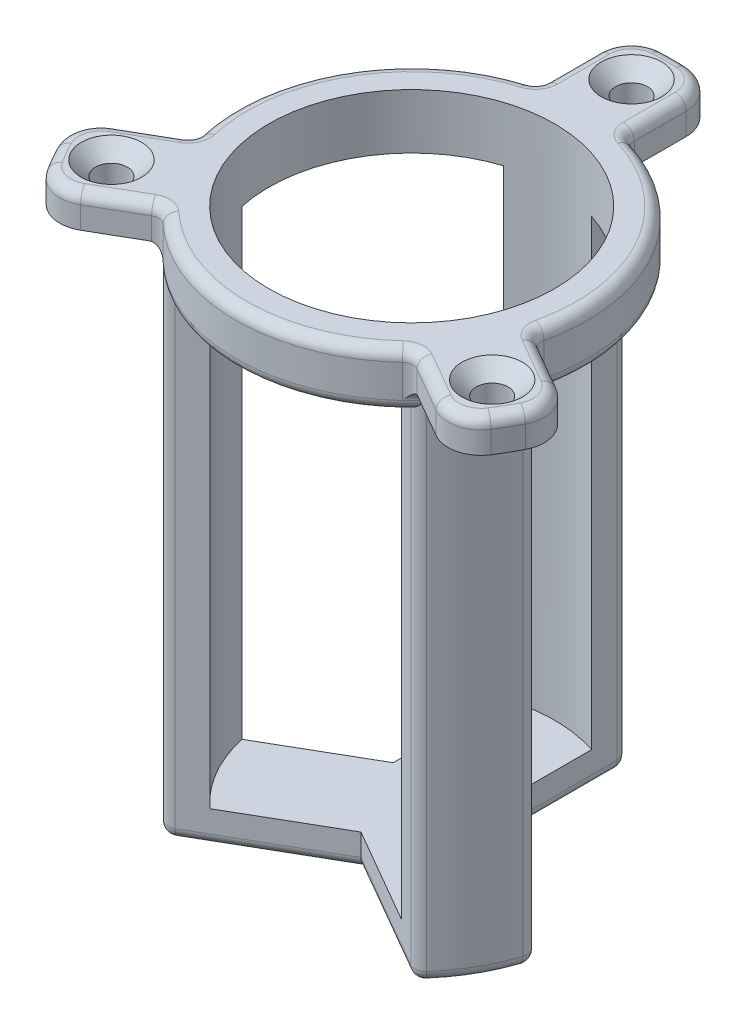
ISO-10303-21;
HEADER;
FILE_DESCRIPTION(('STEP AP214'),'2;1');
FILE_NAME('part.step','',(''),(''),'','','');
FILE_SCHEMA(('AUTOMOTIVE_DESIGN { 1 0 10303 214 1 1 1 1 }'));
ENDSEC;
DATA;
#1=APPLICATION_CONTEXT('core data for automotive mechanical design processes');
#2=APPLICATION_PROTOCOL_DEFINITION('international standard','automotive_design',2000,#1);
#3=PRODUCT_CONTEXT('',#1,'mechanical');
#4=PRODUCT('Part','Part','',(#3));
#5=PRODUCT_RELATED_PRODUCT_CATEGORY('part','',(#4));
#6=PRODUCT_DEFINITION_FORMATION('','',#4);
#7=PRODUCT_DEFINITION_CONTEXT('part definition',#1,'design');
#8=PRODUCT_DEFINITION('design','',#6,#7);
#9=PRODUCT_DEFINITION_SHAPE('','',#8);
#10=(LENGTH_UNIT() NAMED_UNIT(*) SI_UNIT(.MILLI.,.METRE.));
#11=(NAMED_UNIT(*) PLANE_ANGLE_UNIT() SI_UNIT($,.RADIAN.));
#12=(NAMED_UNIT(*) SI_UNIT($,.STERADIAN.) SOLID_ANGLE_UNIT());
#13=UNCERTAINTY_MEASURE_WITH_UNIT(LENGTH_MEASURE(1.E-05),#10,'distance_accuracy_value','');
#14=(GEOMETRIC_REPRESENTATION_CONTEXT(3) GLOBAL_UNCERTAINTY_ASSIGNED_CONTEXT((#13)) GLOBAL_UNIT_ASSIGNED_CONTEXT((#10,
#11,#12)) REPRESENTATION_CONTEXT('',''));
#15=CARTESIAN_POINT('',(0.,0.,0.));
#16=DIRECTION('',(0.,0.,1.));
#17=DIRECTION('',(1.,0.,0.));
#18=AXIS2_PLACEMENT_3D('',#15,#16,#17);
#19=CARTESIAN_POINT('',(0.,3.,0.));
#20=DIRECTION('',(0.,-1.,0.));
#21=DIRECTION('',(0.,0.,-1.));
#22=AXIS2_PLACEMENT_3D('',#19,#20,#21);
#23=CYLINDRICAL_SURFACE('',#22,16.);
#24=CARTESIAN_POINT('',(0.,1.,0.));
#25=DIRECTION('',(0.,-1.,0.));
#26=DIRECTION('',(0.,0.,-1.));
#27=AXIS2_PLACEMENT_3D('',#24,#25,#26);
#28=CIRCLE('',#27,16.);
#29=CARTESIAN_POINT('',(3.2,1.,-15.6767343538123));
#30=VERTEX_POINT('',#29);
#31=CARTESIAN_POINT('',(-3.2,1.,-15.6767343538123));
#32=VERTEX_POINT('',#31);
#33=EDGE_CURVE('E813',#30,#32,#28,.F.);
#34=ORIENTED_EDGE('',*,*,#33,.T.);
#35=DIRECTION('',(0.,-1.,0.));
#36=VECTOR('',#35,1.);
#37=CARTESIAN_POINT('',(-3.2,3.,-15.6767343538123));
#38=LINE('',#37,#36);
#39=CARTESIAN_POINT('',(-3.2,46.,-15.6767343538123));
#40=VERTEX_POINT('',#39);
#41=EDGE_CURVE('E815',#32,#40,#38,.F.);
#42=ORIENTED_EDGE('',*,*,#41,.T.);
#43=CARTESIAN_POINT('',(0.,46.,0.));
#44=DIRECTION('',(0.,-1.,0.));
#45=DIRECTION('',(0.,0.,-1.));
#46=AXIS2_PLACEMENT_3D('',#43,#44,#45);
#47=CIRCLE('',#46,16.);
#48=CARTESIAN_POINT('',(3.2,46.,-15.6767343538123));
#49=VERTEX_POINT('',#48);
#50=EDGE_CURVE('E809',#40,#49,#47,.T.);
#51=ORIENTED_EDGE('',*,*,#50,.T.);
#52=DIRECTION('',(0.,-1.,0.));
#53=VECTOR('',#52,1.);
#54=CARTESIAN_POINT('',(3.2,3.,-15.6767343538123));
#55=LINE('',#54,#53);
#56=EDGE_CURVE('E811',#49,#30,#55,.T.);
#57=ORIENTED_EDGE('',*,*,#56,.T.);
#58=EDGE_LOOP('',(#34,#42,#51,#57));
#59=FACE_BOUND('',#58,.T.);
#60=ADVANCED_FACE('F34',(#59),#23,.T.);
#61=DIRECTION('',(0.,-1.,0.));
#62=VECTOR('',#61,1.);
#63=CARTESIAN_POINT('',(-4.70588235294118,3.,-15.2923075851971));
#64=LINE('',#63,#62);
#65=CARTESIAN_POINT('',(-4.70588235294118,49.,-15.2923075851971));
#66=VERTEX_POINT('',#65);
#67=CARTESIAN_POINT('',(-4.70588235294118,46.,-15.2923075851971));
#68=VERTEX_POINT('',#67);
#69=EDGE_CURVE('E804',#66,#68,#64,.T.);
#70=ORIENTED_EDGE('',*,*,#69,.T.);
#71=CARTESIAN_POINT('',(0.,46.,0.));
#72=DIRECTION('',(0.,1.,0.));
#73=DIRECTION('',(0.,0.,1.));
#74=AXIS2_PLACEMENT_3D('',#71,#72,#73);
#75=CIRCLE('',#74,16.);
#76=CARTESIAN_POINT('',(-15.5964680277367,46.,3.57074012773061));
#77=VERTEX_POINT('',#76);
#78=EDGE_CURVE('E806',#68,#77,#75,.T.);
#79=ORIENTED_EDGE('',*,*,#78,.T.);
#80=DIRECTION('',(0.,-1.,0.));
#81=VECTOR('',#80,1.);
#82=CARTESIAN_POINT('',(-15.5964680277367,3.,3.57074012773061));
#83=LINE('',#82,#81);
#84=CARTESIAN_POINT('',(-15.5964680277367,49.,3.57074012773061));
#85=VERTEX_POINT('',#84);
#86=EDGE_CURVE('E800',#77,#85,#83,.F.);
#87=ORIENTED_EDGE('',*,*,#86,.T.);
#88=CARTESIAN_POINT('',(0.,49.,0.));
#89=DIRECTION('',(0.,1.,0.));
#90=DIRECTION('',(0.,0.,1.));
#91=AXIS2_PLACEMENT_3D('',#88,#89,#90);
#92=CIRCLE('',#91,16.);
#93=EDGE_CURVE('E802',#85,#66,#92,.F.);
#94=ORIENTED_EDGE('',*,*,#93,.T.);
#95=EDGE_LOOP('',(#70,#79,#87,#94));
#96=FACE_BOUND('',#95,.T.);
#97=ADVANCED_FACE('F981',(#96),#23,.T.);
#98=CARTESIAN_POINT('',(0.,1.,0.));
#99=DIRECTION('',(0.,-1.,0.));
#100=DIRECTION('',(0.,0.,-1.));
#101=AXIS2_PLACEMENT_3D('',#98,#99,#100);
#102=CIRCLE('',#101,16.);
#103=CARTESIAN_POINT('',(-15.1764501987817,1.,5.06708588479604));
#104=VERTEX_POINT('',#103);
#105=CARTESIAN_POINT('',(-11.9764501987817,1.,10.6096484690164));
#106=VERTEX_POINT('',#105);
#107=EDGE_CURVE('E795',#104,#106,#102,.F.);
#108=ORIENTED_EDGE('',*,*,#107,.T.);
#109=DIRECTION('',(0.,-1.,0.));
#110=VECTOR('',#109,1.);
#111=CARTESIAN_POINT('',(-11.9764501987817,3.,10.6096484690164));
#112=LINE('',#111,#110);
#113=CARTESIAN_POINT('',(-11.9764501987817,46.,10.6096484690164));
#114=VERTEX_POINT('',#113);
#115=EDGE_CURVE('E797',#106,#114,#112,.F.);
#116=ORIENTED_EDGE('',*,*,#115,.T.);
#117=CARTESIAN_POINT('',(0.,46.,0.));
#118=DIRECTION('',(0.,1.,0.));
#119=DIRECTION('',(0.,0.,1.));
#120=AXIS2_PLACEMENT_3D('',#117,#118,#119);
#121=CIRCLE('',#120,16.);
#122=CARTESIAN_POINT('',(-15.1764501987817,46.,5.06708588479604));
#123=VERTEX_POINT('',#122);
#124=EDGE_CURVE('E791',#114,#123,#121,.F.);
#125=ORIENTED_EDGE('',*,*,#124,.T.);
#126=DIRECTION('',(0.,-1.,0.));
#127=VECTOR('',#126,1.);
#128=CARTESIAN_POINT('',(-15.1764501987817,3.,5.06708588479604));
#129=LINE('',#128,#127);
#130=EDGE_CURVE('E793',#123,#104,#129,.T.);
#131=ORIENTED_EDGE('',*,*,#130,.T.);
#132=EDGE_LOOP('',(#108,#116,#125,#131));
#133=FACE_BOUND('',#132,.T.);
#134=ADVANCED_FACE('F987',(#133),#23,.T.);
#135=DIRECTION('',(0.,-1.,0.));
#136=VECTOR('',#135,1.);
#137=CARTESIAN_POINT('',(-10.8905856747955,3.,11.7215674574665));
#138=LINE('',#137,#136);
#139=CARTESIAN_POINT('',(-10.8905856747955,49.,11.7215674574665));
#140=VERTEX_POINT('',#139);
#141=CARTESIAN_POINT('',(-10.8905856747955,46.,11.7215674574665));
#142=VERTEX_POINT('',#141);
#143=EDGE_CURVE('E786',#140,#142,#138,.T.);
#144=ORIENTED_EDGE('',*,*,#143,.T.);
#145=CARTESIAN_POINT('',(0.,46.,0.));
#146=DIRECTION('',(0.,1.,0.));
#147=DIRECTION('',(0.,0.,1.));
#148=AXIS2_PLACEMENT_3D('',#145,#146,#147);
#149=CIRCLE('',#148,16.);
#150=CARTESIAN_POINT('',(10.8905856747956,46.,11.7215674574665));
#151=VERTEX_POINT('',#150);
#152=EDGE_CURVE('E788',#142,#151,#149,.T.);
#153=ORIENTED_EDGE('',*,*,#152,.T.);
#154=DIRECTION('',(0.,-1.,0.));
#155=VECTOR('',#154,1.);
#156=CARTESIAN_POINT('',(10.8905856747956,3.,11.7215674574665));
#157=LINE('',#156,#155);
#158=CARTESIAN_POINT('',(10.8905856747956,49.,11.7215674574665));
#159=VERTEX_POINT('',#158);
#160=EDGE_CURVE('E782',#151,#159,#157,.F.);
#161=ORIENTED_EDGE('',*,*,#160,.T.);
#162=CARTESIAN_POINT('',(0.,49.,0.));
#163=DIRECTION('',(0.,1.,0.));
#164=DIRECTION('',(0.,0.,1.));
#165=AXIS2_PLACEMENT_3D('',#162,#163,#164);
#166=CIRCLE('',#165,16.);
#167=EDGE_CURVE('E784',#159,#140,#166,.F.);
#168=ORIENTED_EDGE('',*,*,#167,.T.);
#169=EDGE_LOOP('',(#144,#153,#161,#168));
#170=FACE_BOUND('',#169,.T.);
#171=ADVANCED_FACE('F1004',(#170),#23,.T.);
#172=DIRECTION('',(0.,-1.,0.));
#173=VECTOR('',#172,1.);
#174=CARTESIAN_POINT('',(11.9764501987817,3.,10.6096484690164));
#175=LINE('',#174,#173);
#176=CARTESIAN_POINT('',(11.9764501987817,46.,10.6096484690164));
#177=VERTEX_POINT('',#176);
#178=CARTESIAN_POINT('',(11.9764501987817,1.,10.6096484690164));
#179=VERTEX_POINT('',#178);
#180=EDGE_CURVE('E777',#177,#179,#175,.T.);
#181=ORIENTED_EDGE('',*,*,#180,.T.);
#182=CARTESIAN_POINT('',(0.,1.,0.));
#183=DIRECTION('',(0.,-1.,0.));
#184=DIRECTION('',(0.,0.,-1.));
#185=AXIS2_PLACEMENT_3D('',#182,#183,#184);
#186=CIRCLE('',#185,16.);
#187=CARTESIAN_POINT('',(15.1764501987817,1.,5.06708588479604));
#188=VERTEX_POINT('',#187);
#189=EDGE_CURVE('E780',#179,#188,#186,.F.);
#190=ORIENTED_EDGE('',*,*,#189,.T.);
#191=DIRECTION('',(0.,-1.,0.));
#192=VECTOR('',#191,1.);
#193=CARTESIAN_POINT('',(15.1764501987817,3.,5.06708588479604));
#194=LINE('',#193,#192);
#195=CARTESIAN_POINT('',(15.1764501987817,46.,5.06708588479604));
#196=VERTEX_POINT('',#195);
#197=EDGE_CURVE('E775',#188,#196,#194,.F.);
#198=ORIENTED_EDGE('',*,*,#197,.T.);
#199=CARTESIAN_POINT('',(0.,46.,0.));
#200=DIRECTION('',(0.,1.,0.));
#201=DIRECTION('',(0.,0.,1.));
#202=AXIS2_PLACEMENT_3D('',#199,#200,#201);
#203=CIRCLE('',#202,16.);
#204=EDGE_CURVE('E773',#196,#177,#203,.F.);
#205=ORIENTED_EDGE('',*,*,#204,.T.);
#206=EDGE_LOOP('',(#181,#190,#198,#205));
#207=FACE_BOUND('',#206,.T.);
#208=ADVANCED_FACE('F993',(#207),#23,.T.);
#209=CARTESIAN_POINT('',(0.,3.,0.));
#210=DIRECTION('',(0.,-1.,0.));
#211=DIRECTION('',(0.,0.,-1.));
#212=AXIS2_PLACEMENT_3D('',#209,#210,#211);
#213=PLANE('',#212);
#214=CARTESIAN_POINT('',(0.,3.,0.));
#215=DIRECTION('',(0.,-1.,0.));
#216=DIRECTION('',(0.,0.,-1.));
#217=AXIS2_PLACEMENT_3D('',#214,#215,#216);
#218=CIRCLE('',#217,13.);
#219=CARTESIAN_POINT('',(-4.,3.,-12.369316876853));
#220=VERTEX_POINT('',#219);
#221=CARTESIAN_POINT('',(4.,3.,-12.369316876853));
#222=VERTEX_POINT('',#221);
#223=EDGE_CURVE('E554',#220,#222,#218,.T.);
#224=ORIENTED_EDGE('',*,*,#223,.F.);
#225=DIRECTION('',(0.,0.,1.));
#226=VECTOR('',#225,1.);
#227=CARTESIAN_POINT('',(-4.,3.,-2.30940107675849));
#228=LINE('',#227,#226);
#229=CARTESIAN_POINT('',(-4.,3.,-2.30940107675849));
#230=VERTEX_POINT('',#229);
#231=EDGE_CURVE('E600',#220,#230,#228,.T.);
#232=ORIENTED_EDGE('',*,*,#231,.T.);
#233=DIRECTION('',(-0.866025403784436,0.,0.500000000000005));
#234=VECTOR('',#233,1.);
#235=CARTESIAN_POINT('',(-15.4164078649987,3.,4.28186507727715));
#236=LINE('',#235,#234);
#237=CARTESIAN_POINT('',(-12.7121426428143,3.,2.72055682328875));
#238=VERTEX_POINT('',#237);
#239=EDGE_CURVE('E602',#230,#238,#236,.T.);
#240=ORIENTED_EDGE('',*,*,#239,.T.);
#241=CARTESIAN_POINT('',(0.,3.,0.));
#242=DIRECTION('',(0.,-1.,0.));
#243=DIRECTION('',(0.,0.,-1.));
#244=AXIS2_PLACEMENT_3D('',#241,#242,#243);
#245=CIRCLE('',#244,13.);
#246=CARTESIAN_POINT('',(-8.71214264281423,3.,9.64876005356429));
#247=VERTEX_POINT('',#246);
#248=EDGE_CURVE('E586',#247,#238,#245,.T.);
#249=ORIENTED_EDGE('',*,*,#248,.F.);
#250=DIRECTION('',(0.866025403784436,0.,-0.500000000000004));
#251=VECTOR('',#250,1.);
#252=CARTESIAN_POINT('',(-11.4164078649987,3.,11.2100683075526));
#253=LINE('',#252,#251);
#254=CARTESIAN_POINT('',(0.,3.,4.61880215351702));
#255=VERTEX_POINT('',#254);
#256=EDGE_CURVE('E604',#247,#255,#253,.T.);
#257=ORIENTED_EDGE('',*,*,#256,.T.);
#258=DIRECTION('',(0.866025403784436,0.,0.500000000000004));
#259=VECTOR('',#258,1.);
#260=CARTESIAN_POINT('',(0.,3.,4.61880215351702));
#261=LINE('',#260,#259);
#262=CARTESIAN_POINT('',(8.71214264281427,3.,9.64876005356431));
#263=VERTEX_POINT('',#262);
#264=EDGE_CURVE('E606',#255,#263,#261,.T.);
#265=ORIENTED_EDGE('',*,*,#264,.T.);
#266=CARTESIAN_POINT('',(0.,3.,0.));
#267=DIRECTION('',(0.,-1.,0.));
#268=DIRECTION('',(0.,0.,-1.));
#269=AXIS2_PLACEMENT_3D('',#266,#267,#268);
#270=CIRCLE('',#269,13.);
#271=CARTESIAN_POINT('',(12.7121426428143,3.,2.72055682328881));
#272=VERTEX_POINT('',#271);
#273=EDGE_CURVE('E572',#272,#263,#270,.T.);
#274=ORIENTED_EDGE('',*,*,#273,.F.);
#275=DIRECTION('',(-0.866025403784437,0.,-0.500000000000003));
#276=VECTOR('',#275,1.);
#277=CARTESIAN_POINT('',(4.,3.,-2.30940107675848));
#278=LINE('',#277,#276);
#279=CARTESIAN_POINT('',(4.,3.,-2.30940107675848));
#280=VERTEX_POINT('',#279);
#281=EDGE_CURVE('E608',#272,#280,#278,.T.);
#282=ORIENTED_EDGE('',*,*,#281,.T.);
#283=DIRECTION('',(0.,0.,-1.));
#284=VECTOR('',#283,1.);
#285=CARTESIAN_POINT('',(4.,3.,-15.4919333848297));
#286=LINE('',#285,#284);
#287=EDGE_CURVE('E610',#280,#222,#286,.T.);
#288=ORIENTED_EDGE('',*,*,#287,.T.);
#289=EDGE_LOOP('',(#224,#232,#240,#249,#257,#265,#274,#282,#288));
#290=FACE_BOUND('',#289,.T.);
#291=ADVANCED_FACE('F1003',(#290),#213,.F.);
#292=CARTESIAN_POINT('',(-4.,3.,-2.30940107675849));
#293=DIRECTION('',(1.,0.,0.));
#294=DIRECTION('',(0.,0.,-1.));
#295=AXIS2_PLACEMENT_3D('',#292,#293,#294);
#296=PLANE('',#295);
#297=DIRECTION('',(0.,-1.,0.));
#298=VECTOR('',#297,1.);
#299=CARTESIAN_POINT('',(-4.,3.,-14.6969384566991));
#300=LINE('',#299,#298);
#301=CARTESIAN_POINT('',(-4.,45.0271760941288,-14.6969384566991));
#302=VERTEX_POINT('',#301);
#303=CARTESIAN_POINT('',(-4.,1.,-14.6969384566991));
#304=VERTEX_POINT('',#303);
#305=EDGE_CURVE('E718',#302,#304,#300,.T.);
#306=ORIENTED_EDGE('',*,*,#305,.T.);
#307=DIRECTION('',(0.,0.,1.));
#308=VECTOR('',#307,1.);
#309=CARTESIAN_POINT('',(-4.,1.,-2.30940107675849));
#310=LINE('',#309,#308);
#311=CARTESIAN_POINT('',(-4.,1.,-2.30940107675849));
#312=VERTEX_POINT('',#311);
#313=EDGE_CURVE('E720',#304,#312,#310,.T.);
#314=ORIENTED_EDGE('',*,*,#313,.T.);
#315=DIRECTION('',(0.,-1.,0.));
#316=VECTOR('',#315,1.);
#317=CARTESIAN_POINT('',(-4.,3.,-2.30940107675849));
#318=LINE('',#317,#316);
#319=EDGE_CURVE('E618',#230,#312,#318,.T.);
#320=ORIENTED_EDGE('',*,*,#319,.F.);
#321=ORIENTED_EDGE('',*,*,#231,.F.);
#322=DIRECTION('',(0.,-1.,0.));
#323=VECTOR('',#322,1.);
#324=CARTESIAN_POINT('',(-4.,45.,-12.369316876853));
#325=LINE('',#324,#323);
#326=CARTESIAN_POINT('',(-4.,45.,-12.369316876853));
#327=VERTEX_POINT('',#326);
#328=EDGE_CURVE('E564',#327,#220,#325,.T.);
#329=ORIENTED_EDGE('',*,*,#328,.F.);
#330=DIRECTION('',(0.,0.,1.));
#331=VECTOR('',#330,1.);
#332=CARTESIAN_POINT('',(-4.,45.,-15.4919333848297));
#333=LINE('',#332,#331);
#334=CARTESIAN_POINT('',(-4.,45.,-14.456832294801));
#335=VERTEX_POINT('',#334);
#336=EDGE_CURVE('E562',#335,#327,#333,.T.);
#337=ORIENTED_EDGE('',*,*,#336,.F.);
#338=CARTESIAN_POINT('',(-4.,45.,-14.456832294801));
#339=CARTESIAN_POINT('',(-4.,45.0000086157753,-14.4973615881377));
#340=CARTESIAN_POINT('',(-4.,45.0022775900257,-14.5376350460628));
#341=CARTESIAN_POINT('',(-4.,45.0113362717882,-14.6176704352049));
#342=CARTESIAN_POINT('',(-4.,45.0181259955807,-14.6574323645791));
#343=CARTESIAN_POINT('',(-4.,45.0271760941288,-14.6969384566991));
#344=B_SPLINE_CURVE_WITH_KNOTS('',3,(#338,#339,#340,#341,#342,#343),.UNSPECIFIED.,.F.,.F.,(4,2,
4),(0.,0.121011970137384,0.242024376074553),.UNSPECIFIED.);
#345=EDGE_CURVE('E1178',#335,#302,#344,.T.);
#346=ORIENTED_EDGE('',*,*,#345,.T.);
#347=EDGE_LOOP('',(#306,#314,#320,#321,#329,#337,#346));
#348=FACE_BOUND('',#347,.T.);
#349=ADVANCED_FACE('F1010',(#348),#296,.F.);
#350=CARTESIAN_POINT('',(-15.4164078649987,3.,4.28186507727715));
#351=DIRECTION('',(0.500000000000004,0.,0.866025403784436));
#352=DIRECTION('',(0.866025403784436,0.,-0.500000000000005));
#353=AXIS2_PLACEMENT_3D('',#350,#351,#352);
#354=PLANE('',#353);
#355=ORIENTED_EDGE('',*,*,#319,.T.);
#356=DIRECTION('',(-0.866025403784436,0.,0.500000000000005));
#357=VECTOR('',#356,1.);
#358=CARTESIAN_POINT('',(-15.4164078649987,1.,4.28186507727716));
#359=LINE('',#358,#357);
#360=CARTESIAN_POINT('',(-14.7279220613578,1.,3.88436761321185));
#361=VERTEX_POINT('',#360);
#362=EDGE_CURVE('E744',#312,#361,#359,.T.);
#363=ORIENTED_EDGE('',*,*,#362,.T.);
#364=DIRECTION('',(0.,-1.,0.));
#365=VECTOR('',#364,1.);
#366=CARTESIAN_POINT('',(-14.7279220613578,3.,3.88436761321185));
#367=LINE('',#366,#365);
#368=CARTESIAN_POINT('',(-14.7279220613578,45.0271760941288,3.88436761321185));
#369=VERTEX_POINT('',#368);
#370=EDGE_CURVE('E742',#361,#369,#367,.F.);
#371=ORIENTED_EDGE('',*,*,#370,.T.);
#372=CARTESIAN_POINT('',(-14.7279220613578,45.0271760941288,3.88436761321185));
#373=CARTESIAN_POINT('',(-14.6937087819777,45.0181259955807,3.86461456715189));
#374=CARTESIAN_POINT('',(-14.6592739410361,45.0113362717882,3.84473360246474));
#375=CARTESIAN_POINT('',(-14.5899612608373,45.0022775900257,3.80471590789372));
#376=CARTESIAN_POINT('',(-14.555083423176,45.0000086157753,3.78457917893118));
#377=CARTESIAN_POINT('',(-14.5199840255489,45.,3.76431453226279));
#378=B_SPLINE_CURVE_WITH_KNOTS('',3,(#372,#373,#374,#375,#376,#377),.UNSPECIFIED.,.F.,.F.,(4,2,
4),(0.,0.121012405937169,0.242024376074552),.UNSPECIFIED.);
#379=CARTESIAN_POINT('',(-14.5199840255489,45.,3.76431453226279));
#380=VERTEX_POINT('',#379);
#381=EDGE_CURVE('E1242',#369,#380,#378,.T.);
#382=ORIENTED_EDGE('',*,*,#381,.T.);
#383=DIRECTION('',(-0.866025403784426,0.,0.500000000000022));
#384=VECTOR('',#383,1.);
#385=CARTESIAN_POINT('',(-15.4164078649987,45.,4.28186507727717));
#386=LINE('',#385,#384);
#387=CARTESIAN_POINT('',(-12.7121426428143,45.,2.72055682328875));
#388=VERTEX_POINT('',#387);
#389=EDGE_CURVE('E589',#388,#380,#386,.T.);
#390=ORIENTED_EDGE('',*,*,#389,.F.);
#391=DIRECTION('',(0.,-1.,0.));
#392=VECTOR('',#391,1.);
#393=CARTESIAN_POINT('',(-12.7121426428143,45.,2.72055682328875));
#394=LINE('',#393,#392);
#395=EDGE_CURVE('E592',#388,#238,#394,.T.);
#396=ORIENTED_EDGE('',*,*,#395,.T.);
#397=ORIENTED_EDGE('',*,*,#239,.F.);
#398=EDGE_LOOP('',(#355,#363,#371,#382,#390,#396,#397));
#399=FACE_BOUND('',#398,.T.);
#400=ADVANCED_FACE('F1248',(#399),#354,.F.);
#401=CARTESIAN_POINT('',(-11.4164078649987,3.,11.2100683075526));
#402=DIRECTION('',(-0.500000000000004,0.,-0.866025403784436));
#403=DIRECTION('',(-0.866025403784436,0.,0.500000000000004));
#404=AXIS2_PLACEMENT_3D('',#401,#402,#403);
#405=PLANE('',#404);
#406=DIRECTION('',(0.,-1.,0.));
#407=VECTOR('',#406,1.);
#408=CARTESIAN_POINT('',(-10.7279220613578,3.,10.8125708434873));
#409=LINE('',#408,#407);
#410=CARTESIAN_POINT('',(-10.7279220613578,45.0271760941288,10.8125708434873));
#411=VERTEX_POINT('',#410);
#412=CARTESIAN_POINT('',(-10.7279220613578,1.,10.8125708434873));
#413=VERTEX_POINT('',#412);
#414=EDGE_CURVE('E746',#411,#413,#409,.T.);
#415=ORIENTED_EDGE('',*,*,#414,.T.);
#416=DIRECTION('',(0.866025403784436,0.,-0.500000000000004));
#417=VECTOR('',#416,1.);
#418=CARTESIAN_POINT('',(0.,1.,4.61880215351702));
#419=LINE('',#418,#417);
#420=CARTESIAN_POINT('',(0.,1.,4.61880215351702));
#421=VERTEX_POINT('',#420);
#422=EDGE_CURVE('E748',#413,#421,#419,.T.);
#423=ORIENTED_EDGE('',*,*,#422,.T.);
#424=DIRECTION('',(0.,-1.,0.));
#425=VECTOR('',#424,1.);
#426=CARTESIAN_POINT('',(0.,3.,4.61880215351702));
#427=LINE('',#426,#425);
#428=EDGE_CURVE('E615',#255,#421,#427,.T.);
#429=ORIENTED_EDGE('',*,*,#428,.F.);
#430=ORIENTED_EDGE('',*,*,#256,.F.);
#431=DIRECTION('',(0.,-1.,0.));
#432=VECTOR('',#431,1.);
#433=CARTESIAN_POINT('',(-8.71214264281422,45.,9.6487600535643));
#434=LINE('',#433,#432);
#435=CARTESIAN_POINT('',(-8.71214264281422,45.,9.6487600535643));
#436=VERTEX_POINT('',#435);
#437=EDGE_CURVE('E597',#436,#247,#434,.T.);
#438=ORIENTED_EDGE('',*,*,#437,.F.);
#439=DIRECTION('',(0.866025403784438,0.,-0.5));
#440=VECTOR('',#439,1.);
#441=CARTESIAN_POINT('',(-8.71214264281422,45.,9.6487600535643));
#442=LINE('',#441,#440);
#443=CARTESIAN_POINT('',(-10.5199840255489,45.,10.6925177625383));
#444=VERTEX_POINT('',#443);
#445=EDGE_CURVE('E587',#444,#436,#442,.T.);
#446=ORIENTED_EDGE('',*,*,#445,.F.);
#447=CARTESIAN_POINT('',(-10.5199840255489,45.,10.6925177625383));
#448=CARTESIAN_POINT('',(-10.5550834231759,45.0000086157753,10.7127824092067));
#449=CARTESIAN_POINT('',(-10.5899612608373,45.0022775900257,10.7329191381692));
#450=CARTESIAN_POINT('',(-10.6592739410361,45.0113362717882,10.7729368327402));
#451=CARTESIAN_POINT('',(-10.6937087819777,45.0181259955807,10.7928177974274));
#452=CARTESIAN_POINT('',(-10.7279220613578,45.0271760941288,10.8125708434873));
#453=B_SPLINE_CURVE_WITH_KNOTS('',3,(#447,#448,#449,#450,#451,#452),.UNSPECIFIED.,.F.,.F.,(4,2,
4),(0.,0.121011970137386,0.242024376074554),.UNSPECIFIED.);
#454=EDGE_CURVE('E838',#444,#411,#453,.T.);
#455=ORIENTED_EDGE('',*,*,#454,.T.);
#456=EDGE_LOOP('',(#415,#423,#429,#430,#438,#446,#455));
#457=FACE_BOUND('',#456,.T.);
#458=ADVANCED_FACE('F1000',(#457),#405,.F.);
#459=CARTESIAN_POINT('',(0.,3.,4.61880215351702));
#460=DIRECTION('',(0.500000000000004,0.,-0.866025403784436));
#461=DIRECTION('',(-0.866025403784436,0.,-0.500000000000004));
#462=AXIS2_PLACEMENT_3D('',#459,#460,#461);
#463=PLANE('',#462);
#464=ORIENTED_EDGE('',*,*,#428,.T.);
#465=DIRECTION('',(0.866025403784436,0.,0.500000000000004));
#466=VECTOR('',#465,1.);
#467=CARTESIAN_POINT('',(11.4164078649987,1.,11.2100683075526));
#468=LINE('',#467,#466);
#469=CARTESIAN_POINT('',(10.7279220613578,1.,10.8125708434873));
#470=VERTEX_POINT('',#469);
#471=EDGE_CURVE('E753',#421,#470,#468,.T.);
#472=ORIENTED_EDGE('',*,*,#471,.T.);
#473=DIRECTION('',(0.,-1.,0.));
#474=VECTOR('',#473,1.);
#475=CARTESIAN_POINT('',(10.7279220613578,3.,10.8125708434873));
#476=LINE('',#475,#474);
#477=CARTESIAN_POINT('',(10.7279220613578,45.0271760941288,10.8125708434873));
#478=VERTEX_POINT('',#477);
#479=EDGE_CURVE('E751',#470,#478,#476,.F.);
#480=ORIENTED_EDGE('',*,*,#479,.T.);
#481=CARTESIAN_POINT('',(10.7279220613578,45.0271760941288,10.8125708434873));
#482=CARTESIAN_POINT('',(10.6937087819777,45.0181259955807,10.7928177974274));
#483=CARTESIAN_POINT('',(10.6592739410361,45.0113362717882,10.7729368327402));
#484=CARTESIAN_POINT('',(10.5899612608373,45.0022775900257,10.7329191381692));
#485=CARTESIAN_POINT('',(10.5550834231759,45.0000086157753,10.7127824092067));
#486=CARTESIAN_POINT('',(10.5199840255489,45.,10.6925177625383));
#487=B_SPLINE_CURVE_WITH_KNOTS('',3,(#481,#482,#483,#484,#485,#486),.UNSPECIFIED.,.F.,.F.,(4,2,
4),(0.,0.121012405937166,0.242024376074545),.UNSPECIFIED.);
#488=CARTESIAN_POINT('',(10.5199840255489,45.,10.6925177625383));
#489=VERTEX_POINT('',#488);
#490=EDGE_CURVE('E830',#478,#489,#487,.T.);
#491=ORIENTED_EDGE('',*,*,#490,.T.);
#492=DIRECTION('',(0.866025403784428,0.,0.500000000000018));
#493=VECTOR('',#492,1.);
#494=CARTESIAN_POINT('',(11.4164078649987,45.,11.2100683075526));
#495=LINE('',#494,#493);
#496=CARTESIAN_POINT('',(8.71214264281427,45.,9.64876005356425));
#497=VERTEX_POINT('',#496);
#498=EDGE_CURVE('E575',#497,#489,#495,.T.);
#499=ORIENTED_EDGE('',*,*,#498,.F.);
#500=DIRECTION('',(0.,-1.,0.));
#501=VECTOR('',#500,1.);
#502=CARTESIAN_POINT('',(8.71214264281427,45.,9.64876005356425));
#503=LINE('',#502,#501);
#504=EDGE_CURVE('E578',#497,#263,#503,.T.);
#505=ORIENTED_EDGE('',*,*,#504,.T.);
#506=ORIENTED_EDGE('',*,*,#264,.F.);
#507=EDGE_LOOP('',(#464,#472,#480,#491,#499,#505,#506));
#508=FACE_BOUND('',#507,.T.);
#509=ADVANCED_FACE('F845',(#508),#463,.F.);
#510=DIRECTION('',(0.,-1.,0.));
#511=VECTOR('',#510,1.);
#512=CARTESIAN_POINT('',(15.5964680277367,3.,3.57074012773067));
#513=LINE('',#512,#511);
#514=CARTESIAN_POINT('',(15.5964680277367,49.,3.57074012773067));
#515=VERTEX_POINT('',#514);
#516=CARTESIAN_POINT('',(15.5964680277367,46.,3.57074012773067));
#517=VERTEX_POINT('',#516);
#518=EDGE_CURVE('E766',#515,#517,#513,.T.);
#519=ORIENTED_EDGE('',*,*,#518,.T.);
#520=CARTESIAN_POINT('',(0.,46.,0.));
#521=DIRECTION('',(0.,1.,0.));
#522=DIRECTION('',(0.,0.,1.));
#523=AXIS2_PLACEMENT_3D('',#520,#521,#522);
#524=CIRCLE('',#523,16.);
#525=CARTESIAN_POINT('',(4.70588235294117,46.,-15.2923075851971));
#526=VERTEX_POINT('',#525);
#527=EDGE_CURVE('E770',#517,#526,#524,.T.);
#528=ORIENTED_EDGE('',*,*,#527,.T.);
#529=DIRECTION('',(0.,-1.,0.));
#530=VECTOR('',#529,1.);
#531=CARTESIAN_POINT('',(4.70588235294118,3.,-15.2923075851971));
#532=LINE('',#531,#530);
#533=CARTESIAN_POINT('',(4.70588235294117,49.,-15.2923075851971));
#534=VERTEX_POINT('',#533);
#535=EDGE_CURVE('E768',#526,#534,#532,.F.);
#536=ORIENTED_EDGE('',*,*,#535,.T.);
#537=CARTESIAN_POINT('',(0.,49.,0.));
#538=DIRECTION('',(0.,1.,0.));
#539=DIRECTION('',(0.,0.,1.));
#540=AXIS2_PLACEMENT_3D('',#537,#538,#539);
#541=CIRCLE('',#540,16.);
#542=EDGE_CURVE('E764',#534,#515,#541,.F.);
#543=ORIENTED_EDGE('',*,*,#542,.T.);
#544=EDGE_LOOP('',(#519,#528,#536,#543));
#545=FACE_BOUND('',#544,.T.);
#546=ADVANCED_FACE('F983',(#545),#23,.T.);
#547=CARTESIAN_POINT('',(4.,3.,-2.30940107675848));
#548=DIRECTION('',(-0.500000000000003,0.,0.866025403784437));
#549=DIRECTION('',(0.866025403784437,0.,0.500000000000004));
#550=AXIS2_PLACEMENT_3D('',#547,#548,#549);
#551=PLANE('',#550);
#552=DIRECTION('',(0.,-1.,0.));
#553=VECTOR('',#552,1.);
#554=CARTESIAN_POINT('',(14.7279220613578,3.,3.88436761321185));
#555=LINE('',#554,#553);
#556=CARTESIAN_POINT('',(14.7279220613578,45.0271760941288,3.88436761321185));
#557=VERTEX_POINT('',#556);
#558=CARTESIAN_POINT('',(14.7279220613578,1.,3.88436761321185));
#559=VERTEX_POINT('',#558);
#560=EDGE_CURVE('E755',#557,#559,#555,.T.);
#561=ORIENTED_EDGE('',*,*,#560,.T.);
#562=DIRECTION('',(-0.866025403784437,0.,-0.500000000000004));
#563=VECTOR('',#562,1.);
#564=CARTESIAN_POINT('',(4.,1.,-2.30940107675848));
#565=LINE('',#564,#563);
#566=CARTESIAN_POINT('',(4.,1.,-2.30940107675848));
#567=VERTEX_POINT('',#566);
#568=EDGE_CURVE('E757',#559,#567,#565,.T.);
#569=ORIENTED_EDGE('',*,*,#568,.T.);
#570=DIRECTION('',(0.,-1.,0.));
#571=VECTOR('',#570,1.);
#572=CARTESIAN_POINT('',(4.,3.,-2.30940107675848));
#573=LINE('',#572,#571);
#574=EDGE_CURVE('E612',#280,#567,#573,.T.);
#575=ORIENTED_EDGE('',*,*,#574,.F.);
#576=ORIENTED_EDGE('',*,*,#281,.F.);
#577=DIRECTION('',(0.,-1.,0.));
#578=VECTOR('',#577,1.);
#579=CARTESIAN_POINT('',(12.7121426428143,45.,2.72055682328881));
#580=LINE('',#579,#578);
#581=CARTESIAN_POINT('',(12.7121426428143,45.,2.72055682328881));
#582=VERTEX_POINT('',#581);
#583=EDGE_CURVE('E583',#582,#272,#580,.T.);
#584=ORIENTED_EDGE('',*,*,#583,.F.);
#585=DIRECTION('',(-0.866025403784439,0.,-0.5));
#586=VECTOR('',#585,1.);
#587=CARTESIAN_POINT('',(12.7121426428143,45.,2.72055682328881));
#588=LINE('',#587,#586);
#589=CARTESIAN_POINT('',(14.5199840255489,45.,3.7643145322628));
#590=VERTEX_POINT('',#589);
#591=EDGE_CURVE('E573',#590,#582,#588,.T.);
#592=ORIENTED_EDGE('',*,*,#591,.F.);
#593=CARTESIAN_POINT('',(14.5199840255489,45.,3.7643145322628));
#594=CARTESIAN_POINT('',(14.555083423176,45.0000086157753,3.78457917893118));
#595=CARTESIAN_POINT('',(14.5899612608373,45.0022775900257,3.80471590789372));
#596=CARTESIAN_POINT('',(14.6592739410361,45.0113362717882,3.84473360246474));
#597=CARTESIAN_POINT('',(14.6937087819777,45.0181259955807,3.86461456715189));
#598=CARTESIAN_POINT('',(14.7279220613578,45.0271760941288,3.88436761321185));
#599=B_SPLINE_CURVE_WITH_KNOTS('',3,(#593,#594,#595,#596,#597,#598),.UNSPECIFIED.,.F.,.F.,(4,2,
4),(0.,0.121011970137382,0.242024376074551),.UNSPECIFIED.);
#600=EDGE_CURVE('E1177',#590,#557,#599,.T.);
#601=ORIENTED_EDGE('',*,*,#600,.T.);
#602=EDGE_LOOP('',(#561,#569,#575,#576,#584,#592,#601));
#603=FACE_BOUND('',#602,.T.);
#604=ADVANCED_FACE('F991',(#603),#551,.F.);
#605=CARTESIAN_POINT('',(4.,3.,-15.4919333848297));
#606=DIRECTION('',(-1.,0.,0.));
#607=DIRECTION('',(0.,0.,1.));
#608=AXIS2_PLACEMENT_3D('',#605,#606,#607);
#609=PLANE('',#608);
#610=ORIENTED_EDGE('',*,*,#574,.T.);
#611=DIRECTION('',(0.,0.,-1.));
#612=VECTOR('',#611,1.);
#613=CARTESIAN_POINT('',(4.,1.,-15.4919333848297));
#614=LINE('',#613,#612);
#615=CARTESIAN_POINT('',(4.,1.,-14.6969384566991));
#616=VERTEX_POINT('',#615);
#617=EDGE_CURVE('E762',#567,#616,#614,.T.);
#618=ORIENTED_EDGE('',*,*,#617,.T.);
#619=DIRECTION('',(0.,-1.,0.));
#620=VECTOR('',#619,1.);
#621=CARTESIAN_POINT('',(4.,3.,-14.6969384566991));
#622=LINE('',#621,#620);
#623=CARTESIAN_POINT('',(4.,45.0271760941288,-14.6969384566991));
#624=VERTEX_POINT('',#623);
#625=EDGE_CURVE('E760',#616,#624,#622,.F.);
#626=ORIENTED_EDGE('',*,*,#625,.T.);
#627=CARTESIAN_POINT('',(4.,45.0271760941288,-14.6969384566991));
#628=CARTESIAN_POINT('',(4.,45.0181259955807,-14.6574323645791));
#629=CARTESIAN_POINT('',(4.,45.0113362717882,-14.6176704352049));
#630=CARTESIAN_POINT('',(4.,45.0022775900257,-14.5376350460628));
#631=CARTESIAN_POINT('',(4.,45.0000086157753,-14.4973615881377));
#632=CARTESIAN_POINT('',(4.,45.,-14.456832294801));
#633=B_SPLINE_CURVE_WITH_KNOTS('',3,(#627,#628,#629,#630,#631,#632),.UNSPECIFIED.,.F.,.F.,(4,2,
4),(0.,0.121012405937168,0.242024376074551),.UNSPECIFIED.);
#634=CARTESIAN_POINT('',(4.,45.,-14.456832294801));
#635=VERTEX_POINT('',#634);
#636=EDGE_CURVE('E1169',#624,#635,#633,.T.);
#637=ORIENTED_EDGE('',*,*,#636,.T.);
#638=DIRECTION('',(0.,0.,-1.));
#639=VECTOR('',#638,1.);
#640=CARTESIAN_POINT('',(4.,45.,-15.4919333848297));
#641=LINE('',#640,#639);
#642=CARTESIAN_POINT('',(4.,45.,-12.369316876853));
#643=VERTEX_POINT('',#642);
#644=EDGE_CURVE('E559',#643,#635,#641,.T.);
#645=ORIENTED_EDGE('',*,*,#644,.F.);
#646=DIRECTION('',(0.,-1.,0.));
#647=VECTOR('',#646,1.);
#648=CARTESIAN_POINT('',(4.,45.,-12.369316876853));
#649=LINE('',#648,#647);
#650=EDGE_CURVE('E569',#643,#222,#649,.T.);
#651=ORIENTED_EDGE('',*,*,#650,.T.);
#652=ORIENTED_EDGE('',*,*,#287,.F.);
#653=EDGE_LOOP('',(#610,#618,#626,#637,#645,#651,#652));
#654=FACE_BOUND('',#653,.T.);
#655=ADVANCED_FACE('F998',(#654),#609,.F.);
#656=CARTESIAN_POINT('',(0.,0.,0.));
#657=DIRECTION('',(0.,-1.,0.));
#658=DIRECTION('',(0.,0.,-1.));
#659=AXIS2_PLACEMENT_3D('',#656,#657,#658);
#660=PLANE('',#659);
#661=DIRECTION('',(0.,0.,1.));
#662=VECTOR('',#661,1.);
#663=CARTESIAN_POINT('',(-3.,0.,-15.4919333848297));
#664=LINE('',#663,#662);
#665=CARTESIAN_POINT('',(-3.,0.,-1.73205080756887));
#666=VERTEX_POINT('',#665);
#667=CARTESIAN_POINT('',(-3.,0.,-14.6969384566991));
#668=VERTEX_POINT('',#667);
#669=EDGE_CURVE('E737',#666,#668,#664,.F.);
#670=ORIENTED_EDGE('',*,*,#669,.T.);
#671=CARTESIAN_POINT('',(0.,0.,0.));
#672=DIRECTION('',(0.,-1.,0.));
#673=DIRECTION('',(0.,0.,-1.));
#674=AXIS2_PLACEMENT_3D('',#671,#672,#673);
#675=CIRCLE('',#674,15.);
#676=CARTESIAN_POINT('',(3.,0.,-14.6969384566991));
#677=VERTEX_POINT('',#676);
#678=EDGE_CURVE('E740',#668,#677,#675,.T.);
#679=ORIENTED_EDGE('',*,*,#678,.T.);
#680=DIRECTION('',(0.,0.,-1.));
#681=VECTOR('',#680,1.);
#682=CARTESIAN_POINT('',(3.,0.,-2.30940107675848));
#683=LINE('',#682,#681);
#684=CARTESIAN_POINT('',(3.,0.,-1.73205080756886));
#685=VERTEX_POINT('',#684);
#686=EDGE_CURVE('E733',#677,#685,#683,.F.);
#687=ORIENTED_EDGE('',*,*,#686,.T.);
#688=DIRECTION('',(-0.866025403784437,0.,-0.500000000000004));
#689=VECTOR('',#688,1.);
#690=CARTESIAN_POINT('',(14.9164078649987,0.,5.14789048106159));
#691=LINE('',#690,#689);
#692=CARTESIAN_POINT('',(14.2279220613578,0.,4.75039301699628));
#693=VERTEX_POINT('',#692);
#694=EDGE_CURVE('E725',#685,#693,#691,.F.);
#695=ORIENTED_EDGE('',*,*,#694,.T.);
#696=CARTESIAN_POINT('',(0.,0.,0.));
#697=DIRECTION('',(0.,-1.,0.));
#698=DIRECTION('',(0.,0.,-1.));
#699=AXIS2_PLACEMENT_3D('',#696,#697,#698);
#700=CIRCLE('',#699,15.);
#701=CARTESIAN_POINT('',(11.2279220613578,0.,9.94654543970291));
#702=VERTEX_POINT('',#701);
#703=EDGE_CURVE('E723',#693,#702,#700,.T.);
#704=ORIENTED_EDGE('',*,*,#703,.T.);
#705=DIRECTION('',(0.866025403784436,0.,0.500000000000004));
#706=VECTOR('',#705,1.);
#707=CARTESIAN_POINT('',(0.500000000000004,0.,3.75277674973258));
#708=LINE('',#707,#706);
#709=CARTESIAN_POINT('',(0.,0.,3.46410161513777));
#710=VERTEX_POINT('',#709);
#711=EDGE_CURVE('E727',#702,#710,#708,.F.);
#712=ORIENTED_EDGE('',*,*,#711,.T.);
#713=DIRECTION('',(0.866025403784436,0.,-0.500000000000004));
#714=VECTOR('',#713,1.);
#715=CARTESIAN_POINT('',(-11.9164078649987,0.,10.3440429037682));
#716=LINE('',#715,#714);
#717=CARTESIAN_POINT('',(-11.2279220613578,0.,9.94654543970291));
#718=VERTEX_POINT('',#717);
#719=EDGE_CURVE('E729',#710,#718,#716,.F.);
#720=ORIENTED_EDGE('',*,*,#719,.T.);
#721=CARTESIAN_POINT('',(0.,0.,0.));
#722=DIRECTION('',(0.,-1.,0.));
#723=DIRECTION('',(0.,0.,-1.));
#724=AXIS2_PLACEMENT_3D('',#721,#722,#723);
#725=CIRCLE('',#724,15.);
#726=CARTESIAN_POINT('',(-14.2279220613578,0.,4.75039301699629));
#727=VERTEX_POINT('',#726);
#728=EDGE_CURVE('E731',#718,#727,#725,.T.);
#729=ORIENTED_EDGE('',*,*,#728,.T.);
#730=DIRECTION('',(-0.866025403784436,0.,0.500000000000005));
#731=VECTOR('',#730,1.);
#732=CARTESIAN_POINT('',(-3.49999999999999,0.,-1.44337567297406));
#733=LINE('',#732,#731);
#734=EDGE_CURVE('E735',#727,#666,#733,.F.);
#735=ORIENTED_EDGE('',*,*,#734,.T.);
#736=EDGE_LOOP('',(#670,#679,#687,#695,#704,#712,#720,#729,#735));
#737=FACE_BOUND('',#736,.T.);
#738=ADVANCED_FACE('F1158',(#737),#660,.T.);
#739=CARTESIAN_POINT('',(0.,45.,0.));
#740=DIRECTION('',(0.,-1.,0.));
#741=DIRECTION('',(0.,0.,-1.));
#742=AXIS2_PLACEMENT_3D('',#739,#740,#741);
#743=CYLINDRICAL_SURFACE('',#742,13.);
#744=CARTESIAN_POINT('',(0.,50.,0.));
#745=DIRECTION('',(0.,1.,0.));
#746=DIRECTION('',(0.,0.,1.));
#747=AXIS2_PLACEMENT_3D('',#744,#745,#746);
#748=CIRCLE('',#747,13.);
#749=CARTESIAN_POINT('',(0.,50.,13.));
#750=VERTEX_POINT('',#749);
#751=EDGE_CURVE('E551',#750,#750,#748,.T.);
#752=ORIENTED_EDGE('',*,*,#751,.T.);
#753=EDGE_LOOP('',(#752));
#754=FACE_BOUND('',#753,.T.);
#755=ORIENTED_EDGE('',*,*,#248,.T.);
#756=ORIENTED_EDGE('',*,*,#395,.F.);
#757=CARTESIAN_POINT('',(0.,45.,0.));
#758=DIRECTION('',(0.,1.,0.));
#759=DIRECTION('',(0.,0.,1.));
#760=AXIS2_PLACEMENT_3D('',#757,#758,#759);
#761=CIRCLE('',#760,13.);
#762=EDGE_CURVE('E558',#327,#388,#761,.T.);
#763=ORIENTED_EDGE('',*,*,#762,.F.);
#764=ORIENTED_EDGE('',*,*,#328,.T.);
#765=ORIENTED_EDGE('',*,*,#223,.T.);
#766=ORIENTED_EDGE('',*,*,#650,.F.);
#767=EDGE_CURVE('E555',#582,#643,#761,.T.);
#768=ORIENTED_EDGE('',*,*,#767,.F.);
#769=ORIENTED_EDGE('',*,*,#583,.T.);
#770=ORIENTED_EDGE('',*,*,#273,.T.);
#771=ORIENTED_EDGE('',*,*,#504,.F.);
#772=EDGE_CURVE('E542',#436,#497,#761,.T.);
#773=ORIENTED_EDGE('',*,*,#772,.F.);
#774=ORIENTED_EDGE('',*,*,#437,.T.);
#775=EDGE_LOOP('',(#755,#756,#763,#764,#765,#766,#768,#769,#770,#771,#773,#774));
#776=FACE_BOUND('',#775,.T.);
#777=ADVANCED_FACE('F1155',(#754,#776),#743,.F.);
#778=CARTESIAN_POINT('',(0.,45.,0.));
#779=DIRECTION('',(0.,1.,0.));
#780=DIRECTION('',(0.,0.,1.));
#781=AXIS2_PLACEMENT_3D('',#778,#779,#780);
#782=PLANE('',#781);
#783=ORIENTED_EDGE('',*,*,#498,.T.);
#784=CARTESIAN_POINT('',(0.,45.,0.));
#785=DIRECTION('',(0.,1.,0.));
#786=DIRECTION('',(0.,0.,1.));
#787=AXIS2_PLACEMENT_3D('',#784,#785,#786);
#788=CIRCLE('',#787,15.);
#789=EDGE_CURVE('E818',#489,#444,#788,.F.);
#790=ORIENTED_EDGE('',*,*,#789,.T.);
#791=ORIENTED_EDGE('',*,*,#445,.T.);
#792=ORIENTED_EDGE('',*,*,#772,.T.);
#793=EDGE_LOOP('',(#783,#790,#791,#792));
#794=FACE_BOUND('',#793,.T.);
#795=ADVANCED_FACE('F1151',(#794),#782,.F.);
#796=ORIENTED_EDGE('',*,*,#389,.T.);
#797=CARTESIAN_POINT('',(0.,45.,0.));
#798=DIRECTION('',(0.,1.,0.));
#799=DIRECTION('',(0.,0.,1.));
#800=AXIS2_PLACEMENT_3D('',#797,#798,#799);
#801=CIRCLE('',#800,15.);
#802=EDGE_CURVE('E820',#380,#335,#801,.F.);
#803=ORIENTED_EDGE('',*,*,#802,.T.);
#804=ORIENTED_EDGE('',*,*,#336,.T.);
#805=ORIENTED_EDGE('',*,*,#762,.T.);
#806=EDGE_LOOP('',(#796,#803,#804,#805));
#807=FACE_BOUND('',#806,.T.);
#808=ADVANCED_FACE('F1154',(#807),#782,.F.);
#809=ORIENTED_EDGE('',*,*,#644,.T.);
#810=CARTESIAN_POINT('',(0.,45.,0.));
#811=DIRECTION('',(0.,1.,0.));
#812=DIRECTION('',(0.,0.,1.));
#813=AXIS2_PLACEMENT_3D('',#810,#811,#812);
#814=CIRCLE('',#813,15.);
#815=EDGE_CURVE('E822',#635,#590,#814,.F.);
#816=ORIENTED_EDGE('',*,*,#815,.T.);
#817=ORIENTED_EDGE('',*,*,#591,.T.);
#818=ORIENTED_EDGE('',*,*,#767,.T.);
#819=EDGE_LOOP('',(#809,#816,#817,#818));
#820=FACE_BOUND('',#819,.T.);
#821=ADVANCED_FACE('F1149',(#820),#782,.F.);
#822=CARTESIAN_POINT('',(0.,50.,0.));
#823=DIRECTION('',(0.,1.,0.));
#824=DIRECTION('',(0.,0.,1.));
#825=AXIS2_PLACEMENT_3D('',#822,#823,#824);
#826=PLANE('',#825);
#827=CARTESIAN_POINT('',(0.,50.,-20.));
#828=DIRECTION('',(0.,1.,0.));
#829=DIRECTION('',(0.,0.,1.));
#830=AXIS2_PLACEMENT_3D('',#827,#828,#829);
#831=CIRCLE('',#830,2.75);
#832=CARTESIAN_POINT('',(0.,50.,-17.25));
#833=VERTEX_POINT('',#832);
#834=EDGE_CURVE('E2295',#833,#833,#831,.T.);
#835=ORIENTED_EDGE('',*,*,#834,.F.);
#836=EDGE_LOOP('',(#835));
#837=FACE_BOUND('',#836,.T.);
#838=CARTESIAN_POINT('',(17.3205080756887,50.,10.0000000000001));
#839=DIRECTION('',(0.,1.,0.));
#840=DIRECTION('',(0.,0.,1.));
#841=AXIS2_PLACEMENT_3D('',#838,#839,#840);
#842=CIRCLE('',#841,2.75);
#843=CARTESIAN_POINT('',(17.3205080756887,50.,12.7500000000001));
#844=VERTEX_POINT('',#843);
#845=EDGE_CURVE('E2300',#844,#844,#842,.T.);
#846=ORIENTED_EDGE('',*,*,#845,.F.);
#847=EDGE_LOOP('',(#846));
#848=FACE_BOUND('',#847,.T.);
#849=CARTESIAN_POINT('',(-17.3205080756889,50.,9.99999999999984));
#850=DIRECTION('',(0.,1.,0.));
#851=DIRECTION('',(0.,0.,1.));
#852=AXIS2_PLACEMENT_3D('',#849,#850,#851);
#853=CIRCLE('',#852,2.75);
#854=CARTESIAN_POINT('',(-17.3205080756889,50.,12.7499999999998));
#855=VERTEX_POINT('',#854);
#856=EDGE_CURVE('E2309',#855,#855,#853,.T.);
#857=ORIENTED_EDGE('',*,*,#856,.F.);
#858=EDGE_LOOP('',(#857));
#859=FACE_BOUND('',#858,.T.);
#860=CARTESIAN_POINT('',(-16.5712472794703,50.,3.79391138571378));
#861=DIRECTION('',(0.,1.,0.));
#862=DIRECTION('',(0.,0.,1.));
#863=AXIS2_PLACEMENT_3D('',#860,#861,#862);
#864=CIRCLE('',#863,2.);
#865=CARTESIAN_POINT('',(-15.5712472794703,50.,5.52596219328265));
#866=VERTEX_POINT('',#865);
#867=CARTESIAN_POINT('',(-14.6216887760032,50.,3.34756886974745));
#868=VERTEX_POINT('',#867);
#869=EDGE_CURVE('E671',#866,#868,#864,.T.);
#870=ORIENTED_EDGE('',*,*,#869,.F.);
#871=DIRECTION('',(-0.866025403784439,0.,0.5));
#872=VECTOR('',#871,1.);
#873=CARTESIAN_POINT('',(-1.5,50.,-2.59807621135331));
#874=LINE('',#873,#872);
#875=CARTESIAN_POINT('',(-19.6659021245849,50.,7.89001227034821));
#876=VERTEX_POINT('',#875);
#877=EDGE_CURVE('E674',#866,#876,#874,.T.);
#878=ORIENTED_EDGE('',*,*,#877,.T.);
#879=CARTESIAN_POINT('',(-18.6659021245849,50.,9.62206307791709));
#880=DIRECTION('',(0.,1.,0.));
#881=DIRECTION('',(0.,0.,1.));
#882=AXIS2_PLACEMENT_3D('',#879,#880,#881);
#883=CIRCLE('',#882,2.);
#884=CARTESIAN_POINT('',(-20.4436070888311,50.,10.5384500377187));
#885=VERTEX_POINT('',#884);
#886=EDGE_CURVE('E669',#876,#885,#883,.T.);
#887=ORIENTED_EDGE('',*,*,#886,.T.);
#888=CARTESIAN_POINT('',(0.,50.,0.));
#889=DIRECTION('',(0.,1.,0.));
#890=DIRECTION('',(0.,0.,1.));
#891=AXIS2_PLACEMENT_3D('',#888,#889,#890);
#892=CIRCLE('',#891,23.);
#893=CARTESIAN_POINT('',(-19.348368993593,50.,12.4354580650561));
#894=VERTEX_POINT('',#893);
#895=EDGE_CURVE('E665',#885,#894,#892,.T.);
#896=ORIENTED_EDGE('',*,*,#895,.T.);
#897=CARTESIAN_POINT('',(-17.6659021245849,50.,11.354113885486));
#898=DIRECTION('',(0.,1.,0.));
#899=DIRECTION('',(0.,0.,1.));
#900=AXIS2_PLACEMENT_3D('',#897,#898,#899);
#901=CIRCLE('',#900,2.);
#902=CARTESIAN_POINT('',(-16.6659021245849,50.,13.0861646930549));
#903=VERTEX_POINT('',#902);
#904=EDGE_CURVE('E663',#894,#903,#901,.T.);
#905=ORIENTED_EDGE('',*,*,#904,.T.);
#906=DIRECTION('',(0.866025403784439,0.,-0.5));
#907=VECTOR('',#906,1.);
#908=CARTESIAN_POINT('',(1.50000000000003,50.,2.59807621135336));
#909=LINE('',#908,#907);
#910=CARTESIAN_POINT('',(-12.5712472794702,50.,10.7221146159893));
#911=VERTEX_POINT('',#910);
#912=EDGE_CURVE('E658',#903,#911,#909,.T.);
#913=ORIENTED_EDGE('',*,*,#912,.T.);
#914=CARTESIAN_POINT('',(-11.5712472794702,50.,12.4541654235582));
#915=DIRECTION('',(0.,1.,0.));
#916=DIRECTION('',(0.,0.,1.));
#917=AXIS2_PLACEMENT_3D('',#914,#915,#916);
#918=CIRCLE('',#917,2.);
#919=CARTESIAN_POINT('',(-10.2099240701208,50.,10.9889694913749));
#920=VERTEX_POINT('',#919);
#921=EDGE_CURVE('E655',#920,#911,#918,.T.);
#922=ORIENTED_EDGE('',*,*,#921,.F.);
#923=CARTESIAN_POINT('',(0.,50.,0.));
#924=DIRECTION('',(0.,1.,0.));
#925=DIRECTION('',(0.,0.,1.));
#926=AXIS2_PLACEMENT_3D('',#923,#924,#925);
#927=CIRCLE('',#926,15.);
#928=CARTESIAN_POINT('',(10.2099240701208,50.,10.9889694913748));
#929=VERTEX_POINT('',#928);
#930=EDGE_CURVE('E653',#920,#929,#927,.T.);
#931=ORIENTED_EDGE('',*,*,#930,.T.);
#932=CARTESIAN_POINT('',(11.5712472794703,50.,12.4541654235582));
#933=DIRECTION('',(0.,1.,0.));
#934=DIRECTION('',(0.,0.,1.));
#935=AXIS2_PLACEMENT_3D('',#932,#933,#934);
#936=CIRCLE('',#935,2.);
#937=CARTESIAN_POINT('',(12.5712472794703,50.,10.7221146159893));
#938=VERTEX_POINT('',#937);
#939=EDGE_CURVE('E650',#938,#929,#936,.T.);
#940=ORIENTED_EDGE('',*,*,#939,.F.);
#941=DIRECTION('',(0.866025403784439,0.,0.5));
#942=VECTOR('',#941,1.);
#943=CARTESIAN_POINT('',(-1.5,50.,2.59807621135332));
#944=LINE('',#943,#942);
#945=CARTESIAN_POINT('',(16.6659021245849,50.,13.0861646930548));
#946=VERTEX_POINT('',#945);
#947=EDGE_CURVE('E646',#938,#946,#944,.T.);
#948=ORIENTED_EDGE('',*,*,#947,.T.);
#949=CARTESIAN_POINT('',(17.6659021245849,50.,11.354113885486));
#950=DIRECTION('',(0.,1.,0.));
#951=DIRECTION('',(0.,0.,1.));
#952=AXIS2_PLACEMENT_3D('',#949,#950,#951);
#953=CIRCLE('',#952,2.);
#954=CARTESIAN_POINT('',(19.348368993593,50.,12.4354580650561));
#955=VERTEX_POINT('',#954);
#956=EDGE_CURVE('E642',#946,#955,#953,.T.);
#957=ORIENTED_EDGE('',*,*,#956,.T.);
#958=CARTESIAN_POINT('',(0.,50.,0.));
#959=DIRECTION('',(0.,1.,0.));
#960=DIRECTION('',(0.,0.,1.));
#961=AXIS2_PLACEMENT_3D('',#958,#959,#960);
#962=CIRCLE('',#961,23.);
#963=CARTESIAN_POINT('',(20.4436070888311,50.,10.5384500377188));
#964=VERTEX_POINT('',#963);
#965=EDGE_CURVE('E637',#955,#964,#962,.T.);
#966=ORIENTED_EDGE('',*,*,#965,.T.);
#967=CARTESIAN_POINT('',(18.6659021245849,50.,9.62206307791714));
#968=DIRECTION('',(0.,1.,0.));
#969=DIRECTION('',(0.,0.,1.));
#970=AXIS2_PLACEMENT_3D('',#967,#968,#969);
#971=CIRCLE('',#970,2.);
#972=CARTESIAN_POINT('',(19.6659021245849,50.,7.89001227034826));
#973=VERTEX_POINT('',#972);
#974=EDGE_CURVE('E633',#964,#973,#971,.T.);
#975=ORIENTED_EDGE('',*,*,#974,.T.);
#976=DIRECTION('',(-0.866025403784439,0.,-0.5));
#977=VECTOR('',#976,1.);
#978=CARTESIAN_POINT('',(1.49999999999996,50.,-2.59807621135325));
#979=LINE('',#978,#977);
#980=CARTESIAN_POINT('',(15.5712472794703,50.,5.52596219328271));
#981=VERTEX_POINT('',#980);
#982=EDGE_CURVE('E629',#973,#981,#979,.T.);
#983=ORIENTED_EDGE('',*,*,#982,.T.);
#984=CARTESIAN_POINT('',(16.5712472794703,50.,3.79391138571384));
#985=DIRECTION('',(0.,1.,0.));
#986=DIRECTION('',(0.,0.,1.));
#987=AXIS2_PLACEMENT_3D('',#984,#985,#986);
#988=CIRCLE('',#987,2.);
#989=CARTESIAN_POINT('',(14.6216887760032,50.,3.34756886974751));
#990=VERTEX_POINT('',#989);
#991=EDGE_CURVE('E626',#990,#981,#988,.T.);
#992=ORIENTED_EDGE('',*,*,#991,.F.);
#993=CARTESIAN_POINT('',(0.,50.,0.));
#994=DIRECTION('',(0.,1.,0.));
#995=DIRECTION('',(0.,0.,1.));
#996=AXIS2_PLACEMENT_3D('',#993,#994,#995);
#997=CIRCLE('',#996,15.);
#998=CARTESIAN_POINT('',(4.41176470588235,50.,-14.3365383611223));
#999=VERTEX_POINT('',#998);
#1000=EDGE_CURVE('E624',#990,#999,#997,.T.);
#1001=ORIENTED_EDGE('',*,*,#1000,.T.);
#1002=CARTESIAN_POINT('',(5.,50.,-16.2480768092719));
#1003=DIRECTION('',(0.,1.,0.));
#1004=DIRECTION('',(0.,0.,1.));
#1005=AXIS2_PLACEMENT_3D('',#1002,#1003,#1004);
#1006=CIRCLE('',#1005,2.);
#1007=CARTESIAN_POINT('',(3.,50.,-16.2480768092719));
#1008=VERTEX_POINT('',#1007);
#1009=EDGE_CURVE('E621',#1008,#999,#1006,.T.);
#1010=ORIENTED_EDGE('',*,*,#1009,.F.);
#1011=DIRECTION('',(0.,0.,-1.));
#1012=VECTOR('',#1011,1.);
#1013=CARTESIAN_POINT('',(3.,50.,0.));
#1014=LINE('',#1013,#1012);
#1015=CARTESIAN_POINT('',(3.,50.,-20.976176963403));
#1016=VERTEX_POINT('',#1015);
#1017=EDGE_CURVE('E631',#1008,#1016,#1014,.T.);
#1018=ORIENTED_EDGE('',*,*,#1017,.T.);
#1019=CARTESIAN_POINT('',(0.999999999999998,50.,-20.976176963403));
#1020=DIRECTION('',(0.,1.,0.));
#1021=DIRECTION('',(0.,0.,1.));
#1022=AXIS2_PLACEMENT_3D('',#1019,#1020,#1021);
#1023=CIRCLE('',#1022,2.);
#1024=CARTESIAN_POINT('',(1.09523809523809,50.,-22.9739081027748));
#1025=VERTEX_POINT('',#1024);
#1026=EDGE_CURVE('E635',#1016,#1025,#1023,.T.);
#1027=ORIENTED_EDGE('',*,*,#1026,.T.);
#1028=CARTESIAN_POINT('',(0.,50.,0.));
#1029=DIRECTION('',(0.,1.,0.));
#1030=DIRECTION('',(0.,0.,1.));
#1031=AXIS2_PLACEMENT_3D('',#1028,#1029,#1030);
#1032=CIRCLE('',#1031,23.);
#1033=CARTESIAN_POINT('',(-1.09523809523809,50.,-22.9739081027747));
#1034=VERTEX_POINT('',#1033);
#1035=EDGE_CURVE('E639',#1025,#1034,#1032,.T.);
#1036=ORIENTED_EDGE('',*,*,#1035,.T.);
#1037=CARTESIAN_POINT('',(-1.,50.,-20.976176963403));
#1038=DIRECTION('',(0.,1.,0.));
#1039=DIRECTION('',(0.,0.,1.));
#1040=AXIS2_PLACEMENT_3D('',#1037,#1038,#1039);
#1041=CIRCLE('',#1040,2.);
#1042=CARTESIAN_POINT('',(-3.,50.,-20.976176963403));
#1043=VERTEX_POINT('',#1042);
#1044=EDGE_CURVE('E644',#1034,#1043,#1041,.T.);
#1045=ORIENTED_EDGE('',*,*,#1044,.T.);
#1046=DIRECTION('',(0.,0.,1.));
#1047=VECTOR('',#1046,1.);
#1048=CARTESIAN_POINT('',(-3.,50.,0.));
#1049=LINE('',#1048,#1047);
#1050=CARTESIAN_POINT('',(-3.,50.,-16.2480768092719));
#1051=VERTEX_POINT('',#1050);
#1052=EDGE_CURVE('E648',#1043,#1051,#1049,.T.);
#1053=ORIENTED_EDGE('',*,*,#1052,.T.);
#1054=CARTESIAN_POINT('',(-5.,50.,-16.2480768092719));
#1055=DIRECTION('',(0.,1.,0.));
#1056=DIRECTION('',(0.,0.,1.));
#1057=AXIS2_PLACEMENT_3D('',#1054,#1055,#1056);
#1058=CIRCLE('',#1057,2.);
#1059=CARTESIAN_POINT('',(-4.41176470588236,50.,-14.3365383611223));
#1060=VERTEX_POINT('',#1059);
#1061=EDGE_CURVE('E660',#1060,#1051,#1058,.T.);
#1062=ORIENTED_EDGE('',*,*,#1061,.F.);
#1063=CARTESIAN_POINT('',(0.,50.,0.));
#1064=DIRECTION('',(0.,1.,0.));
#1065=DIRECTION('',(0.,0.,1.));
#1066=AXIS2_PLACEMENT_3D('',#1063,#1064,#1065);
#1067=CIRCLE('',#1066,15.);
#1068=EDGE_CURVE('E667',#1060,#868,#1067,.T.);
#1069=ORIENTED_EDGE('',*,*,#1068,.T.);
#1070=EDGE_LOOP('',(#870,#878,#887,#896,#905,#913,#922,#931,#940,#948,#957,#966,#975,#983,#992,
#1001,#1010,#1018,#1027,#1036,#1045,#1053,#1062,#1069));
#1071=FACE_BOUND('',#1070,.T.);
#1072=ORIENTED_EDGE('',*,*,#751,.F.);
#1073=EDGE_LOOP('',(#1072));
#1074=FACE_BOUND('',#1073,.T.);
#1075=ADVANCED_FACE('F1146',(#837,#848,#859,#1071,#1074),#826,.T.);
#1076=CARTESIAN_POINT('',(0.,47.,0.));
#1077=DIRECTION('',(0.,1.,0.));
#1078=DIRECTION('',(0.,0.,1.));
#1079=AXIS2_PLACEMENT_3D('',#1076,#1077,#1078);
#1080=PLANE('',#1079);
#1081=CARTESIAN_POINT('',(-17.3205080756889,47.,9.99999999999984));
#1082=DIRECTION('',(0.,1.,0.));
#1083=DIRECTION('',(0.,0.,1.));
#1084=AXIS2_PLACEMENT_3D('',#1081,#1082,#1083);
#1085=CIRCLE('',#1084,1.45);
#1086=CARTESIAN_POINT('',(-17.3205080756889,47.,11.4499999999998));
#1087=VERTEX_POINT('',#1086);
#1088=EDGE_CURVE('E1414',#1087,#1087,#1085,.T.);
#1089=ORIENTED_EDGE('',*,*,#1088,.T.);
#1090=EDGE_LOOP('',(#1089));
#1091=FACE_BOUND('',#1090,.T.);
#1092=DIRECTION('',(-0.866025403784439,0.,0.5));
#1093=VECTOR('',#1092,1.);
#1094=CARTESIAN_POINT('',(-12.7121426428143,47.,2.72055682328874));
#1095=LINE('',#1094,#1093);
#1096=CARTESIAN_POINT('',(-16.3090880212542,47.,4.79725420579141));
#1097=VERTEX_POINT('',#1096);
#1098=CARTESIAN_POINT('',(-20.1659021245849,47.,7.02398686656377));
#1099=VERTEX_POINT('',#1098);
#1100=EDGE_CURVE('E516',#1097,#1099,#1095,.T.);
#1101=ORIENTED_EDGE('',*,*,#1100,.F.);
#1102=CARTESIAN_POINT('',(0.,47.,0.));
#1103=DIRECTION('',(0.,1.,0.));
#1104=DIRECTION('',(0.,0.,1.));
#1105=AXIS2_PLACEMENT_3D('',#1102,#1103,#1104);
#1106=CIRCLE('',#1105,17.);
#1107=CARTESIAN_POINT('',(-12.3090880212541,47.,11.725457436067));
#1108=VERTEX_POINT('',#1107);
#1109=EDGE_CURVE('E826',#1097,#1108,#1106,.T.);
#1110=ORIENTED_EDGE('',*,*,#1109,.T.);
#1111=DIRECTION('',(0.866025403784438,0.,-0.5));
#1112=VECTOR('',#1111,1.);
#1113=CARTESIAN_POINT('',(-8.71214264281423,47.,9.64876005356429));
#1114=LINE('',#1113,#1112);
#1115=CARTESIAN_POINT('',(-16.1659021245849,47.,13.9521900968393));
#1116=VERTEX_POINT('',#1115);
#1117=EDGE_CURVE('E535',#1116,#1108,#1114,.T.);
#1118=ORIENTED_EDGE('',*,*,#1117,.F.);
#1119=CARTESIAN_POINT('',(-17.6659021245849,47.,11.354113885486));
#1120=DIRECTION('',(0.,1.,0.));
#1121=DIRECTION('',(0.,0.,-1.));
#1122=AXIS2_PLACEMENT_3D('',#1119,#1120,#1121);
#1123=CIRCLE('',#1122,3.);
#1124=CARTESIAN_POINT('',(-20.1896024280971,47.,12.9761301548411));
#1125=VERTEX_POINT('',#1124);
#1126=EDGE_CURVE('E532',#1125,#1116,#1123,.T.);
#1127=ORIENTED_EDGE('',*,*,#1126,.F.);
#1128=CARTESIAN_POINT('',(0.,47.,0.));
#1129=DIRECTION('',(0.,1.,0.));
#1130=DIRECTION('',(0.,0.,1.));
#1131=AXIS2_PLACEMENT_3D('',#1128,#1129,#1130);
#1132=CIRCLE('',#1131,24.);
#1133=CARTESIAN_POINT('',(-21.3324595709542,47.,10.9966435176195));
#1134=VERTEX_POINT('',#1133);
#1135=EDGE_CURVE('E529',#1134,#1125,#1132,.T.);
#1136=ORIENTED_EDGE('',*,*,#1135,.F.);
#1137=CARTESIAN_POINT('',(-18.6659021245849,47.,9.62206307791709));
#1138=DIRECTION('',(0.,1.,0.));
#1139=DIRECTION('',(0.,0.,1.));
#1140=AXIS2_PLACEMENT_3D('',#1137,#1138,#1139);
#1141=CIRCLE('',#1140,3.);
#1142=EDGE_CURVE('E526',#1099,#1134,#1141,.T.);
#1143=ORIENTED_EDGE('',*,*,#1142,.F.);
#1144=EDGE_LOOP('',(#1101,#1110,#1118,#1127,#1136,#1143));
#1145=FACE_BOUND('',#1144,.T.);
#1146=ADVANCED_FACE('F1127',(#1091,#1145),#1080,.F.);
#1147=CARTESIAN_POINT('',(-8.71214264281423,47.,9.64876005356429));
#1148=DIRECTION('',(0.5,0.,0.866025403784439));
#1149=DIRECTION('',(0.866025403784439,0.,-0.5));
#1150=AXIS2_PLACEMENT_3D('',#1147,#1148,#1149);
#1151=PLANE('',#1150);
#1152=DIRECTION('',(0.,-1.,0.));
#1153=VECTOR('',#1152,1.);
#1154=CARTESIAN_POINT('',(-12.0712472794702,47.,11.5881400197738));
#1155=LINE('',#1154,#1153);
#1156=CARTESIAN_POINT('',(-12.0712472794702,46.9637520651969,11.5881400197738));
#1157=VERTEX_POINT('',#1156);
#1158=CARTESIAN_POINT('',(-12.0712472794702,49.,11.5881400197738));
#1159=VERTEX_POINT('',#1158);
#1160=EDGE_CURVE('E708',#1157,#1159,#1155,.F.);
#1161=ORIENTED_EDGE('',*,*,#1160,.T.);
#1162=DIRECTION('',(0.866025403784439,0.,-0.5));
#1163=VECTOR('',#1162,1.);
#1164=CARTESIAN_POINT('',(-8.71214264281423,49.,9.64876005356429));
#1165=LINE('',#1164,#1163);
#1166=CARTESIAN_POINT('',(-16.1659021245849,49.,13.9521900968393));
#1167=VERTEX_POINT('',#1166);
#1168=EDGE_CURVE('E710',#1159,#1167,#1165,.F.);
#1169=ORIENTED_EDGE('',*,*,#1168,.T.);
#1170=DIRECTION('',(0.,1.,0.));
#1171=VECTOR('',#1170,1.);
#1172=CARTESIAN_POINT('',(-16.1659021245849,47.,13.9521900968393));
#1173=LINE('',#1172,#1171);
#1174=EDGE_CURVE('E539',#1116,#1167,#1173,.T.);
#1175=ORIENTED_EDGE('',*,*,#1174,.F.);
#1176=ORIENTED_EDGE('',*,*,#1117,.T.);
#1177=CARTESIAN_POINT('',(-12.3090880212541,47.,11.725457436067));
#1178=CARTESIAN_POINT('',(-12.2687600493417,46.9999757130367,11.7021740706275));
#1179=CARTESIAN_POINT('',(-12.2287759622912,46.996942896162,11.6790892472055));
#1180=CARTESIAN_POINT('',(-12.149495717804,46.9848602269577,11.6333167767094));
#1181=CARTESIAN_POINT('',(-12.1101995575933,46.975810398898,11.6106291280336));
#1182=CARTESIAN_POINT('',(-12.0712472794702,46.9637520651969,11.5881400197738));
#1183=B_SPLINE_CURVE_WITH_KNOTS('',3,(#1177,#1178,#1179,#1180,#1181,#1182),.UNSPECIFIED.,.F.,
.F.,(4,2,4),(0.,0.138807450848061,0.277614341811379),.UNSPECIFIED.);
#1184=EDGE_CURVE('E1098',#1108,#1157,#1183,.T.);
#1185=ORIENTED_EDGE('',*,*,#1184,.T.);
#1186=EDGE_LOOP('',(#1161,#1169,#1175,#1176,#1185));
#1187=FACE_BOUND('',#1186,.T.);
#1188=ADVANCED_FACE('F1121',(#1187),#1151,.T.);
#1189=CARTESIAN_POINT('',(-12.7121426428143,47.,2.72055682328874));
#1190=DIRECTION('',(-0.5,0.,-0.866025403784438));
#1191=DIRECTION('',(-0.866025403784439,0.,0.5));
#1192=AXIS2_PLACEMENT_3D('',#1189,#1190,#1191);
#1193=PLANE('',#1192);
#1194=DIRECTION('',(0.,1.,0.));
#1195=VECTOR('',#1194,1.);
#1196=CARTESIAN_POINT('',(-20.1659021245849,47.,7.02398686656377));
#1197=LINE('',#1196,#1195);
#1198=CARTESIAN_POINT('',(-20.1659021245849,49.,7.02398686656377));
#1199=VERTEX_POINT('',#1198);
#1200=EDGE_CURVE('E538',#1099,#1199,#1197,.T.);
#1201=ORIENTED_EDGE('',*,*,#1200,.T.);
#1202=DIRECTION('',(-0.866025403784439,0.,0.5));
#1203=VECTOR('',#1202,1.);
#1204=CARTESIAN_POINT('',(-12.7121426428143,49.,2.72055682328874));
#1205=LINE('',#1204,#1203);
#1206=CARTESIAN_POINT('',(-16.0712472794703,49.,4.65993678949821));
#1207=VERTEX_POINT('',#1206);
#1208=EDGE_CURVE('E706',#1199,#1207,#1205,.F.);
#1209=ORIENTED_EDGE('',*,*,#1208,.T.);
#1210=DIRECTION('',(0.,-1.,0.));
#1211=VECTOR('',#1210,1.);
#1212=CARTESIAN_POINT('',(-16.0712472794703,47.,4.65993678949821));
#1213=LINE('',#1212,#1211);
#1214=CARTESIAN_POINT('',(-16.0712472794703,46.9637520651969,4.65993678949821));
#1215=VERTEX_POINT('',#1214);
#1216=EDGE_CURVE('E704',#1207,#1215,#1213,.T.);
#1217=ORIENTED_EDGE('',*,*,#1216,.T.);
#1218=CARTESIAN_POINT('',(-16.0712472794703,46.9637520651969,4.65993678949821));
#1219=CARTESIAN_POINT('',(-16.1101995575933,46.975810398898,4.68242589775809));
#1220=CARTESIAN_POINT('',(-16.1494957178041,46.9848602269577,4.7051135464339));
#1221=CARTESIAN_POINT('',(-16.2287759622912,46.996942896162,4.75088601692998));
#1222=CARTESIAN_POINT('',(-16.2687600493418,46.9999757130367,4.7739708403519));
#1223=CARTESIAN_POINT('',(-16.3090880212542,47.,4.79725420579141));
#1224=B_SPLINE_CURVE_WITH_KNOTS('',3,(#1218,#1219,#1220,#1221,#1222,#1223),.UNSPECIFIED.,.F.,
.F.,(4,2,4),(0.,0.138806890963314,0.277614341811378),.UNSPECIFIED.);
#1225=EDGE_CURVE('E1106',#1215,#1097,#1224,.T.);
#1226=ORIENTED_EDGE('',*,*,#1225,.T.);
#1227=ORIENTED_EDGE('',*,*,#1100,.T.);
#1228=EDGE_LOOP('',(#1201,#1209,#1217,#1226,#1227));
#1229=FACE_BOUND('',#1228,.T.);
#1230=ADVANCED_FACE('F1126',(#1229),#1193,.T.);
#1231=CARTESIAN_POINT('',(-17.6659021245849,47.,11.354113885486));
#1232=DIRECTION('',(0.,1.,0.));
#1233=DIRECTION('',(0.,0.,1.));
#1234=AXIS2_PLACEMENT_3D('',#1231,#1232,#1233);
#1235=CYLINDRICAL_SURFACE('',#1234,3.);
#1236=ORIENTED_EDGE('',*,*,#1174,.T.);
#1237=CARTESIAN_POINT('',(-17.6659021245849,49.,11.354113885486));
#1238=DIRECTION('',(0.,1.,0.));
#1239=DIRECTION('',(0.,0.,1.));
#1240=AXIS2_PLACEMENT_3D('',#1237,#1238,#1239);
#1241=CIRCLE('',#1240,3.);
#1242=CARTESIAN_POINT('',(-20.1896024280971,49.,12.9761301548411));
#1243=VERTEX_POINT('',#1242);
#1244=EDGE_CURVE('E691',#1167,#1243,#1241,.F.);
#1245=ORIENTED_EDGE('',*,*,#1244,.T.);
#1246=DIRECTION('',(0.,1.,0.));
#1247=VECTOR('',#1246,1.);
#1248=CARTESIAN_POINT('',(-20.1896024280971,47.,12.9761301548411));
#1249=LINE('',#1248,#1247);
#1250=EDGE_CURVE('E543',#1125,#1243,#1249,.T.);
#1251=ORIENTED_EDGE('',*,*,#1250,.F.);
#1252=ORIENTED_EDGE('',*,*,#1126,.T.);
#1253=EDGE_LOOP('',(#1236,#1245,#1251,#1252));
#1254=FACE_BOUND('',#1253,.T.);
#1255=ADVANCED_FACE('F1130',(#1254),#1235,.T.);
#1256=CARTESIAN_POINT('',(0.,47.,0.));
#1257=DIRECTION('',(0.,1.,0.));
#1258=DIRECTION('',(0.,0.,1.));
#1259=AXIS2_PLACEMENT_3D('',#1256,#1257,#1258);
#1260=CYLINDRICAL_SURFACE('',#1259,24.);
#1261=ORIENTED_EDGE('',*,*,#1250,.T.);
#1262=CARTESIAN_POINT('',(0.,49.,0.));
#1263=DIRECTION('',(0.,1.,0.));
#1264=DIRECTION('',(0.,0.,1.));
#1265=AXIS2_PLACEMENT_3D('',#1262,#1263,#1264);
#1266=CIRCLE('',#1265,24.);
#1267=CARTESIAN_POINT('',(-21.3324595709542,49.,10.9966435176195));
#1268=VERTEX_POINT('',#1267);
#1269=EDGE_CURVE('E679',#1243,#1268,#1266,.F.);
#1270=ORIENTED_EDGE('',*,*,#1269,.T.);
#1271=DIRECTION('',(0.,1.,0.));
#1272=VECTOR('',#1271,1.);
#1273=CARTESIAN_POINT('',(-21.3324595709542,47.,10.9966435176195));
#1274=LINE('',#1273,#1272);
#1275=EDGE_CURVE('E546',#1134,#1268,#1274,.T.);
#1276=ORIENTED_EDGE('',*,*,#1275,.F.);
#1277=ORIENTED_EDGE('',*,*,#1135,.T.);
#1278=EDGE_LOOP('',(#1261,#1270,#1276,#1277));
#1279=FACE_BOUND('',#1278,.T.);
#1280=ADVANCED_FACE('F1133',(#1279),#1260,.T.);
#1281=CARTESIAN_POINT('',(-18.6659021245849,47.,9.62206307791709));
#1282=DIRECTION('',(0.,1.,0.));
#1283=DIRECTION('',(0.,0.,1.));
#1284=AXIS2_PLACEMENT_3D('',#1281,#1282,#1283);
#1285=CYLINDRICAL_SURFACE('',#1284,3.);
#1286=ORIENTED_EDGE('',*,*,#1275,.T.);
#1287=CARTESIAN_POINT('',(-18.6659021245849,49.,9.62206307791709));
#1288=DIRECTION('',(0.,1.,0.));
#1289=DIRECTION('',(0.,0.,1.));
#1290=AXIS2_PLACEMENT_3D('',#1287,#1288,#1289);
#1291=CIRCLE('',#1290,3.);
#1292=EDGE_CURVE('E689',#1268,#1199,#1291,.F.);
#1293=ORIENTED_EDGE('',*,*,#1292,.T.);
#1294=ORIENTED_EDGE('',*,*,#1200,.F.);
#1295=ORIENTED_EDGE('',*,*,#1142,.T.);
#1296=EDGE_LOOP('',(#1286,#1293,#1294,#1295));
#1297=FACE_BOUND('',#1296,.T.);
#1298=ADVANCED_FACE('F1137',(#1297),#1285,.T.);
#1299=CARTESIAN_POINT('',(-1.,47.,-20.976176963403));
#1300=DIRECTION('',(0.,-1.,0.));
#1301=DIRECTION('',(0.,0.,-1.));
#1302=AXIS2_PLACEMENT_3D('',#1299,#1300,#1301);
#1303=PLANE('',#1302);
#1304=CARTESIAN_POINT('',(0.,47.,-20.));
#1305=DIRECTION('',(0.,-1.,0.));
#1306=DIRECTION('',(0.,0.,-1.));
#1307=AXIS2_PLACEMENT_3D('',#1304,#1305,#1306);
#1308=CIRCLE('',#1307,1.45);
#1309=CARTESIAN_POINT('',(0.,47.,-21.45));
#1310=VERTEX_POINT('',#1309);
#1311=EDGE_CURVE('E1690',#1310,#1310,#1308,.T.);
#1312=ORIENTED_EDGE('',*,*,#1311,.F.);
#1313=EDGE_LOOP('',(#1312));
#1314=FACE_BOUND('',#1313,.T.);
#1315=DIRECTION('',(0.,0.,-1.));
#1316=VECTOR('',#1315,1.);
#1317=CARTESIAN_POINT('',(4.,47.,-12.369316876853));
#1318=LINE('',#1317,#1316);
#1319=CARTESIAN_POINT('',(4.,47.,-16.5227116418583));
#1320=VERTEX_POINT('',#1319);
#1321=CARTESIAN_POINT('',(4.,47.,-20.976176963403));
#1322=VERTEX_POINT('',#1321);
#1323=EDGE_CURVE('E504',#1320,#1322,#1318,.T.);
#1324=ORIENTED_EDGE('',*,*,#1323,.F.);
#1325=CARTESIAN_POINT('',(0.,47.,0.));
#1326=DIRECTION('',(0.,-1.,0.));
#1327=DIRECTION('',(0.,0.,-1.));
#1328=AXIS2_PLACEMENT_3D('',#1325,#1326,#1327);
#1329=CIRCLE('',#1328,17.);
#1330=CARTESIAN_POINT('',(-4.,47.,-16.5227116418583));
#1331=VERTEX_POINT('',#1330);
#1332=EDGE_CURVE('E824',#1320,#1331,#1329,.F.);
#1333=ORIENTED_EDGE('',*,*,#1332,.T.);
#1334=DIRECTION('',(0.,0.,1.));
#1335=VECTOR('',#1334,1.);
#1336=CARTESIAN_POINT('',(-4.,47.,-12.369316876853));
#1337=LINE('',#1336,#1335);
#1338=CARTESIAN_POINT('',(-4.,47.,-20.976176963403));
#1339=VERTEX_POINT('',#1338);
#1340=EDGE_CURVE('E501',#1339,#1331,#1337,.T.);
#1341=ORIENTED_EDGE('',*,*,#1340,.F.);
#1342=CARTESIAN_POINT('',(-1.,47.,-20.976176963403));
#1343=DIRECTION('',(0.,1.,0.));
#1344=DIRECTION('',(0.,0.,-1.));
#1345=AXIS2_PLACEMENT_3D('',#1342,#1343,#1344);
#1346=CIRCLE('',#1345,3.);
#1347=CARTESIAN_POINT('',(-1.14285714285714,47.,-23.9727736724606));
#1348=VERTEX_POINT('',#1347);
#1349=EDGE_CURVE('E494',#1348,#1339,#1346,.T.);
#1350=ORIENTED_EDGE('',*,*,#1349,.F.);
#1351=CARTESIAN_POINT('',(0.,47.,0.));
#1352=DIRECTION('',(0.,1.,0.));
#1353=DIRECTION('',(0.,0.,1.));
#1354=AXIS2_PLACEMENT_3D('',#1351,#1352,#1353);
#1355=CIRCLE('',#1354,24.);
#1356=CARTESIAN_POINT('',(1.14285714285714,47.,-23.9727736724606));
#1357=VERTEX_POINT('',#1356);
#1358=EDGE_CURVE('E509',#1357,#1348,#1355,.T.);
#1359=ORIENTED_EDGE('',*,*,#1358,.F.);
#1360=CARTESIAN_POINT('',(0.999999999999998,47.,-20.976176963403));
#1361=DIRECTION('',(0.,1.,0.));
#1362=DIRECTION('',(0.,0.,1.));
#1363=AXIS2_PLACEMENT_3D('',#1360,#1361,#1362);
#1364=CIRCLE('',#1363,3.);
#1365=EDGE_CURVE('E506',#1322,#1357,#1364,.T.);
#1366=ORIENTED_EDGE('',*,*,#1365,.F.);
#1367=EDGE_LOOP('',(#1324,#1333,#1341,#1350,#1359,#1366));
#1368=FACE_BOUND('',#1367,.T.);
#1369=ADVANCED_FACE('F1140',(#1314,#1368),#1303,.T.);
#1370=CARTESIAN_POINT('',(4.,47.,-12.369316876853));
#1371=DIRECTION('',(1.,0.,0.));
#1372=DIRECTION('',(0.,0.,-1.));
#1373=AXIS2_PLACEMENT_3D('',#1370,#1371,#1372);
#1374=PLANE('',#1373);
#1375=DIRECTION('',(0.,1.,0.));
#1376=VECTOR('',#1375,1.);
#1377=CARTESIAN_POINT('',(4.,47.,-20.976176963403));
#1378=LINE('',#1377,#1376);
#1379=CARTESIAN_POINT('',(4.,49.,-20.976176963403));
#1380=VERTEX_POINT('',#1379);
#1381=EDGE_CURVE('E520',#1322,#1380,#1378,.T.);
#1382=ORIENTED_EDGE('',*,*,#1381,.T.);
#1383=DIRECTION('',(0.,0.,-1.));
#1384=VECTOR('',#1383,1.);
#1385=CARTESIAN_POINT('',(4.,49.,-12.369316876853));
#1386=LINE('',#1385,#1384);
#1387=CARTESIAN_POINT('',(4.,49.,-16.2480768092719));
#1388=VERTEX_POINT('',#1387);
#1389=EDGE_CURVE('E698',#1380,#1388,#1386,.F.);
#1390=ORIENTED_EDGE('',*,*,#1389,.T.);
#1391=DIRECTION('',(0.,-1.,0.));
#1392=VECTOR('',#1391,1.);
#1393=CARTESIAN_POINT('',(4.,47.,-16.2480768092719));
#1394=LINE('',#1393,#1392);
#1395=CARTESIAN_POINT('',(4.,46.9637520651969,-16.2480768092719));
#1396=VERTEX_POINT('',#1395);
#1397=EDGE_CURVE('E696',#1388,#1396,#1394,.T.);
#1398=ORIENTED_EDGE('',*,*,#1397,.T.);
#1399=CARTESIAN_POINT('',(4.,46.9637520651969,-16.2480768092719));
#1400=CARTESIAN_POINT('',(4.,46.975810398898,-16.2930550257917));
#1401=CARTESIAN_POINT('',(4.,46.9848602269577,-16.3384303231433));
#1402=CARTESIAN_POINT('',(4.,46.996942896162,-16.4299752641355));
#1403=CARTESIAN_POINT('',(4.,46.9999757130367,-16.4761449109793));
#1404=CARTESIAN_POINT('',(4.,47.,-16.5227116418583));
#1405=B_SPLINE_CURVE_WITH_KNOTS('',3,(#1399,#1400,#1401,#1402,#1403,#1404),.UNSPECIFIED.,.F.,
.F.,(4,2,4),(0.,0.138806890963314,0.277614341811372),.UNSPECIFIED.);
#1406=EDGE_CURVE('E1369',#1396,#1320,#1405,.T.);
#1407=ORIENTED_EDGE('',*,*,#1406,.T.);
#1408=ORIENTED_EDGE('',*,*,#1323,.T.);
#1409=EDGE_LOOP('',(#1382,#1390,#1398,#1407,#1408));
#1410=FACE_BOUND('',#1409,.T.);
#1411=ADVANCED_FACE('F1379',(#1410),#1374,.T.);
#1412=CARTESIAN_POINT('',(-4.,47.,-12.369316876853));
#1413=DIRECTION('',(-1.,0.,0.));
#1414=DIRECTION('',(0.,0.,1.));
#1415=AXIS2_PLACEMENT_3D('',#1412,#1413,#1414);
#1416=PLANE('',#1415);
#1417=DIRECTION('',(0.,-1.,0.));
#1418=VECTOR('',#1417,1.);
#1419=CARTESIAN_POINT('',(-4.,47.,-16.2480768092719));
#1420=LINE('',#1419,#1418);
#1421=CARTESIAN_POINT('',(-4.,46.9637520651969,-16.2480768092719));
#1422=VERTEX_POINT('',#1421);
#1423=CARTESIAN_POINT('',(-4.,49.,-16.2480768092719));
#1424=VERTEX_POINT('',#1423);
#1425=EDGE_CURVE('E700',#1422,#1424,#1420,.F.);
#1426=ORIENTED_EDGE('',*,*,#1425,.T.);
#1427=DIRECTION('',(0.,0.,1.));
#1428=VECTOR('',#1427,1.);
#1429=CARTESIAN_POINT('',(-4.,49.,-12.369316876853));
#1430=LINE('',#1429,#1428);
#1431=CARTESIAN_POINT('',(-4.,49.,-20.976176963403));
#1432=VERTEX_POINT('',#1431);
#1433=EDGE_CURVE('E702',#1424,#1432,#1430,.F.);
#1434=ORIENTED_EDGE('',*,*,#1433,.T.);
#1435=DIRECTION('',(0.,1.,0.));
#1436=VECTOR('',#1435,1.);
#1437=CARTESIAN_POINT('',(-4.,47.,-20.976176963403));
#1438=LINE('',#1437,#1436);
#1439=EDGE_CURVE('E512',#1339,#1432,#1438,.T.);
#1440=ORIENTED_EDGE('',*,*,#1439,.F.);
#1441=ORIENTED_EDGE('',*,*,#1340,.T.);
#1442=CARTESIAN_POINT('',(-4.,47.,-16.5227116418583));
#1443=CARTESIAN_POINT('',(-4.,46.9999757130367,-16.4761449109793));
#1444=CARTESIAN_POINT('',(-4.,46.996942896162,-16.4299752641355));
#1445=CARTESIAN_POINT('',(-4.,46.9848602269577,-16.3384303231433));
#1446=CARTESIAN_POINT('',(-4.,46.975810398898,-16.2930550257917));
#1447=CARTESIAN_POINT('',(-4.,46.9637520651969,-16.2480768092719));
#1448=B_SPLINE_CURVE_WITH_KNOTS('',3,(#1442,#1443,#1444,#1445,#1446,#1447),.UNSPECIFIED.,.F.,
.F.,(4,2,4),(0.,0.138807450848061,0.277614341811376),.UNSPECIFIED.);
#1449=EDGE_CURVE('E1107',#1331,#1422,#1448,.T.);
#1450=ORIENTED_EDGE('',*,*,#1449,.T.);
#1451=EDGE_LOOP('',(#1426,#1434,#1440,#1441,#1450));
#1452=FACE_BOUND('',#1451,.T.);
#1453=ADVANCED_FACE('F1383',(#1452),#1416,.T.);
#1454=CARTESIAN_POINT('',(-1.,47.,-20.976176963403));
#1455=DIRECTION('',(0.,1.,0.));
#1456=DIRECTION('',(0.,0.,1.));
#1457=AXIS2_PLACEMENT_3D('',#1454,#1455,#1456);
#1458=CYLINDRICAL_SURFACE('',#1457,3.);
#1459=ORIENTED_EDGE('',*,*,#1439,.T.);
#1460=CARTESIAN_POINT('',(-1.,49.,-20.976176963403));
#1461=DIRECTION('',(0.,1.,0.));
#1462=DIRECTION('',(0.,0.,1.));
#1463=AXIS2_PLACEMENT_3D('',#1460,#1461,#1462);
#1464=CIRCLE('',#1463,3.);
#1465=CARTESIAN_POINT('',(-1.14285714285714,49.,-23.9727736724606));
#1466=VERTEX_POINT('',#1465);
#1467=EDGE_CURVE('E687',#1432,#1466,#1464,.F.);
#1468=ORIENTED_EDGE('',*,*,#1467,.T.);
#1469=DIRECTION('',(0.,1.,0.));
#1470=VECTOR('',#1469,1.);
#1471=CARTESIAN_POINT('',(-1.14285714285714,47.,-23.9727736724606));
#1472=LINE('',#1471,#1470);
#1473=EDGE_CURVE('E513',#1348,#1466,#1472,.T.);
#1474=ORIENTED_EDGE('',*,*,#1473,.F.);
#1475=ORIENTED_EDGE('',*,*,#1349,.T.);
#1476=EDGE_LOOP('',(#1459,#1468,#1474,#1475));
#1477=FACE_BOUND('',#1476,.T.);
#1478=ADVANCED_FACE('F1388',(#1477),#1458,.T.);
#1479=CARTESIAN_POINT('',(0.,47.,0.));
#1480=DIRECTION('',(0.,1.,0.));
#1481=DIRECTION('',(0.,0.,1.));
#1482=AXIS2_PLACEMENT_3D('',#1479,#1480,#1481);
#1483=CYLINDRICAL_SURFACE('',#1482,24.);
#1484=ORIENTED_EDGE('',*,*,#1473,.T.);
#1485=CARTESIAN_POINT('',(0.,49.,0.));
#1486=DIRECTION('',(0.,1.,0.));
#1487=DIRECTION('',(0.,0.,1.));
#1488=AXIS2_PLACEMENT_3D('',#1485,#1486,#1487);
#1489=CIRCLE('',#1488,24.);
#1490=CARTESIAN_POINT('',(1.14285714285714,49.,-23.9727736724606));
#1491=VERTEX_POINT('',#1490);
#1492=EDGE_CURVE('E676',#1466,#1491,#1489,.F.);
#1493=ORIENTED_EDGE('',*,*,#1492,.T.);
#1494=DIRECTION('',(0.,1.,0.));
#1495=VECTOR('',#1494,1.);
#1496=CARTESIAN_POINT('',(1.14285714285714,47.,-23.9727736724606));
#1497=LINE('',#1496,#1495);
#1498=EDGE_CURVE('E517',#1357,#1491,#1497,.T.);
#1499=ORIENTED_EDGE('',*,*,#1498,.F.);
#1500=ORIENTED_EDGE('',*,*,#1358,.T.);
#1501=EDGE_LOOP('',(#1484,#1493,#1499,#1500));
#1502=FACE_BOUND('',#1501,.T.);
#1503=ADVANCED_FACE('F1391',(#1502),#1483,.T.);
#1504=CARTESIAN_POINT('',(0.999999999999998,47.,-20.976176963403));
#1505=DIRECTION('',(0.,1.,0.));
#1506=DIRECTION('',(0.,0.,1.));
#1507=AXIS2_PLACEMENT_3D('',#1504,#1505,#1506);
#1508=CYLINDRICAL_SURFACE('',#1507,3.);
#1509=ORIENTED_EDGE('',*,*,#1498,.T.);
#1510=CARTESIAN_POINT('',(0.999999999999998,49.,-20.976176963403));
#1511=DIRECTION('',(0.,1.,0.));
#1512=DIRECTION('',(0.,0.,1.));
#1513=AXIS2_PLACEMENT_3D('',#1510,#1511,#1512);
#1514=CIRCLE('',#1513,3.);
#1515=EDGE_CURVE('E685',#1491,#1380,#1514,.F.);
#1516=ORIENTED_EDGE('',*,*,#1515,.T.);
#1517=ORIENTED_EDGE('',*,*,#1381,.F.);
#1518=ORIENTED_EDGE('',*,*,#1365,.T.);
#1519=EDGE_LOOP('',(#1509,#1516,#1517,#1518));
#1520=FACE_BOUND('',#1519,.T.);
#1521=ADVANCED_FACE('F1384',(#1520),#1508,.T.);
#1522=CARTESIAN_POINT('',(0.,47.,0.));
#1523=DIRECTION('',(0.,1.,0.));
#1524=DIRECTION('',(0.,0.,1.));
#1525=AXIS2_PLACEMENT_3D('',#1522,#1523,#1524);
#1526=PLANE('',#1525);
#1527=CARTESIAN_POINT('',(17.3205080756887,47.,10.0000000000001));
#1528=DIRECTION('',(0.,1.,0.));
#1529=DIRECTION('',(0.,0.,1.));
#1530=AXIS2_PLACEMENT_3D('',#1527,#1528,#1529);
#1531=CIRCLE('',#1530,1.45);
#1532=CARTESIAN_POINT('',(17.3205080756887,47.,11.4500000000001));
#1533=VERTEX_POINT('',#1532);
#1534=EDGE_CURVE('E2306',#1533,#1533,#1531,.T.);
#1535=ORIENTED_EDGE('',*,*,#1534,.T.);
#1536=EDGE_LOOP('',(#1535));
#1537=FACE_BOUND('',#1536,.T.);
#1538=DIRECTION('',(0.866025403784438,0.,0.5));
#1539=VECTOR('',#1538,1.);
#1540=CARTESIAN_POINT('',(8.71214264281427,47.,9.64876005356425));
#1541=LINE('',#1540,#1539);
#1542=CARTESIAN_POINT('',(12.3090880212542,47.,11.7254574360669));
#1543=VERTEX_POINT('',#1542);
#1544=CARTESIAN_POINT('',(16.1659021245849,47.,13.9521900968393));
#1545=VERTEX_POINT('',#1544);
#1546=EDGE_CURVE('E457',#1543,#1545,#1541,.T.);
#1547=ORIENTED_EDGE('',*,*,#1546,.F.);
#1548=CARTESIAN_POINT('',(0.,47.,0.));
#1549=DIRECTION('',(0.,1.,0.));
#1550=DIRECTION('',(0.,0.,1.));
#1551=AXIS2_PLACEMENT_3D('',#1548,#1549,#1550);
#1552=CIRCLE('',#1551,17.);
#1553=CARTESIAN_POINT('',(16.3090880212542,47.,4.79725420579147));
#1554=VERTEX_POINT('',#1553);
#1555=EDGE_CURVE('E828',#1543,#1554,#1552,.T.);
#1556=ORIENTED_EDGE('',*,*,#1555,.T.);
#1557=DIRECTION('',(-0.866025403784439,0.,-0.5));
#1558=VECTOR('',#1557,1.);
#1559=CARTESIAN_POINT('',(12.7121426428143,47.,2.72055682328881));
#1560=LINE('',#1559,#1558);
#1561=CARTESIAN_POINT('',(20.1659021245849,47.,7.02398686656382));
#1562=VERTEX_POINT('',#1561);
#1563=EDGE_CURVE('E475',#1562,#1554,#1560,.T.);
#1564=ORIENTED_EDGE('',*,*,#1563,.F.);
#1565=CARTESIAN_POINT('',(18.6659021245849,47.,9.62206307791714));
#1566=DIRECTION('',(0.,1.,0.));
#1567=DIRECTION('',(0.,0.,-1.));
#1568=AXIS2_PLACEMENT_3D('',#1565,#1566,#1567);
#1569=CIRCLE('',#1568,3.);
#1570=CARTESIAN_POINT('',(21.3324595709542,47.,10.9966435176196));
#1571=VERTEX_POINT('',#1570);
#1572=EDGE_CURVE('E483',#1571,#1562,#1569,.T.);
#1573=ORIENTED_EDGE('',*,*,#1572,.F.);
#1574=CARTESIAN_POINT('',(0.,47.,0.));
#1575=DIRECTION('',(0.,1.,0.));
#1576=DIRECTION('',(0.,0.,1.));
#1577=AXIS2_PLACEMENT_3D('',#1574,#1575,#1576);
#1578=CIRCLE('',#1577,24.);
#1579=CARTESIAN_POINT('',(20.1896024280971,47.,12.9761301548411));
#1580=VERTEX_POINT('',#1579);
#1581=EDGE_CURVE('E481',#1580,#1571,#1578,.T.);
#1582=ORIENTED_EDGE('',*,*,#1581,.F.);
#1583=CARTESIAN_POINT('',(17.6659021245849,47.,11.354113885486));
#1584=DIRECTION('',(0.,1.,0.));
#1585=DIRECTION('',(0.,0.,1.));
#1586=AXIS2_PLACEMENT_3D('',#1583,#1584,#1585);
#1587=CIRCLE('',#1586,3.);
#1588=EDGE_CURVE('E466',#1545,#1580,#1587,.T.);
#1589=ORIENTED_EDGE('',*,*,#1588,.F.);
#1590=EDGE_LOOP('',(#1547,#1556,#1564,#1573,#1582,#1589));
#1591=FACE_BOUND('',#1590,.T.);
#1592=ADVANCED_FACE('F478',(#1537,#1591),#1526,.F.);
#1593=CARTESIAN_POINT('',(12.7121426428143,47.,2.72055682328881));
#1594=DIRECTION('',(0.5,0.,-0.866025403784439));
#1595=DIRECTION('',(-0.866025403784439,0.,-0.5));
#1596=AXIS2_PLACEMENT_3D('',#1593,#1594,#1595);
#1597=PLANE('',#1596);
#1598=DIRECTION('',(0.,-1.,0.));
#1599=VECTOR('',#1598,1.);
#1600=CARTESIAN_POINT('',(16.0712472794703,47.,4.65993678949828));
#1601=LINE('',#1600,#1599);
#1602=CARTESIAN_POINT('',(16.0712472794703,46.9637520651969,4.65993678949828));
#1603=VERTEX_POINT('',#1602);
#1604=CARTESIAN_POINT('',(16.0712472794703,49.,4.65993678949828));
#1605=VERTEX_POINT('',#1604);
#1606=EDGE_CURVE('E51',#1603,#1605,#1601,.F.);
#1607=ORIENTED_EDGE('',*,*,#1606,.T.);
#1608=DIRECTION('',(-0.866025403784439,0.,-0.5));
#1609=VECTOR('',#1608,1.);
#1610=CARTESIAN_POINT('',(12.7121426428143,49.,2.72055682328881));
#1611=LINE('',#1610,#1609);
#1612=CARTESIAN_POINT('',(20.1659021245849,49.,7.02398686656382));
#1613=VERTEX_POINT('',#1612);
#1614=EDGE_CURVE('E716',#1605,#1613,#1611,.F.);
#1615=ORIENTED_EDGE('',*,*,#1614,.T.);
#1616=DIRECTION('',(0.,1.,0.));
#1617=VECTOR('',#1616,1.);
#1618=CARTESIAN_POINT('',(20.1659021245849,47.,7.02398686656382));
#1619=LINE('',#1618,#1617);
#1620=EDGE_CURVE('E491',#1562,#1613,#1619,.T.);
#1621=ORIENTED_EDGE('',*,*,#1620,.F.);
#1622=ORIENTED_EDGE('',*,*,#1563,.T.);
#1623=CARTESIAN_POINT('',(16.3090880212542,47.,4.79725420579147));
#1624=CARTESIAN_POINT('',(16.2687600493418,46.9999757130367,4.77397084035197));
#1625=CARTESIAN_POINT('',(16.2287759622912,46.996942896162,4.75088601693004));
#1626=CARTESIAN_POINT('',(16.1494957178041,46.9848602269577,4.70511354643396));
#1627=CARTESIAN_POINT('',(16.1101995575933,46.975810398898,4.68242589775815));
#1628=CARTESIAN_POINT('',(16.0712472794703,46.9637520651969,4.65993678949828));
#1629=B_SPLINE_CURVE_WITH_KNOTS('',3,(#1623,#1624,#1625,#1626,#1627,#1628),.UNSPECIFIED.,.F.,
.F.,(4,2,4),(0.,0.138807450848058,0.277614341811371),.UNSPECIFIED.);
#1630=EDGE_CURVE('E43',#1554,#1603,#1629,.T.);
#1631=ORIENTED_EDGE('',*,*,#1630,.T.);
#1632=EDGE_LOOP('',(#1607,#1615,#1621,#1622,#1631));
#1633=FACE_BOUND('',#1632,.T.);
#1634=ADVANCED_FACE('F1467',(#1633),#1597,.T.);
#1635=CARTESIAN_POINT('',(8.71214264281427,47.,9.64876005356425));
#1636=DIRECTION('',(-0.5,0.,0.866025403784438));
#1637=DIRECTION('',(0.866025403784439,0.,0.5));
#1638=AXIS2_PLACEMENT_3D('',#1635,#1636,#1637);
#1639=PLANE('',#1638);
#1640=DIRECTION('',(0.,1.,0.));
#1641=VECTOR('',#1640,1.);
#1642=CARTESIAN_POINT('',(16.1659021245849,47.,13.9521900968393));
#1643=LINE('',#1642,#1641);
#1644=CARTESIAN_POINT('',(16.1659021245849,49.,13.9521900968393));
#1645=VERTEX_POINT('',#1644);
#1646=EDGE_CURVE('E460',#1545,#1645,#1643,.T.);
#1647=ORIENTED_EDGE('',*,*,#1646,.T.);
#1648=DIRECTION('',(0.866025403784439,0.,0.5));
#1649=VECTOR('',#1648,1.);
#1650=CARTESIAN_POINT('',(8.71214264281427,49.,9.64876005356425));
#1651=LINE('',#1650,#1649);
#1652=CARTESIAN_POINT('',(12.0712472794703,49.,11.5881400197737));
#1653=VERTEX_POINT('',#1652);
#1654=EDGE_CURVE('E713',#1645,#1653,#1651,.F.);
#1655=ORIENTED_EDGE('',*,*,#1654,.T.);
#1656=DIRECTION('',(0.,-1.,0.));
#1657=VECTOR('',#1656,1.);
#1658=CARTESIAN_POINT('',(12.0712472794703,47.,11.5881400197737));
#1659=LINE('',#1658,#1657);
#1660=CARTESIAN_POINT('',(12.0712472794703,46.9637520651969,11.5881400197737));
#1661=VERTEX_POINT('',#1660);
#1662=EDGE_CURVE('E58',#1653,#1661,#1659,.T.);
#1663=ORIENTED_EDGE('',*,*,#1662,.T.);
#1664=CARTESIAN_POINT('',(12.0712472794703,46.9637520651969,11.5881400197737));
#1665=CARTESIAN_POINT('',(12.1101995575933,46.975810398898,11.6106291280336));
#1666=CARTESIAN_POINT('',(12.1494957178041,46.9848602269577,11.6333167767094));
#1667=CARTESIAN_POINT('',(12.2287759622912,46.996942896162,11.6790892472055));
#1668=CARTESIAN_POINT('',(12.2687600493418,46.9999757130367,11.7021740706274));
#1669=CARTESIAN_POINT('',(12.3090880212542,47.,11.7254574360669));
#1670=B_SPLINE_CURVE_WITH_KNOTS('',3,(#1664,#1665,#1666,#1667,#1668,#1669),.UNSPECIFIED.,.F.,
.F.,(4,2,4),(0.,0.138806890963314,0.277614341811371),.UNSPECIFIED.);
#1671=EDGE_CURVE('E11',#1661,#1543,#1670,.T.);
#1672=ORIENTED_EDGE('',*,*,#1671,.T.);
#1673=ORIENTED_EDGE('',*,*,#1546,.T.);
#1674=EDGE_LOOP('',(#1647,#1655,#1663,#1672,#1673));
#1675=FACE_BOUND('',#1674,.T.);
#1676=ADVANCED_FACE('F459',(#1675),#1639,.T.);
#1677=CARTESIAN_POINT('',(18.6659021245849,47.,9.62206307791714));
#1678=DIRECTION('',(0.,1.,0.));
#1679=DIRECTION('',(0.,0.,1.));
#1680=AXIS2_PLACEMENT_3D('',#1677,#1678,#1679);
#1681=CYLINDRICAL_SURFACE('',#1680,3.);
#1682=ORIENTED_EDGE('',*,*,#1620,.T.);
#1683=CARTESIAN_POINT('',(18.6659021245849,49.,9.62206307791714));
#1684=DIRECTION('',(0.,1.,0.));
#1685=DIRECTION('',(0.,0.,1.));
#1686=AXIS2_PLACEMENT_3D('',#1683,#1684,#1685);
#1687=CIRCLE('',#1686,3.);
#1688=CARTESIAN_POINT('',(21.3324595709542,49.,10.9966435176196));
#1689=VERTEX_POINT('',#1688);
#1690=EDGE_CURVE('E694',#1613,#1689,#1687,.F.);
#1691=ORIENTED_EDGE('',*,*,#1690,.T.);
#1692=DIRECTION('',(0.,1.,0.));
#1693=VECTOR('',#1692,1.);
#1694=CARTESIAN_POINT('',(21.3324595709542,47.,10.9966435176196));
#1695=LINE('',#1694,#1693);
#1696=EDGE_CURVE('E495',#1571,#1689,#1695,.T.);
#1697=ORIENTED_EDGE('',*,*,#1696,.F.);
#1698=ORIENTED_EDGE('',*,*,#1572,.T.);
#1699=EDGE_LOOP('',(#1682,#1691,#1697,#1698));
#1700=FACE_BOUND('',#1699,.T.);
#1701=ADVANCED_FACE('F1470',(#1700),#1681,.T.);
#1702=CARTESIAN_POINT('',(0.,47.,0.));
#1703=DIRECTION('',(0.,1.,0.));
#1704=DIRECTION('',(0.,0.,1.));
#1705=AXIS2_PLACEMENT_3D('',#1702,#1703,#1704);
#1706=CYLINDRICAL_SURFACE('',#1705,24.);
#1707=ORIENTED_EDGE('',*,*,#1696,.T.);
#1708=CARTESIAN_POINT('',(0.,49.,0.));
#1709=DIRECTION('',(0.,1.,0.));
#1710=DIRECTION('',(0.,0.,1.));
#1711=AXIS2_PLACEMENT_3D('',#1708,#1709,#1710);
#1712=CIRCLE('',#1711,24.);
#1713=CARTESIAN_POINT('',(20.1896024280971,49.,12.9761301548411));
#1714=VERTEX_POINT('',#1713);
#1715=EDGE_CURVE('E682',#1689,#1714,#1712,.F.);
#1716=ORIENTED_EDGE('',*,*,#1715,.T.);
#1717=DIRECTION('',(0.,1.,0.));
#1718=VECTOR('',#1717,1.);
#1719=CARTESIAN_POINT('',(20.1896024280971,47.,12.9761301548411));
#1720=LINE('',#1719,#1718);
#1721=EDGE_CURVE('E474',#1580,#1714,#1720,.T.);
#1722=ORIENTED_EDGE('',*,*,#1721,.F.);
#1723=ORIENTED_EDGE('',*,*,#1581,.T.);
#1724=EDGE_LOOP('',(#1707,#1716,#1722,#1723));
#1725=FACE_BOUND('',#1724,.T.);
#1726=ADVANCED_FACE('F1661',(#1725),#1706,.T.);
#1727=CARTESIAN_POINT('',(17.6659021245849,47.,11.354113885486));
#1728=DIRECTION('',(0.,1.,0.));
#1729=DIRECTION('',(0.,0.,1.));
#1730=AXIS2_PLACEMENT_3D('',#1727,#1728,#1729);
#1731=CYLINDRICAL_SURFACE('',#1730,3.);
#1732=ORIENTED_EDGE('',*,*,#1721,.T.);
#1733=CARTESIAN_POINT('',(17.6659021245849,49.,11.354113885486));
#1734=DIRECTION('',(0.,1.,0.));
#1735=DIRECTION('',(0.,0.,1.));
#1736=AXIS2_PLACEMENT_3D('',#1733,#1734,#1735);
#1737=CIRCLE('',#1736,3.);
#1738=EDGE_CURVE('E473',#1714,#1645,#1737,.F.);
#1739=ORIENTED_EDGE('',*,*,#1738,.T.);
#1740=ORIENTED_EDGE('',*,*,#1646,.F.);
#1741=ORIENTED_EDGE('',*,*,#1588,.T.);
#1742=EDGE_LOOP('',(#1732,#1739,#1740,#1741));
#1743=FACE_BOUND('',#1742,.T.);
#1744=ADVANCED_FACE('F471',(#1743),#1731,.T.);
#1745=CARTESIAN_POINT('',(0.500000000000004,1.,3.75277674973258));
#1746=DIRECTION('',(-0.866025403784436,0.,-0.500000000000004));
#1747=DIRECTION('',(-0.500000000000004,0.,0.866025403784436));
#1748=AXIS2_PLACEMENT_3D('',#1745,#1746,#1747);
#1749=CYLINDRICAL_SURFACE('',#1748,1.);
#1750=CARTESIAN_POINT('',(11.2279220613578,1.,9.94654543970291));
#1751=DIRECTION('',(0.866025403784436,0.,0.500000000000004));
#1752=DIRECTION('',(0.500000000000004,0.,-0.866025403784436));
#1753=AXIS2_PLACEMENT_3D('',#1750,#1751,#1752);
#1754=CIRCLE('',#1753,1.);
#1755=EDGE_CURVE('E1546',#470,#702,#1754,.T.);
#1756=ORIENTED_EDGE('',*,*,#1755,.F.);
#1757=ORIENTED_EDGE('',*,*,#471,.F.);
#1758=CARTESIAN_POINT('',(0.,1.,3.46410161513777));
#1759=DIRECTION('',(-1.,0.,0.));
#1760=DIRECTION('',(0.,0.,1.));
#1761=AXIS2_PLACEMENT_3D('',#1758,#1759,#1760);
#1762=ELLIPSE('',#1761,1.15470053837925,1.);
#1763=EDGE_CURVE('E38',#710,#421,#1762,.T.);
#1764=ORIENTED_EDGE('',*,*,#1763,.F.);
#1765=ORIENTED_EDGE('',*,*,#711,.F.);
#1766=EDGE_LOOP('',(#1756,#1757,#1764,#1765));
#1767=FACE_BOUND('',#1766,.T.);
#1768=ADVANCED_FACE('F36',(#1767),#1749,.T.);
#1769=CARTESIAN_POINT('',(-11.9164078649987,1.,10.3440429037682));
#1770=DIRECTION('',(-0.866025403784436,0.,0.500000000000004));
#1771=DIRECTION('',(0.500000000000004,0.,0.866025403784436));
#1772=AXIS2_PLACEMENT_3D('',#1769,#1770,#1771);
#1773=CYLINDRICAL_SURFACE('',#1772,1.);
#1774=ORIENTED_EDGE('',*,*,#1763,.T.);
#1775=ORIENTED_EDGE('',*,*,#422,.F.);
#1776=CARTESIAN_POINT('',(-11.2279220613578,1.,9.94654543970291));
#1777=DIRECTION('',(-0.866025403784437,0.,0.500000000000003));
#1778=DIRECTION('',(0.500000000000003,0.,0.866025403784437));
#1779=AXIS2_PLACEMENT_3D('',#1776,#1777,#1778);
#1780=CIRCLE('',#1779,1.);
#1781=EDGE_CURVE('E1544',#718,#413,#1780,.T.);
#1782=ORIENTED_EDGE('',*,*,#1781,.F.);
#1783=ORIENTED_EDGE('',*,*,#719,.F.);
#1784=EDGE_LOOP('',(#1774,#1775,#1782,#1783));
#1785=FACE_BOUND('',#1784,.T.);
#1786=ADVANCED_FACE('F970',(#1785),#1773,.T.);
#1787=CARTESIAN_POINT('',(11.2279220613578,1.,9.94654543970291));
#1788=DIRECTION('',(0.,0.,1.));
#1789=DIRECTION('',(1.,0.,0.));
#1790=AXIS2_PLACEMENT_3D('',#1787,#1788,#1789);
#1791=SPHERICAL_SURFACE('',#1790,1.);
#1792=CARTESIAN_POINT('',(11.2279220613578,1.,9.94654543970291));
#1793=DIRECTION('',(0.,-1.,0.));
#1794=DIRECTION('',(0.,0.,-1.));
#1795=AXIS2_PLACEMENT_3D('',#1792,#1793,#1794);
#1796=CIRCLE('',#1795,1.);
#1797=EDGE_CURVE('E1022',#470,#179,#1796,.F.);
#1798=ORIENTED_EDGE('',*,*,#1797,.F.);
#1799=ORIENTED_EDGE('',*,*,#1755,.T.);
#1800=CARTESIAN_POINT('',(11.2279220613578,1.,9.94654543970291));
#1801=DIRECTION('',(-0.663103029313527,0.,0.748528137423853));
#1802=DIRECTION('',(0.748528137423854,0.,0.663103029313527));
#1803=AXIS2_PLACEMENT_3D('',#1800,#1801,#1802);
#1804=CIRCLE('',#1803,1.);
#1805=EDGE_CURVE('E1524',#179,#702,#1804,.F.);
#1806=ORIENTED_EDGE('',*,*,#1805,.F.);
#1807=EDGE_LOOP('',(#1798,#1799,#1806));
#1808=FACE_BOUND('',#1807,.T.);
#1809=ADVANCED_FACE('F967',(#1808),#1791,.T.);
#1810=CARTESIAN_POINT('',(1.50000000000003,49.,2.59807621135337));
#1811=DIRECTION('',(0.866025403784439,0.,-0.5));
#1812=DIRECTION('',(-0.5,0.,-0.866025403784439));
#1813=AXIS2_PLACEMENT_3D('',#1810,#1811,#1812);
#1814=CYLINDRICAL_SURFACE('',#1813,1.);
#1815=CARTESIAN_POINT('',(-12.5712472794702,49.,10.7221146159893));
#1816=DIRECTION('',(0.866025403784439,0.,-0.5));
#1817=DIRECTION('',(-0.5,0.,-0.866025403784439));
#1818=AXIS2_PLACEMENT_3D('',#1815,#1816,#1817);
#1819=CIRCLE('',#1818,1.);
#1820=EDGE_CURVE('E1537',#911,#1159,#1819,.T.);
#1821=ORIENTED_EDGE('',*,*,#1820,.F.);
#1822=ORIENTED_EDGE('',*,*,#912,.F.);
#1823=CARTESIAN_POINT('',(-16.6659021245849,49.,13.0861646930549));
#1824=DIRECTION('',(-0.866025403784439,0.,0.5));
#1825=DIRECTION('',(0.5,0.,0.866025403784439));
#1826=AXIS2_PLACEMENT_3D('',#1823,#1824,#1825);
#1827=CIRCLE('',#1826,1.);
#1828=EDGE_CURVE('E1503',#1167,#903,#1827,.T.);
#1829=ORIENTED_EDGE('',*,*,#1828,.F.);
#1830=ORIENTED_EDGE('',*,*,#1168,.F.);
#1831=EDGE_LOOP('',(#1821,#1822,#1829,#1830));
#1832=FACE_BOUND('',#1831,.T.);
#1833=ADVANCED_FACE('F962',(#1832),#1814,.T.);
#1834=CARTESIAN_POINT('',(0.,49.,0.));
#1835=DIRECTION('',(0.,1.,0.));
#1836=DIRECTION('',(0.,0.,1.));
#1837=AXIS2_PLACEMENT_3D('',#1834,#1835,#1836);
#1838=TOROIDAL_SURFACE('',#1837,15.,1.);
#1839=CARTESIAN_POINT('',(10.2099240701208,49.,10.9889694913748));
#1840=DIRECTION('',(0.732597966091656,0.,-0.680661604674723));
#1841=DIRECTION('',(-0.680661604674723,0.,-0.732597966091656));
#1842=AXIS2_PLACEMENT_3D('',#1839,#1840,#1841);
#1843=CIRCLE('',#1842,1.);
#1844=EDGE_CURVE('E1517',#929,#159,#1843,.T.);
#1845=ORIENTED_EDGE('',*,*,#1844,.F.);
#1846=ORIENTED_EDGE('',*,*,#930,.F.);
#1847=CARTESIAN_POINT('',(-10.2099240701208,49.,10.9889694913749));
#1848=DIRECTION('',(-0.732597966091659,0.,-0.68066160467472));
#1849=DIRECTION('',(-0.68066160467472,0.,0.732597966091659));
#1850=AXIS2_PLACEMENT_3D('',#1847,#1848,#1849);
#1851=CIRCLE('',#1850,1.);
#1852=EDGE_CURVE('E1534',#140,#920,#1851,.T.);
#1853=ORIENTED_EDGE('',*,*,#1852,.F.);
#1854=ORIENTED_EDGE('',*,*,#167,.F.);
#1855=EDGE_LOOP('',(#1845,#1846,#1853,#1854));
#1856=FACE_BOUND('',#1855,.T.);
#1857=ADVANCED_FACE('F958',(#1856),#1838,.T.);
#1858=CARTESIAN_POINT('',(-1.5,49.,2.59807621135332));
#1859=DIRECTION('',(0.866025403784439,0.,0.5));
#1860=DIRECTION('',(0.5,0.,-0.866025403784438));
#1861=AXIS2_PLACEMENT_3D('',#1858,#1859,#1860);
#1862=CYLINDRICAL_SURFACE('',#1861,1.);
#1863=CARTESIAN_POINT('',(12.5712472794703,49.,10.7221146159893));
#1864=DIRECTION('',(-0.866025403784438,0.,-0.500000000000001));
#1865=DIRECTION('',(-0.500000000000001,0.,0.866025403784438));
#1866=AXIS2_PLACEMENT_3D('',#1863,#1864,#1865);
#1867=CIRCLE('',#1866,1.);
#1868=EDGE_CURVE('E1508',#1653,#938,#1867,.T.);
#1869=ORIENTED_EDGE('',*,*,#1868,.F.);
#1870=ORIENTED_EDGE('',*,*,#1654,.F.);
#1871=CARTESIAN_POINT('',(16.6659021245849,49.,13.0861646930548));
#1872=DIRECTION('',(0.866025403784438,0.,0.500000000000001));
#1873=DIRECTION('',(0.500000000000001,0.,-0.866025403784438));
#1874=AXIS2_PLACEMENT_3D('',#1871,#1872,#1873);
#1875=CIRCLE('',#1874,1.);
#1876=EDGE_CURVE('E1541',#946,#1645,#1875,.T.);
#1877=ORIENTED_EDGE('',*,*,#1876,.F.);
#1878=ORIENTED_EDGE('',*,*,#947,.F.);
#1879=EDGE_LOOP('',(#1869,#1870,#1877,#1878));
#1880=FACE_BOUND('',#1879,.T.);
#1881=ADVANCED_FACE('F954',(#1880),#1862,.T.);
#1882=CARTESIAN_POINT('',(17.6659021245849,49.,11.354113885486));
#1883=DIRECTION('',(0.,1.,0.));
#1884=DIRECTION('',(0.,0.,1.));
#1885=AXIS2_PLACEMENT_3D('',#1882,#1883,#1884);
#1886=TOROIDAL_SURFACE('',#1885,2.,1.);
#1887=ORIENTED_EDGE('',*,*,#1876,.T.);
#1888=ORIENTED_EDGE('',*,*,#1738,.F.);
#1889=CARTESIAN_POINT('',(19.348368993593,49.,12.4354580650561));
#1890=DIRECTION('',(0.540672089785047,0.,-0.841233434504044));
#1891=DIRECTION('',(-0.841233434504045,0.,-0.540672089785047));
#1892=AXIS2_PLACEMENT_3D('',#1889,#1890,#1891);
#1893=CIRCLE('',#1892,1.);
#1894=EDGE_CURVE('E1505',#955,#1714,#1893,.T.);
#1895=ORIENTED_EDGE('',*,*,#1894,.F.);
#1896=ORIENTED_EDGE('',*,*,#956,.F.);
#1897=EDGE_LOOP('',(#1887,#1888,#1895,#1896));
#1898=FACE_BOUND('',#1897,.T.);
#1899=ADVANCED_FACE('F950',(#1898),#1886,.T.);
#1900=CARTESIAN_POINT('',(-17.6659021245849,49.,11.354113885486));
#1901=DIRECTION('',(0.,1.,0.));
#1902=DIRECTION('',(0.,0.,1.));
#1903=AXIS2_PLACEMENT_3D('',#1900,#1901,#1902);
#1904=TOROIDAL_SURFACE('',#1903,2.,1.);
#1905=ORIENTED_EDGE('',*,*,#1828,.T.);
#1906=ORIENTED_EDGE('',*,*,#904,.F.);
#1907=CARTESIAN_POINT('',(-19.348368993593,49.,12.4354580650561));
#1908=DIRECTION('',(-0.540672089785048,0.,-0.841233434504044));
#1909=DIRECTION('',(-0.841233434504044,0.,0.540672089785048));
#1910=AXIS2_PLACEMENT_3D('',#1907,#1908,#1909);
#1911=CIRCLE('',#1910,1.);
#1912=EDGE_CURVE('E1504',#1243,#894,#1911,.T.);
#1913=ORIENTED_EDGE('',*,*,#1912,.F.);
#1914=ORIENTED_EDGE('',*,*,#1244,.F.);
#1915=EDGE_LOOP('',(#1905,#1906,#1913,#1914));
#1916=FACE_BOUND('',#1915,.T.);
#1917=ADVANCED_FACE('F947',(#1916),#1904,.T.);
#1918=CARTESIAN_POINT('',(-11.2279220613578,1.,9.94654543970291));
#1919=DIRECTION('',(0.,0.,1.));
#1920=DIRECTION('',(1.,0.,0.));
#1921=AXIS2_PLACEMENT_3D('',#1918,#1919,#1920);
#1922=SPHERICAL_SURFACE('',#1921,1.);
#1923=CARTESIAN_POINT('',(-11.2279220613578,1.,9.94654543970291));
#1924=DIRECTION('',(0.,-1.,0.));
#1925=DIRECTION('',(0.,0.,-1.));
#1926=AXIS2_PLACEMENT_3D('',#1923,#1924,#1925);
#1927=CIRCLE('',#1926,1.);
#1928=EDGE_CURVE('E1520',#106,#413,#1927,.F.);
#1929=ORIENTED_EDGE('',*,*,#1928,.F.);
#1930=CARTESIAN_POINT('',(-11.2279220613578,1.,9.94654543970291));
#1931=DIRECTION('',(0.663103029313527,0.,0.748528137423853));
#1932=DIRECTION('',(0.748528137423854,0.,-0.663103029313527));
#1933=AXIS2_PLACEMENT_3D('',#1930,#1931,#1932);
#1934=CIRCLE('',#1933,1.);
#1935=EDGE_CURVE('E1531',#718,#106,#1934,.F.);
#1936=ORIENTED_EDGE('',*,*,#1935,.F.);
#1937=ORIENTED_EDGE('',*,*,#1781,.T.);
#1938=EDGE_LOOP('',(#1929,#1936,#1937));
#1939=FACE_BOUND('',#1938,.T.);
#1940=ADVANCED_FACE('F942',(#1939),#1922,.T.);
#1941=CARTESIAN_POINT('',(0.,1.,0.));
#1942=DIRECTION('',(0.,-1.,0.));
#1943=DIRECTION('',(0.,0.,-1.));
#1944=AXIS2_PLACEMENT_3D('',#1941,#1942,#1943);
#1945=TOROIDAL_SURFACE('',#1944,15.,1.);
#1946=ORIENTED_EDGE('',*,*,#1935,.T.);
#1947=ORIENTED_EDGE('',*,*,#107,.F.);
#1948=CARTESIAN_POINT('',(-14.2279220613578,1.,4.75039301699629));
#1949=DIRECTION('',(-0.316692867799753,0.,-0.948528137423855));
#1950=DIRECTION('',(-0.948528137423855,0.,0.316692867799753));
#1951=AXIS2_PLACEMENT_3D('',#1948,#1949,#1950);
#1952=CIRCLE('',#1951,1.);
#1953=EDGE_CURVE('E1511',#727,#104,#1952,.T.);
#1954=ORIENTED_EDGE('',*,*,#1953,.F.);
#1955=ORIENTED_EDGE('',*,*,#728,.F.);
#1956=EDGE_LOOP('',(#1946,#1947,#1954,#1955));
#1957=FACE_BOUND('',#1956,.T.);
#1958=ADVANCED_FACE('F938',(#1957),#1945,.T.);
#1959=CARTESIAN_POINT('',(-14.9164078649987,1.,5.14789048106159));
#1960=DIRECTION('',(0.866025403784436,0.,-0.500000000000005));
#1961=DIRECTION('',(-0.500000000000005,0.,-0.866025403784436));
#1962=AXIS2_PLACEMENT_3D('',#1959,#1960,#1961);
#1963=CYLINDRICAL_SURFACE('',#1962,1.);
#1964=CARTESIAN_POINT('',(-14.2279220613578,1.,4.75039301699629));
#1965=DIRECTION('',(-0.866025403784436,0.,0.500000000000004));
#1966=DIRECTION('',(0.500000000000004,0.,0.866025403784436));
#1967=AXIS2_PLACEMENT_3D('',#1964,#1965,#1966);
#1968=CIRCLE('',#1967,1.);
#1969=EDGE_CURVE('E1611',#361,#727,#1968,.T.);
#1970=ORIENTED_EDGE('',*,*,#1969,.F.);
#1971=ORIENTED_EDGE('',*,*,#362,.F.);
#1972=CARTESIAN_POINT('',(-3.,1.,-1.73205080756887));
#1973=DIRECTION('',(0.499999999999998,0.,-0.86602540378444));
#1974=DIRECTION('',(-0.86602540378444,0.,-0.499999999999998));
#1975=AXIS2_PLACEMENT_3D('',#1972,#1973,#1974);
#1976=ELLIPSE('',#1975,1.15470053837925,1.);
#1977=EDGE_CURVE('E1529',#666,#312,#1976,.T.);
#1978=ORIENTED_EDGE('',*,*,#1977,.F.);
#1979=ORIENTED_EDGE('',*,*,#734,.F.);
#1980=EDGE_LOOP('',(#1970,#1971,#1978,#1979));
#1981=FACE_BOUND('',#1980,.T.);
#1982=ADVANCED_FACE('F934',(#1981),#1963,.T.);
#1983=CARTESIAN_POINT('',(-3.,1.,-2.30940107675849));
#1984=DIRECTION('',(0.,0.,-1.));
#1985=DIRECTION('',(-1.,0.,0.));
#1986=AXIS2_PLACEMENT_3D('',#1983,#1984,#1985);
#1987=CYLINDRICAL_SURFACE('',#1986,1.);
#1988=ORIENTED_EDGE('',*,*,#1977,.T.);
#1989=ORIENTED_EDGE('',*,*,#313,.F.);
#1990=CARTESIAN_POINT('',(-3.,1.,-14.6969384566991));
#1991=DIRECTION('',(0.,0.,-1.));
#1992=DIRECTION('',(-1.,0.,0.));
#1993=AXIS2_PLACEMENT_3D('',#1990,#1991,#1992);
#1994=CIRCLE('',#1993,1.);
#1995=EDGE_CURVE('E1604',#668,#304,#1994,.T.);
#1996=ORIENTED_EDGE('',*,*,#1995,.F.);
#1997=ORIENTED_EDGE('',*,*,#669,.F.);
#1998=EDGE_LOOP('',(#1988,#1989,#1996,#1997));
#1999=FACE_BOUND('',#1998,.T.);
#2000=ADVANCED_FACE('F930',(#1999),#1987,.T.);
#2001=CARTESIAN_POINT('',(0.,1.,0.));
#2002=DIRECTION('',(0.,-1.,0.));
#2003=DIRECTION('',(0.,0.,-1.));
#2004=AXIS2_PLACEMENT_3D('',#2001,#2002,#2003);
#2005=TOROIDAL_SURFACE('',#2004,15.,1.);
#2006=CARTESIAN_POINT('',(3.,1.,-14.6969384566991));
#2007=DIRECTION('',(0.979795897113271,0.,0.2));
#2008=DIRECTION('',(0.2,0.,-0.979795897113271));
#2009=AXIS2_PLACEMENT_3D('',#2006,#2007,#2008);
#2010=CIRCLE('',#2009,1.);
#2011=EDGE_CURVE('E1598',#677,#30,#2010,.T.);
#2012=ORIENTED_EDGE('',*,*,#2011,.F.);
#2013=ORIENTED_EDGE('',*,*,#678,.F.);
#2014=CARTESIAN_POINT('',(-3.,1.,-14.6969384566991));
#2015=DIRECTION('',(-0.979795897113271,0.,0.2));
#2016=DIRECTION('',(0.2,0.,0.979795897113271));
#2017=AXIS2_PLACEMENT_3D('',#2014,#2015,#2016);
#2018=CIRCLE('',#2017,1.);
#2019=EDGE_CURVE('E1600',#32,#668,#2018,.T.);
#2020=ORIENTED_EDGE('',*,*,#2019,.F.);
#2021=ORIENTED_EDGE('',*,*,#33,.F.);
#2022=EDGE_LOOP('',(#2012,#2013,#2020,#2021));
#2023=FACE_BOUND('',#2022,.T.);
#2024=ADVANCED_FACE('F926',(#2023),#2005,.T.);
#2025=CARTESIAN_POINT('',(3.,1.,-15.4919333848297));
#2026=DIRECTION('',(0.,0.,1.));
#2027=DIRECTION('',(1.,0.,0.));
#2028=AXIS2_PLACEMENT_3D('',#2025,#2026,#2027);
#2029=CYLINDRICAL_SURFACE('',#2028,1.);
#2030=CARTESIAN_POINT('',(3.,1.,-14.6969384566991));
#2031=DIRECTION('',(0.,0.,-1.));
#2032=DIRECTION('',(0.,1.,0.));
#2033=AXIS2_PLACEMENT_3D('',#2030,#2031,#2032);
#2034=CIRCLE('',#2033,1.);
#2035=EDGE_CURVE('E1602',#616,#677,#2034,.T.);
#2036=ORIENTED_EDGE('',*,*,#2035,.F.);
#2037=ORIENTED_EDGE('',*,*,#617,.F.);
#2038=CARTESIAN_POINT('',(3.,1.,-1.73205080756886));
#2039=DIRECTION('',(0.499999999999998,0.,0.86602540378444));
#2040=DIRECTION('',(0.86602540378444,0.,-0.499999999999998));
#2041=AXIS2_PLACEMENT_3D('',#2038,#2039,#2040);
#2042=ELLIPSE('',#2041,1.15470053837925,1.);
#2043=EDGE_CURVE('E1527',#685,#567,#2042,.T.);
#2044=ORIENTED_EDGE('',*,*,#2043,.F.);
#2045=ORIENTED_EDGE('',*,*,#686,.F.);
#2046=EDGE_LOOP('',(#2036,#2037,#2044,#2045));
#2047=FACE_BOUND('',#2046,.T.);
#2048=ADVANCED_FACE('F922',(#2047),#2029,.T.);
#2049=CARTESIAN_POINT('',(3.5,1.,-1.44337567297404));
#2050=DIRECTION('',(0.866025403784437,0.,0.500000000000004));
#2051=DIRECTION('',(0.500000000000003,0.,-0.866025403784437));
#2052=AXIS2_PLACEMENT_3D('',#2049,#2050,#2051);
#2053=CYLINDRICAL_SURFACE('',#2052,1.);
#2054=ORIENTED_EDGE('',*,*,#2043,.T.);
#2055=ORIENTED_EDGE('',*,*,#568,.F.);
#2056=CARTESIAN_POINT('',(14.2279220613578,1.,4.75039301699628));
#2057=DIRECTION('',(0.866025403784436,0.,0.500000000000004));
#2058=DIRECTION('',(0.500000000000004,0.,-0.866025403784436));
#2059=AXIS2_PLACEMENT_3D('',#2056,#2057,#2058);
#2060=CIRCLE('',#2059,1.);
#2061=EDGE_CURVE('E1606',#693,#559,#2060,.T.);
#2062=ORIENTED_EDGE('',*,*,#2061,.F.);
#2063=ORIENTED_EDGE('',*,*,#694,.F.);
#2064=EDGE_LOOP('',(#2054,#2055,#2062,#2063));
#2065=FACE_BOUND('',#2064,.T.);
#2066=ADVANCED_FACE('F918',(#2065),#2053,.T.);
#2067=CARTESIAN_POINT('',(0.,1.,0.));
#2068=DIRECTION('',(0.,-1.,0.));
#2069=DIRECTION('',(0.,0.,-1.));
#2070=AXIS2_PLACEMENT_3D('',#2067,#2068,#2069);
#2071=TOROIDAL_SURFACE('',#2070,15.,1.);
#2072=ORIENTED_EDGE('',*,*,#1805,.T.);
#2073=ORIENTED_EDGE('',*,*,#703,.F.);
#2074=CARTESIAN_POINT('',(14.2279220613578,1.,4.75039301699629));
#2075=DIRECTION('',(0.316692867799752,0.,-0.948528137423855));
#2076=DIRECTION('',(-0.948528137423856,0.,-0.316692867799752));
#2077=AXIS2_PLACEMENT_3D('',#2074,#2075,#2076);
#2078=CIRCLE('',#2077,1.);
#2079=EDGE_CURVE('E879',#188,#693,#2078,.T.);
#2080=ORIENTED_EDGE('',*,*,#2079,.F.);
#2081=ORIENTED_EDGE('',*,*,#189,.F.);
#2082=EDGE_LOOP('',(#2072,#2073,#2080,#2081));
#2083=FACE_BOUND('',#2082,.T.);
#2084=ADVANCED_FACE('F886',(#2083),#2071,.T.);
#2085=CARTESIAN_POINT('',(11.2279220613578,3.,9.94654543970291));
#2086=DIRECTION('',(0.,-1.,0.));
#2087=DIRECTION('',(0.,0.,-1.));
#2088=AXIS2_PLACEMENT_3D('',#2085,#2086,#2087);
#2089=CYLINDRICAL_SURFACE('',#2088,1.);
#2090=ORIENTED_EDGE('',*,*,#1797,.T.);
#2091=ORIENTED_EDGE('',*,*,#180,.F.);
#2092=CARTESIAN_POINT('',(10.7279220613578,45.0271760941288,10.8125708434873));
#2093=CARTESIAN_POINT('',(10.773363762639,45.0392118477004,10.8388390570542));
#2094=CARTESIAN_POINT('',(10.81988964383,45.0549351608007,10.8609065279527));
#2095=CARTESIAN_POINT('',(10.913145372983,45.0921285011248,10.8970027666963));
#2096=CARTESIAN_POINT('',(10.9598675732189,45.1135345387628,10.9111158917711));
#2097=CARTESIAN_POINT('',(11.0624954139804,45.1658310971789,10.9344611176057));
#2098=CARTESIAN_POINT('',(11.1182321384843,45.1977708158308,10.9420079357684));
#2099=CARTESIAN_POINT('',(11.2274768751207,45.2663702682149,10.9480482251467));
#2100=CARTESIAN_POINT('',(11.280972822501,45.3030520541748,10.9464977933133));
#2101=CARTESIAN_POINT('',(11.4027438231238,45.3929366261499,10.9336521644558));
#2102=CARTESIAN_POINT('',(11.4697035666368,45.4474544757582,10.9191613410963));
#2103=CARTESIAN_POINT('',(11.5966476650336,45.5599590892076,10.8784717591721));
#2104=CARTESIAN_POINT('',(11.6566300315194,45.6179468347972,10.8522696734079));
#2105=CARTESIAN_POINT('',(11.762496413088,45.7290463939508,10.7935740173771));
#2106=CARTESIAN_POINT('',(11.8092085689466,45.781949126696,10.7621547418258));
#2107=CARTESIAN_POINT('',(11.8962008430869,45.8884024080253,10.6925335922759));
#2108=CARTESIAN_POINT('',(11.9364934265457,45.9419514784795,10.6543451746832));
#2109=CARTESIAN_POINT('',(11.9743729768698,45.9969709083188,10.6119877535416));
#2110=CARTESIAN_POINT('',(11.9754129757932,45.9984854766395,10.6108193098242));
#2111=CARTESIAN_POINT('',(11.9764501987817,46.,10.6096484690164));
#2112=B_SPLINE_CURVE_WITH_KNOTS('',3,(#2092,#2093,#2094,#2095,#2096,#2097,#2098,#2099,#2100,
#2101,#2102,#2103,#2104,#2105,#2106,#2107,#2108,#2109,#2110,#2111),.UNSPECIFIED.,.F.,.F.,(4,2,2,
2,2,2,2,2,2,4),(0.,0.160801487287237,0.319863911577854,0.512884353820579,0.706837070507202,
0.968111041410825,1.22945928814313,1.46066235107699,1.69141085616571,1.69794283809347),.UNSPECIFIED.);
#2113=EDGE_CURVE('E872',#478,#177,#2112,.T.);
#2114=ORIENTED_EDGE('',*,*,#2113,.F.);
#2115=ORIENTED_EDGE('',*,*,#479,.F.);
#2116=EDGE_LOOP('',(#2090,#2091,#2114,#2115));
#2117=FACE_BOUND('',#2116,.T.);
#2118=ADVANCED_FACE('F881',(#2117),#2089,.T.);
#2119=CARTESIAN_POINT('',(-11.5712472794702,49.,12.4541654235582));
#2120=DIRECTION('',(0.,1.,0.));
#2121=DIRECTION('',(0.,0.,1.));
#2122=AXIS2_PLACEMENT_3D('',#2119,#2120,#2121);
#2123=TOROIDAL_SURFACE('',#2122,2.,1.);
#2124=ORIENTED_EDGE('',*,*,#921,.T.);
#2125=ORIENTED_EDGE('',*,*,#1820,.T.);
#2126=CARTESIAN_POINT('',(-11.5712472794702,49.,12.4541654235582));
#2127=DIRECTION('',(0.,1.,0.));
#2128=DIRECTION('',(0.,0.,1.));
#2129=AXIS2_PLACEMENT_3D('',#2126,#2127,#2128);
#2130=CIRCLE('',#2129,1.);
#2131=EDGE_CURVE('E1506',#140,#1159,#2130,.T.);
#2132=ORIENTED_EDGE('',*,*,#2131,.F.);
#2133=ORIENTED_EDGE('',*,*,#1852,.T.);
#2134=EDGE_LOOP('',(#2124,#2125,#2132,#2133));
#2135=FACE_BOUND('',#2134,.T.);
#2136=ADVANCED_FACE('F885',(#2135),#2123,.T.);
#2137=CARTESIAN_POINT('',(11.5712472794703,49.,12.4541654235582));
#2138=DIRECTION('',(0.,1.,0.));
#2139=DIRECTION('',(0.,0.,1.));
#2140=AXIS2_PLACEMENT_3D('',#2137,#2138,#2139);
#2141=TOROIDAL_SURFACE('',#2140,2.,1.);
#2142=ORIENTED_EDGE('',*,*,#939,.T.);
#2143=ORIENTED_EDGE('',*,*,#1844,.T.);
#2144=CARTESIAN_POINT('',(11.5712472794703,49.,12.4541654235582));
#2145=DIRECTION('',(0.,1.,0.));
#2146=DIRECTION('',(0.,0.,1.));
#2147=AXIS2_PLACEMENT_3D('',#2144,#2145,#2146);
#2148=CIRCLE('',#2147,1.);
#2149=EDGE_CURVE('E1479',#1653,#159,#2148,.T.);
#2150=ORIENTED_EDGE('',*,*,#2149,.F.);
#2151=ORIENTED_EDGE('',*,*,#1868,.T.);
#2152=EDGE_LOOP('',(#2142,#2143,#2150,#2151));
#2153=FACE_BOUND('',#2152,.T.);
#2154=ADVANCED_FACE('F911',(#2153),#2141,.T.);
#2155=CARTESIAN_POINT('',(0.,49.,0.));
#2156=DIRECTION('',(0.,1.,0.));
#2157=DIRECTION('',(0.,0.,1.));
#2158=AXIS2_PLACEMENT_3D('',#2155,#2156,#2157);
#2159=TOROIDAL_SURFACE('',#2158,23.,1.);
#2160=ORIENTED_EDGE('',*,*,#1894,.T.);
#2161=ORIENTED_EDGE('',*,*,#1715,.F.);
#2162=CARTESIAN_POINT('',(20.4436070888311,49.,10.5384500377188));
#2163=DIRECTION('',(0.458193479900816,0.,-0.888852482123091));
#2164=DIRECTION('',(-0.888852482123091,0.,-0.458193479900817));
#2165=AXIS2_PLACEMENT_3D('',#2162,#2163,#2164);
#2166=CIRCLE('',#2165,1.);
#2167=EDGE_CURVE('E1476',#964,#1689,#2166,.T.);
#2168=ORIENTED_EDGE('',*,*,#2167,.F.);
#2169=ORIENTED_EDGE('',*,*,#965,.F.);
#2170=EDGE_LOOP('',(#2160,#2161,#2168,#2169));
#2171=FACE_BOUND('',#2170,.T.);
#2172=ADVANCED_FACE('F907',(#2171),#2159,.T.);
#2173=CARTESIAN_POINT('',(0.,49.,0.));
#2174=DIRECTION('',(0.,1.,0.));
#2175=DIRECTION('',(0.,0.,1.));
#2176=AXIS2_PLACEMENT_3D('',#2173,#2174,#2175);
#2177=TOROIDAL_SURFACE('',#2176,23.,1.);
#2178=ORIENTED_EDGE('',*,*,#1912,.T.);
#2179=ORIENTED_EDGE('',*,*,#895,.F.);
#2180=CARTESIAN_POINT('',(-20.4436070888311,49.,10.5384500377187));
#2181=DIRECTION('',(-0.458193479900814,0.,-0.888852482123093));
#2182=DIRECTION('',(-0.888852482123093,0.,0.458193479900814));
#2183=AXIS2_PLACEMENT_3D('',#2180,#2181,#2182);
#2184=CIRCLE('',#2183,1.);
#2185=EDGE_CURVE('E1069',#1268,#885,#2184,.T.);
#2186=ORIENTED_EDGE('',*,*,#2185,.F.);
#2187=ORIENTED_EDGE('',*,*,#1269,.F.);
#2188=EDGE_LOOP('',(#2178,#2179,#2186,#2187));
#2189=FACE_BOUND('',#2188,.T.);
#2190=ADVANCED_FACE('F904',(#2189),#2177,.T.);
#2191=CARTESIAN_POINT('',(-11.2279220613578,3.,9.94654543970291));
#2192=DIRECTION('',(0.,-1.,0.));
#2193=DIRECTION('',(0.,0.,-1.));
#2194=AXIS2_PLACEMENT_3D('',#2191,#2192,#2193);
#2195=CYLINDRICAL_SURFACE('',#2194,1.);
#2196=ORIENTED_EDGE('',*,*,#414,.F.);
#2197=CARTESIAN_POINT('',(-10.7279220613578,45.0271760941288,10.8125708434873));
#2198=CARTESIAN_POINT('',(-10.773363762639,45.0392118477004,10.8388390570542));
#2199=CARTESIAN_POINT('',(-10.81988964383,45.0549351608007,10.8609065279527));
#2200=CARTESIAN_POINT('',(-10.913145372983,45.0921285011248,10.8970027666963));
#2201=CARTESIAN_POINT('',(-10.9598675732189,45.1135345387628,10.9111158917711));
#2202=CARTESIAN_POINT('',(-11.0624954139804,45.1658310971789,10.9344611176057));
#2203=CARTESIAN_POINT('',(-11.1182321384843,45.1977708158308,10.9420079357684));
#2204=CARTESIAN_POINT('',(-11.2274768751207,45.2663702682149,10.9480482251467));
#2205=CARTESIAN_POINT('',(-11.280972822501,45.3030520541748,10.9464977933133));
#2206=CARTESIAN_POINT('',(-11.4027438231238,45.3929366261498,10.9336521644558));
#2207=CARTESIAN_POINT('',(-11.4697035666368,45.4474544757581,10.9191613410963));
#2208=CARTESIAN_POINT('',(-11.5966476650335,45.5599590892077,10.8784717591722));
#2209=CARTESIAN_POINT('',(-11.6566300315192,45.6179468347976,10.8522696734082));
#2210=CARTESIAN_POINT('',(-11.7624964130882,45.7290463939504,10.7935740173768));
#2211=CARTESIAN_POINT('',(-11.8092085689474,45.7819491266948,10.762154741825));
#2212=CARTESIAN_POINT('',(-11.8962008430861,45.8884024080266,10.6925335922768));
#2213=CARTESIAN_POINT('',(-11.9364934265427,45.9419514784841,10.6543451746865));
#2214=CARTESIAN_POINT('',(-11.9743729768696,45.996970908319,10.6119877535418));
#2215=CARTESIAN_POINT('',(-11.9754129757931,45.9984854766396,10.6108193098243));
#2216=CARTESIAN_POINT('',(-11.9764501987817,46.,10.6096484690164));
#2217=B_SPLINE_CURVE_WITH_KNOTS('',3,(#2197,#2198,#2199,#2200,#2201,#2202,#2203,#2204,#2205,
#2206,#2207,#2208,#2209,#2210,#2211,#2212,#2213,#2214,#2215,#2216),.UNSPECIFIED.,.F.,.F.,(4,2,2,
2,2,2,2,2,2,4),(0.,0.16080148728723,0.31986391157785,0.512884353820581,0.706837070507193,
0.968111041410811,1.22945928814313,1.46066235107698,1.69141085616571,1.69794283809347),.UNSPECIFIED.);
#2218=EDGE_CURVE('E864',#114,#411,#2217,.F.);
#2219=ORIENTED_EDGE('',*,*,#2218,.F.);
#2220=ORIENTED_EDGE('',*,*,#115,.F.);
#2221=ORIENTED_EDGE('',*,*,#1928,.T.);
#2222=EDGE_LOOP('',(#2196,#2219,#2220,#2221));
#2223=FACE_BOUND('',#2222,.T.);
#2224=ADVANCED_FACE('F858',(#2223),#2195,.T.);
#2225=CARTESIAN_POINT('',(-14.2279220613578,1.,4.75039301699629));
#2226=DIRECTION('',(0.,0.,1.));
#2227=DIRECTION('',(1.,0.,0.));
#2228=AXIS2_PLACEMENT_3D('',#2225,#2226,#2227);
#2229=SPHERICAL_SURFACE('',#2228,1.);
#2230=ORIENTED_EDGE('',*,*,#1969,.T.);
#2231=ORIENTED_EDGE('',*,*,#1953,.T.);
#2232=CARTESIAN_POINT('',(-14.2279220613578,1.,4.75039301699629));
#2233=DIRECTION('',(0.,-1.,0.));
#2234=DIRECTION('',(0.,0.,-1.));
#2235=AXIS2_PLACEMENT_3D('',#2232,#2233,#2234);
#2236=CIRCLE('',#2235,1.);
#2237=EDGE_CURVE('E1054',#361,#104,#2236,.F.);
#2238=ORIENTED_EDGE('',*,*,#2237,.F.);
#2239=EDGE_LOOP('',(#2230,#2231,#2238));
#2240=FACE_BOUND('',#2239,.T.);
#2241=ADVANCED_FACE('F899',(#2240),#2229,.T.);
#2242=CARTESIAN_POINT('',(-3.,1.,-14.6969384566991));
#2243=DIRECTION('',(0.,0.,1.));
#2244=DIRECTION('',(1.,0.,0.));
#2245=AXIS2_PLACEMENT_3D('',#2242,#2243,#2244);
#2246=SPHERICAL_SURFACE('',#2245,1.);
#2247=ORIENTED_EDGE('',*,*,#2019,.T.);
#2248=ORIENTED_EDGE('',*,*,#1995,.T.);
#2249=CARTESIAN_POINT('',(-3.,1.,-14.6969384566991));
#2250=DIRECTION('',(0.,-1.,0.));
#2251=DIRECTION('',(0.,0.,-1.));
#2252=AXIS2_PLACEMENT_3D('',#2249,#2250,#2251);
#2253=CIRCLE('',#2252,1.);
#2254=EDGE_CURVE('E1051',#32,#304,#2253,.F.);
#2255=ORIENTED_EDGE('',*,*,#2254,.F.);
#2256=EDGE_LOOP('',(#2247,#2248,#2255));
#2257=FACE_BOUND('',#2256,.T.);
#2258=ADVANCED_FACE('F895',(#2257),#2246,.T.);
#2259=CARTESIAN_POINT('',(3.,1.,-14.6969384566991));
#2260=DIRECTION('',(0.,0.,1.));
#2261=DIRECTION('',(1.,0.,0.));
#2262=AXIS2_PLACEMENT_3D('',#2259,#2260,#2261);
#2263=SPHERICAL_SURFACE('',#2262,1.);
#2264=ORIENTED_EDGE('',*,*,#2035,.T.);
#2265=ORIENTED_EDGE('',*,*,#2011,.T.);
#2266=CARTESIAN_POINT('',(3.,1.,-14.6969384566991));
#2267=DIRECTION('',(0.,-1.,0.));
#2268=DIRECTION('',(0.,0.,-1.));
#2269=AXIS2_PLACEMENT_3D('',#2266,#2267,#2268);
#2270=CIRCLE('',#2269,1.);
#2271=EDGE_CURVE('E1037',#616,#30,#2270,.F.);
#2272=ORIENTED_EDGE('',*,*,#2271,.F.);
#2273=EDGE_LOOP('',(#2264,#2265,#2272));
#2274=FACE_BOUND('',#2273,.T.);
#2275=ADVANCED_FACE('F891',(#2274),#2263,.T.);
#2276=CARTESIAN_POINT('',(14.2279220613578,1.,4.75039301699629));
#2277=DIRECTION('',(0.,0.,1.));
#2278=DIRECTION('',(1.,0.,0.));
#2279=AXIS2_PLACEMENT_3D('',#2276,#2277,#2278);
#2280=SPHERICAL_SURFACE('',#2279,1.);
#2281=ORIENTED_EDGE('',*,*,#2079,.T.);
#2282=ORIENTED_EDGE('',*,*,#2061,.T.);
#2283=CARTESIAN_POINT('',(14.2279220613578,1.,4.75039301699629));
#2284=DIRECTION('',(0.,-1.,0.));
#2285=DIRECTION('',(0.,0.,-1.));
#2286=AXIS2_PLACEMENT_3D('',#2283,#2284,#2285);
#2287=CIRCLE('',#2286,1.);
#2288=EDGE_CURVE('E1034',#188,#559,#2287,.F.);
#2289=ORIENTED_EDGE('',*,*,#2288,.F.);
#2290=EDGE_LOOP('',(#2281,#2282,#2289));
#2291=FACE_BOUND('',#2290,.T.);
#2292=ADVANCED_FACE('F888',(#2291),#2280,.T.);
#2293=CARTESIAN_POINT('',(-11.5712472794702,3.,12.4541654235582));
#2294=DIRECTION('',(0.,-1.,0.));
#2295=DIRECTION('',(0.,0.,-1.));
#2296=AXIS2_PLACEMENT_3D('',#2293,#2294,#2295);
#2297=CYLINDRICAL_SURFACE('',#2296,1.);
#2298=ORIENTED_EDGE('',*,*,#1160,.F.);
#2299=CARTESIAN_POINT('',(-12.0712472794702,46.9637520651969,11.5881400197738));
#2300=CARTESIAN_POINT('',(-12.0253707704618,46.9495363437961,11.5616310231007));
#2301=CARTESIAN_POINT('',(-11.978569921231,46.9314944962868,11.5394840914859));
#2302=CARTESIAN_POINT('',(-11.8851336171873,46.8895368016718,11.5034089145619));
#2303=CARTESIAN_POINT('',(-11.8385028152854,46.8656933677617,11.4893860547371));
#2304=CARTESIAN_POINT('',(-11.7351181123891,46.8071948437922,11.4659301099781));
#2305=CARTESIAN_POINT('',(-11.6786402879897,46.7713194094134,11.4584243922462));
#2306=CARTESIAN_POINT('',(-11.5683148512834,46.694650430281,11.452636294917));
#2307=CARTESIAN_POINT('',(-11.5144839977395,46.6538301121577,11.4544065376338));
#2308=CARTESIAN_POINT('',(-11.3894924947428,46.5519497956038,11.4680863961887));
#2309=CARTESIAN_POINT('',(-11.3200233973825,46.4893302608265,11.4837720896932));
#2310=CARTESIAN_POINT('',(-11.1889027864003,46.3607397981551,11.5275634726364));
#2311=CARTESIAN_POINT('',(-11.1272459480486,46.2947711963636,11.555660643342));
#2312=CARTESIAN_POINT('',(-11.0059287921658,46.1541339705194,11.6260201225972));
#2313=CARTESIAN_POINT('',(-10.9471540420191,46.0792778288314,11.6694578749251));
#2314=CARTESIAN_POINT('',(-10.8927386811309,46.0030262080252,11.7195715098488));
#2315=CARTESIAN_POINT('',(-10.8916610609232,46.0015130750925,11.7205683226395));
#2316=CARTESIAN_POINT('',(-10.8905856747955,46.,11.7215674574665));
#2317=B_SPLINE_CURVE_WITH_KNOTS('',3,(#2299,#2300,#2301,#2302,#2303,#2304,#2305,#2306,#2307,
#2308,#2309,#2310,#2311,#2312,#2313,#2314,#2315,#2316),.UNSPECIFIED.,.F.,.F.,(4,2,2,2,2,2,2,2,
4),(0.,0.163765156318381,0.325582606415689,0.526494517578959,0.728547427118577,1.01150413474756,
1.29426693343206,1.60664720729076,1.61297177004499),.UNSPECIFIED.);
#2318=EDGE_CURVE('E1060',#142,#1157,#2317,.F.);
#2319=ORIENTED_EDGE('',*,*,#2318,.F.);
#2320=ORIENTED_EDGE('',*,*,#143,.F.);
#2321=ORIENTED_EDGE('',*,*,#2131,.T.);
#2322=EDGE_LOOP('',(#2298,#2319,#2320,#2321));
#2323=FACE_BOUND('',#2322,.T.);
#2324=ADVANCED_FACE('F854',(#2323),#2297,.F.);
#2325=CARTESIAN_POINT('',(0.,46.,0.));
#2326=DIRECTION('',(0.,1.,0.));
#2327=DIRECTION('',(0.,0.,1.));
#2328=AXIS2_PLACEMENT_3D('',#2325,#2326,#2327);
#2329=TOROIDAL_SURFACE('',#2328,15.,1.);
#2330=CARTESIAN_POINT('',(0.,46.,0.));
#2331=DIRECTION('',(0.,1.,0.));
#2332=DIRECTION('',(0.,0.,1.));
#2333=AXIS2_PLACEMENT_3D('',#2330,#2331,#2332);
#2334=CIRCLE('',#2333,16.);
#2335=EDGE_CURVE('E1026',#151,#177,#2334,.T.);
#2336=ORIENTED_EDGE('',*,*,#2335,.F.);
#2337=ORIENTED_EDGE('',*,*,#152,.F.);
#2338=CARTESIAN_POINT('',(0.,46.,0.));
#2339=DIRECTION('',(0.,1.,0.));
#2340=DIRECTION('',(0.,0.,1.));
#2341=AXIS2_PLACEMENT_3D('',#2338,#2339,#2340);
#2342=CIRCLE('',#2341,16.);
#2343=EDGE_CURVE('E1057',#114,#142,#2342,.T.);
#2344=ORIENTED_EDGE('',*,*,#2343,.F.);
#2345=ORIENTED_EDGE('',*,*,#2218,.T.);
#2346=ORIENTED_EDGE('',*,*,#454,.F.);
#2347=ORIENTED_EDGE('',*,*,#789,.F.);
#2348=ORIENTED_EDGE('',*,*,#490,.F.);
#2349=ORIENTED_EDGE('',*,*,#2113,.T.);
#2350=EDGE_LOOP('',(#2336,#2337,#2344,#2345,#2346,#2347,#2348,#2349));
#2351=FACE_BOUND('',#2350,.T.);
#2352=ADVANCED_FACE('F848',(#2351),#2329,.T.);
#2353=CARTESIAN_POINT('',(11.5712472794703,3.,12.4541654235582));
#2354=DIRECTION('',(0.,-1.,0.));
#2355=DIRECTION('',(0.,0.,-1.));
#2356=AXIS2_PLACEMENT_3D('',#2353,#2354,#2355);
#2357=CYLINDRICAL_SURFACE('',#2356,1.);
#2358=ORIENTED_EDGE('',*,*,#2149,.T.);
#2359=ORIENTED_EDGE('',*,*,#160,.F.);
#2360=CARTESIAN_POINT('',(12.0712472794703,46.9637520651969,11.5881400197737));
#2361=CARTESIAN_POINT('',(12.0253707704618,46.9495363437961,11.5616310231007));
#2362=CARTESIAN_POINT('',(11.978569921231,46.9314944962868,11.5394840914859));
#2363=CARTESIAN_POINT('',(11.8851336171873,46.8895368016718,11.5034089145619));
#2364=CARTESIAN_POINT('',(11.8385028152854,46.8656933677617,11.4893860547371));
#2365=CARTESIAN_POINT('',(11.7351181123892,46.8071948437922,11.4659301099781));
#2366=CARTESIAN_POINT('',(11.6786402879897,46.7713194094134,11.4584243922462));
#2367=CARTESIAN_POINT('',(11.5683148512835,46.694650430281,11.452636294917));
#2368=CARTESIAN_POINT('',(11.5144839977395,46.6538301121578,11.4544065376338));
#2369=CARTESIAN_POINT('',(11.3894924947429,46.5519497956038,11.4680863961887));
#2370=CARTESIAN_POINT('',(11.3200233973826,46.4893302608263,11.4837720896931));
#2371=CARTESIAN_POINT('',(11.1889027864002,46.3607397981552,11.5275634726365));
#2372=CARTESIAN_POINT('',(11.1272459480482,46.294771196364,11.5556606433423));
#2373=CARTESIAN_POINT('',(11.0059287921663,46.1541339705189,11.6260201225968));
#2374=CARTESIAN_POINT('',(10.9471540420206,46.0792778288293,11.6694578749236));
#2375=CARTESIAN_POINT('',(10.892738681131,46.0030262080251,11.7195715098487));
#2376=CARTESIAN_POINT('',(10.8916610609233,46.0015130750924,11.7205683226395));
#2377=CARTESIAN_POINT('',(10.8905856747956,46.,11.7215674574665));
#2378=B_SPLINE_CURVE_WITH_KNOTS('',3,(#2360,#2361,#2362,#2363,#2364,#2365,#2366,#2367,#2368,
#2369,#2370,#2371,#2372,#2373,#2374,#2375,#2376,#2377),.UNSPECIFIED.,.F.,.F.,(4,2,2,2,2,2,2,2,
4),(0.,0.163765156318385,0.325582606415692,0.526494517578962,0.728547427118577,1.01150413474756,
1.29426693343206,1.60664720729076,1.61297177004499),.UNSPECIFIED.);
#2379=EDGE_CURVE('E1033',#1661,#151,#2378,.T.);
#2380=ORIENTED_EDGE('',*,*,#2379,.F.);
#2381=ORIENTED_EDGE('',*,*,#1662,.F.);
#2382=EDGE_LOOP('',(#2358,#2359,#2380,#2381));
#2383=FACE_BOUND('',#2382,.T.);
#2384=ADVANCED_FACE('F853',(#2383),#2357,.F.);
#2385=CARTESIAN_POINT('',(18.6659021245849,49.,9.62206307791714));
#2386=DIRECTION('',(0.,1.,0.));
#2387=DIRECTION('',(0.,0.,1.));
#2388=AXIS2_PLACEMENT_3D('',#2385,#2386,#2387);
#2389=TOROIDAL_SURFACE('',#2388,2.,1.);
#2390=ORIENTED_EDGE('',*,*,#2167,.T.);
#2391=ORIENTED_EDGE('',*,*,#1690,.F.);
#2392=CARTESIAN_POINT('',(19.6659021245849,49.,7.89001227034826));
#2393=DIRECTION('',(-0.866025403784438,0.,-0.500000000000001));
#2394=DIRECTION('',(-0.500000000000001,0.,0.866025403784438));
#2395=AXIS2_PLACEMENT_3D('',#2392,#2393,#2394);
#2396=CIRCLE('',#2395,1.);
#2397=EDGE_CURVE('E1465',#973,#1613,#2396,.T.);
#2398=ORIENTED_EDGE('',*,*,#2397,.F.);
#2399=ORIENTED_EDGE('',*,*,#974,.F.);
#2400=EDGE_LOOP('',(#2390,#2391,#2398,#2399));
#2401=FACE_BOUND('',#2400,.T.);
#2402=ADVANCED_FACE('F856',(#2401),#2389,.T.);
#2403=CARTESIAN_POINT('',(-18.6659021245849,49.,9.62206307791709));
#2404=DIRECTION('',(0.,1.,0.));
#2405=DIRECTION('',(0.,0.,1.));
#2406=AXIS2_PLACEMENT_3D('',#2403,#2404,#2405);
#2407=TOROIDAL_SURFACE('',#2406,2.,1.);
#2408=ORIENTED_EDGE('',*,*,#2185,.T.);
#2409=ORIENTED_EDGE('',*,*,#886,.F.);
#2410=CARTESIAN_POINT('',(-19.6659021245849,49.,7.89001227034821));
#2411=DIRECTION('',(0.866025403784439,0.,-0.5));
#2412=DIRECTION('',(-0.5,0.,-0.866025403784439));
#2413=AXIS2_PLACEMENT_3D('',#2410,#2411,#2412);
#2414=CIRCLE('',#2413,1.);
#2415=EDGE_CURVE('E1715',#1199,#876,#2414,.T.);
#2416=ORIENTED_EDGE('',*,*,#2415,.F.);
#2417=ORIENTED_EDGE('',*,*,#1292,.F.);
#2418=EDGE_LOOP('',(#2408,#2409,#2416,#2417));
#2419=FACE_BOUND('',#2418,.T.);
#2420=ADVANCED_FACE('F1078',(#2419),#2407,.T.);
#2421=CARTESIAN_POINT('',(0.,46.,0.));
#2422=DIRECTION('',(0.,1.,0.));
#2423=DIRECTION('',(0.,0.,1.));
#2424=AXIS2_PLACEMENT_3D('',#2421,#2422,#2423);
#2425=TOROIDAL_SURFACE('',#2424,17.,1.);
#2426=ORIENTED_EDGE('',*,*,#1109,.F.);
#2427=ORIENTED_EDGE('',*,*,#1225,.F.);
#2428=CARTESIAN_POINT('',(-16.0712472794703,46.9637520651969,4.65993678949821));
#2429=CARTESIAN_POINT('',(-16.0253515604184,46.9495363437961,4.63346106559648));
#2430=CARTESIAN_POINT('',(-15.9827713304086,46.9314944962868,4.60400380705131));
#2431=CARTESIAN_POINT('',(-15.9048111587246,46.8895368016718,4.54112318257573));
#2432=CARTESIAN_POINT('',(-15.8693516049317,46.8656933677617,4.50775115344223));
#2433=CARTESIAN_POINT('',(-15.7973458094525,46.8071948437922,4.42994534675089));
#2434=CARTESIAN_POINT('',(-15.7626067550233,46.7713194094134,4.38478697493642));
#2435=CARTESIAN_POINT('',(-15.7024313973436,46.694650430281,4.29213639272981));
#2436=CARTESIAN_POINT('',(-15.6770490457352,46.6538301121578,4.24463238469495));
#2437=CARTESIAN_POINT('',(-15.6264003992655,46.5519497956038,4.12954663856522));
#2438=CARTESIAN_POINT('',(-15.6052500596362,46.4893302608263,4.06154178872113));
#2439=CARTESIAN_POINT('',(-15.5776142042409,46.3607397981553,3.92609231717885));
#2440=CARTESIAN_POINT('',(-15.5711186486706,46.2947711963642,3.85864734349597));
#2441=CARTESIAN_POINT('',(-15.571393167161,46.1541339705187,3.71840386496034));
#2442=CARTESIAN_POINT('',(-15.5796239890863,46.0792778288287,3.6457845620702));
#2443=CARTESIAN_POINT('',(-15.5958159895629,46.003026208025,3.57360265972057));
#2444=CARTESIAN_POINT('',(-15.5961404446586,46.0015130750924,3.57217100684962));
#2445=CARTESIAN_POINT('',(-15.5964680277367,46.,3.57074012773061));
#2446=B_SPLINE_CURVE_WITH_KNOTS('',3,(#2428,#2429,#2430,#2431,#2432,#2433,#2434,#2435,#2436,
#2437,#2438,#2439,#2440,#2441,#2442,#2443,#2444,#2445),.UNSPECIFIED.,.F.,.F.,(4,2,2,2,2,2,2,2,
4),(0.,0.163765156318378,0.325582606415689,0.526494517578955,0.728547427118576,1.01150413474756,
1.29426693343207,1.60664720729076,1.61297177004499),.UNSPECIFIED.);
#2447=EDGE_CURVE('E1088',#77,#1215,#2446,.F.);
#2448=ORIENTED_EDGE('',*,*,#2447,.F.);
#2449=CARTESIAN_POINT('',(0.,46.,0.));
#2450=DIRECTION('',(0.,1.,0.));
#2451=DIRECTION('',(0.,0.,1.));
#2452=AXIS2_PLACEMENT_3D('',#2449,#2450,#2451);
#2453=CIRCLE('',#2452,16.);
#2454=EDGE_CURVE('E1639',#123,#77,#2453,.F.);
#2455=ORIENTED_EDGE('',*,*,#2454,.F.);
#2456=ORIENTED_EDGE('',*,*,#124,.F.);
#2457=ORIENTED_EDGE('',*,*,#2343,.T.);
#2458=ORIENTED_EDGE('',*,*,#2318,.T.);
#2459=ORIENTED_EDGE('',*,*,#1184,.F.);
#2460=EDGE_LOOP('',(#2426,#2427,#2448,#2455,#2456,#2457,#2458,#2459));
#2461=FACE_BOUND('',#2460,.T.);
#2462=ADVANCED_FACE('F1072',(#2461),#2425,.F.);
#2463=CARTESIAN_POINT('',(-14.2279220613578,3.,4.75039301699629));
#2464=DIRECTION('',(0.,-1.,0.));
#2465=DIRECTION('',(0.,0.,-1.));
#2466=AXIS2_PLACEMENT_3D('',#2463,#2464,#2465);
#2467=CYLINDRICAL_SURFACE('',#2466,1.);
#2468=ORIENTED_EDGE('',*,*,#2237,.T.);
#2469=ORIENTED_EDGE('',*,*,#130,.F.);
#2470=CARTESIAN_POINT('',(-14.7279220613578,45.0271760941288,3.88436761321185));
#2471=CARTESIAN_POINT('',(-14.7733918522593,45.0392118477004,3.9105871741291));
#2472=CARTESIAN_POINT('',(-14.8157657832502,45.0549351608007,3.93984603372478));
#2473=CARTESIAN_POINT('',(-14.8936539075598,45.0921285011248,4.00255974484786));
#2474=CARTESIAN_POINT('',(-14.9292373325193,45.1135345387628,4.03596579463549));
#2475=CARTESIAN_POINT('',(-15.0007688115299,45.1658310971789,4.1131714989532));
#2476=CARTESIAN_POINT('',(-15.0351729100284,45.1977708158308,4.15766750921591));
#2477=CARTESIAN_POINT('',(-15.0950263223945,45.2663702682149,4.2492560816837));
#2478=CARTESIAN_POINT('',(-15.1204315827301,45.3030520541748,4.29636014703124));
#2479=CARTESIAN_POINT('',(-15.1701924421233,45.3929366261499,4.40823974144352));
#2480=CARTESIAN_POINT('',(-15.1911228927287,45.4474544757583,4.47347399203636));
#2481=CARTESIAN_POINT('',(-15.2193567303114,45.5599590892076,4.60375559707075));
#2482=CARTESIAN_POINT('',(-15.2266562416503,45.617946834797,4.66880289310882));
#2483=CARTESIAN_POINT('',(-15.2287575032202,45.729046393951,4.78983369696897));
#2484=CARTESIAN_POINT('',(-15.2249036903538,45.7819491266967,4.84599724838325));
#2485=CARTESIAN_POINT('',(-15.2081061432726,45.8884024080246,4.95614534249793));
#2486=CARTESIAN_POINT('',(-15.1951802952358,45.9419514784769,5.01013395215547));
#2487=CARTESIAN_POINT('',(-15.1774374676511,45.9969709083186,5.0641173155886));
#2488=CARTESIAN_POINT('',(-15.1769455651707,45.9984854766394,5.06560220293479));
#2489=CARTESIAN_POINT('',(-15.1764501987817,46.,5.06708588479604));
#2490=B_SPLINE_CURVE_WITH_KNOTS('',3,(#2470,#2471,#2472,#2473,#2474,#2475,#2476,#2477,#2478,
#2479,#2480,#2481,#2482,#2483,#2484,#2485,#2486,#2487,#2488,#2489),.UNSPECIFIED.,.F.,.F.,(4,2,2,
2,2,2,2,2,2,4),(0.,0.160801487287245,0.319863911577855,0.512884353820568,0.706837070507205,
0.968111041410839,1.22945928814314,1.46066235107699,1.69141085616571,1.69794283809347),.UNSPECIFIED.);
#2491=EDGE_CURVE('E1237',#369,#123,#2490,.T.);
#2492=ORIENTED_EDGE('',*,*,#2491,.F.);
#2493=ORIENTED_EDGE('',*,*,#370,.F.);
#2494=EDGE_LOOP('',(#2468,#2469,#2492,#2493));
#2495=FACE_BOUND('',#2494,.T.);
#2496=ADVANCED_FACE('F1077',(#2495),#2467,.T.);
#2497=CARTESIAN_POINT('',(-3.,3.,-14.6969384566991));
#2498=DIRECTION('',(0.,-1.,0.));
#2499=DIRECTION('',(0.,0.,-1.));
#2500=AXIS2_PLACEMENT_3D('',#2497,#2498,#2499);
#2501=CYLINDRICAL_SURFACE('',#2500,1.);
#2502=ORIENTED_EDGE('',*,*,#305,.F.);
#2503=CARTESIAN_POINT('',(-4.,45.0271760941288,-14.6969384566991));
#2504=CARTESIAN_POINT('',(-4.00002808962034,45.0392118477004,-14.7494262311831));
#2505=CARTESIAN_POINT('',(-3.99587613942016,45.0549351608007,-14.8007525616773));
#2506=CARTESIAN_POINT('',(-3.98050853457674,45.0921285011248,-14.899562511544));
#2507=CARTESIAN_POINT('',(-3.96936975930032,45.1135345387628,-14.9470816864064));
#2508=CARTESIAN_POINT('',(-3.93827339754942,45.1658310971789,-15.0476326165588));
#2509=CARTESIAN_POINT('',(-3.91694077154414,45.1977708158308,-15.0996754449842));
#2510=CARTESIAN_POINT('',(-3.86754944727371,45.2663702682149,-15.1973043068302));
#2511=CARTESIAN_POINT('',(-3.83945876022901,45.3030520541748,-15.2428579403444));
#2512=CARTESIAN_POINT('',(-3.7674486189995,45.3929366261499,-15.3418919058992));
#2513=CARTESIAN_POINT('',(-3.72141932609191,45.4474544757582,-15.3926353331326));
#2514=CARTESIAN_POINT('',(-3.62270906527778,45.5599590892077,-15.4822273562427));
#2515=CARTESIAN_POINT('',(-3.570026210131,45.6179468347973,-15.5210725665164));
#2516=CARTESIAN_POINT('',(-3.46626109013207,45.7290463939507,-15.5834077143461));
#2517=CARTESIAN_POINT('',(-3.41569512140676,45.7819491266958,-15.6081519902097));
#2518=CARTESIAN_POINT('',(-3.31190530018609,45.8884024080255,-15.648678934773));
#2519=CARTESIAN_POINT('',(-3.25868686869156,45.9419514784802,-15.664479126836));
#2520=CARTESIAN_POINT('',(-3.20306449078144,45.9969709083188,-15.6761050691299));
#2521=CARTESIAN_POINT('',(-3.20153258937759,45.9984854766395,-15.6764215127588));
#2522=CARTESIAN_POINT('',(-3.2,46.,-15.6767343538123));
#2523=B_SPLINE_CURVE_WITH_KNOTS('',3,(#2503,#2504,#2505,#2506,#2507,#2508,#2509,#2510,#2511,
#2512,#2513,#2514,#2515,#2516,#2517,#2518,#2519,#2520,#2521,#2522),.UNSPECIFIED.,.F.,.F.,(4,2,2,
2,2,2,2,2,2,4),(0.,0.160801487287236,0.319863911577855,0.512884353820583,0.706837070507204,
0.968111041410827,1.22945928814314,1.460662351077,1.69141085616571,1.69794283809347),.UNSPECIFIED.);
#2524=EDGE_CURVE('E1219',#40,#302,#2523,.F.);
#2525=ORIENTED_EDGE('',*,*,#2524,.F.);
#2526=ORIENTED_EDGE('',*,*,#41,.F.);
#2527=ORIENTED_EDGE('',*,*,#2254,.T.);
#2528=EDGE_LOOP('',(#2502,#2525,#2526,#2527));
#2529=FACE_BOUND('',#2528,.T.);
#2530=ADVANCED_FACE('F1228',(#2529),#2501,.T.);
#2531=CARTESIAN_POINT('',(3.,3.,-14.6969384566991));
#2532=DIRECTION('',(0.,-1.,0.));
#2533=DIRECTION('',(0.,0.,-1.));
#2534=AXIS2_PLACEMENT_3D('',#2531,#2532,#2533);
#2535=CYLINDRICAL_SURFACE('',#2534,1.);
#2536=ORIENTED_EDGE('',*,*,#2271,.T.);
#2537=ORIENTED_EDGE('',*,*,#56,.F.);
#2538=CARTESIAN_POINT('',(4.,45.0271760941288,-14.6969384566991));
#2539=CARTESIAN_POINT('',(4.00002808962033,45.0392118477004,-14.7494262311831));
#2540=CARTESIAN_POINT('',(3.99587613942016,45.0549351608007,-14.8007525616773));
#2541=CARTESIAN_POINT('',(3.98050853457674,45.0921285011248,-14.899562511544));
#2542=CARTESIAN_POINT('',(3.96936975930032,45.1135345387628,-14.9470816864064));
#2543=CARTESIAN_POINT('',(3.93827339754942,45.1658310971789,-15.0476326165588));
#2544=CARTESIAN_POINT('',(3.91694077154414,45.1977708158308,-15.0996754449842));
#2545=CARTESIAN_POINT('',(3.8675494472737,45.2663702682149,-15.1973043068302));
#2546=CARTESIAN_POINT('',(3.839458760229,45.3030520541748,-15.2428579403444));
#2547=CARTESIAN_POINT('',(3.76744861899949,45.3929366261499,-15.3418919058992));
#2548=CARTESIAN_POINT('',(3.72141932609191,45.4474544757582,-15.3926353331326));
#2549=CARTESIAN_POINT('',(3.62270906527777,45.5599590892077,-15.4822273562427));
#2550=CARTESIAN_POINT('',(3.57002621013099,45.6179468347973,-15.5210725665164));
#2551=CARTESIAN_POINT('',(3.46626109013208,45.7290463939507,-15.5834077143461));
#2552=CARTESIAN_POINT('',(3.41569512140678,45.7819491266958,-15.6081519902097));
#2553=CARTESIAN_POINT('',(3.31190530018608,45.8884024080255,-15.648678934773));
#2554=CARTESIAN_POINT('',(3.2586868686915,45.9419514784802,-15.664479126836));
#2555=CARTESIAN_POINT('',(3.20306449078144,45.9969709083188,-15.6761050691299));
#2556=CARTESIAN_POINT('',(3.20153258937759,45.9984854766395,-15.6764215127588));
#2557=CARTESIAN_POINT('',(3.2,46.,-15.6767343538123));
#2558=B_SPLINE_CURVE_WITH_KNOTS('',3,(#2538,#2539,#2540,#2541,#2542,#2543,#2544,#2545,#2546,
#2547,#2548,#2549,#2550,#2551,#2552,#2553,#2554,#2555,#2556,#2557),.UNSPECIFIED.,.F.,.F.,(4,2,2,
2,2,2,2,2,2,4),(0.,0.160801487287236,0.319863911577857,0.512884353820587,0.706837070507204,
0.968111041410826,1.22945928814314,1.46066235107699,1.69141085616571,1.69794283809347),.UNSPECIFIED.);
#2559=EDGE_CURVE('E1212',#624,#49,#2558,.T.);
#2560=ORIENTED_EDGE('',*,*,#2559,.F.);
#2561=ORIENTED_EDGE('',*,*,#625,.F.);
#2562=EDGE_LOOP('',(#2536,#2537,#2560,#2561));
#2563=FACE_BOUND('',#2562,.T.);
#2564=ADVANCED_FACE('F1225',(#2563),#2535,.T.);
#2565=CARTESIAN_POINT('',(14.2279220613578,3.,4.75039301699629));
#2566=DIRECTION('',(0.,-1.,0.));
#2567=DIRECTION('',(0.,0.,-1.));
#2568=AXIS2_PLACEMENT_3D('',#2565,#2566,#2567);
#2569=CYLINDRICAL_SURFACE('',#2568,1.);
#2570=ORIENTED_EDGE('',*,*,#560,.F.);
#2571=CARTESIAN_POINT('',(14.7279220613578,45.0271760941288,3.88436761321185));
#2572=CARTESIAN_POINT('',(14.7733918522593,45.0392118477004,3.91058717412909));
#2573=CARTESIAN_POINT('',(14.8157657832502,45.0549351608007,3.93984603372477));
#2574=CARTESIAN_POINT('',(14.8936539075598,45.0921285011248,4.00255974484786));
#2575=CARTESIAN_POINT('',(14.9292373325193,45.1135345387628,4.03596579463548));
#2576=CARTESIAN_POINT('',(15.0007688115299,45.1658310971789,4.1131714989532));
#2577=CARTESIAN_POINT('',(15.0351729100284,45.1977708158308,4.15766750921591));
#2578=CARTESIAN_POINT('',(15.0950263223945,45.2663702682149,4.2492560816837));
#2579=CARTESIAN_POINT('',(15.1204315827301,45.3030520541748,4.29636014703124));
#2580=CARTESIAN_POINT('',(15.1701924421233,45.3929366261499,4.40823974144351));
#2581=CARTESIAN_POINT('',(15.1911228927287,45.4474544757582,4.47347399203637));
#2582=CARTESIAN_POINT('',(15.2193567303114,45.5599590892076,4.60375559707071));
#2583=CARTESIAN_POINT('',(15.2266562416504,45.6179468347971,4.6688028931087));
#2584=CARTESIAN_POINT('',(15.2287575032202,45.7290463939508,4.78983369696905));
#2585=CARTESIAN_POINT('',(15.2249036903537,45.7819491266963,4.84599724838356));
#2586=CARTESIAN_POINT('',(15.2081061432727,45.888402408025,4.95614534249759));
#2587=CARTESIAN_POINT('',(15.1951802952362,45.9419514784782,5.01013395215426));
#2588=CARTESIAN_POINT('',(15.1774374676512,45.9969709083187,5.06411731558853));
#2589=CARTESIAN_POINT('',(15.1769455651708,45.9984854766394,5.06560220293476));
#2590=CARTESIAN_POINT('',(15.1764501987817,46.,5.06708588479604));
#2591=B_SPLINE_CURVE_WITH_KNOTS('',3,(#2571,#2572,#2573,#2574,#2575,#2576,#2577,#2578,#2579,
#2580,#2581,#2582,#2583,#2584,#2585,#2586,#2587,#2588,#2589,#2590),.UNSPECIFIED.,.F.,.F.,(4,2,2,
2,2,2,2,2,2,4),(0.,0.160801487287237,0.319863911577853,0.512884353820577,0.706837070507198,
0.968111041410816,1.22945928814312,1.46066235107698,1.69141085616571,1.69794283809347),.UNSPECIFIED.);
#2592=EDGE_CURVE('E1204',#196,#557,#2591,.F.);
#2593=ORIENTED_EDGE('',*,*,#2592,.F.);
#2594=ORIENTED_EDGE('',*,*,#197,.F.);
#2595=ORIENTED_EDGE('',*,*,#2288,.T.);
#2596=EDGE_LOOP('',(#2570,#2593,#2594,#2595));
#2597=FACE_BOUND('',#2596,.T.);
#2598=ADVANCED_FACE('F1198',(#2597),#2569,.T.);
#2599=CARTESIAN_POINT('',(0.,46.,0.));
#2600=DIRECTION('',(0.,1.,0.));
#2601=DIRECTION('',(0.,0.,1.));
#2602=AXIS2_PLACEMENT_3D('',#2599,#2600,#2601);
#2603=TOROIDAL_SURFACE('',#2602,17.,1.);
#2604=CARTESIAN_POINT('',(0.,46.,0.));
#2605=DIRECTION('',(0.,1.,0.));
#2606=DIRECTION('',(0.,0.,1.));
#2607=AXIS2_PLACEMENT_3D('',#2604,#2605,#2606);
#2608=CIRCLE('',#2607,16.);
#2609=EDGE_CURVE('E1355',#517,#196,#2608,.F.);
#2610=ORIENTED_EDGE('',*,*,#2609,.F.);
#2611=CARTESIAN_POINT('',(16.0712472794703,46.9637520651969,4.65993678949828));
#2612=CARTESIAN_POINT('',(16.0253515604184,46.9495363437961,4.63346106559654));
#2613=CARTESIAN_POINT('',(15.9827713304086,46.9314944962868,4.60400380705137));
#2614=CARTESIAN_POINT('',(15.9048111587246,46.8895368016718,4.5411231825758));
#2615=CARTESIAN_POINT('',(15.8693516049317,46.8656933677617,4.5077511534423));
#2616=CARTESIAN_POINT('',(15.7973458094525,46.8071948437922,4.42994534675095));
#2617=CARTESIAN_POINT('',(15.7626067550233,46.7713194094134,4.38478697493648));
#2618=CARTESIAN_POINT('',(15.7024313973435,46.694650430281,4.29213639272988));
#2619=CARTESIAN_POINT('',(15.6770490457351,46.6538301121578,4.24463238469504));
#2620=CARTESIAN_POINT('',(15.6264003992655,46.5519497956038,4.12954663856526));
#2621=CARTESIAN_POINT('',(15.6052500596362,46.4893302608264,4.06154178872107));
#2622=CARTESIAN_POINT('',(15.5776142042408,46.3607397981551,3.92609231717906));
#2623=CARTESIAN_POINT('',(15.5711186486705,46.2947711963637,3.85864734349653));
#2624=CARTESIAN_POINT('',(15.5713931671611,46.1541339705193,3.71840386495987));
#2625=CARTESIAN_POINT('',(15.5796239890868,46.0792778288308,3.64578456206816));
#2626=CARTESIAN_POINT('',(15.5958159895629,46.0030262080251,3.57360265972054));
#2627=CARTESIAN_POINT('',(15.5961404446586,46.0015130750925,3.57217100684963));
#2628=CARTESIAN_POINT('',(15.5964680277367,46.,3.57074012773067));
#2629=B_SPLINE_CURVE_WITH_KNOTS('',3,(#2611,#2612,#2613,#2614,#2615,#2616,#2617,#2618,#2619,
#2620,#2621,#2622,#2623,#2624,#2625,#2626,#2627,#2628),.UNSPECIFIED.,.F.,.F.,(4,2,2,2,2,2,2,2,
4),(0.,0.163765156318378,0.325582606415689,0.526494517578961,0.728547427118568,1.01150413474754,
1.29426693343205,1.60664720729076,1.61297177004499),.UNSPECIFIED.);
#2630=EDGE_CURVE('E1039',#1603,#517,#2629,.T.);
#2631=ORIENTED_EDGE('',*,*,#2630,.F.);
#2632=ORIENTED_EDGE('',*,*,#1630,.F.);
#2633=ORIENTED_EDGE('',*,*,#1555,.F.);
#2634=ORIENTED_EDGE('',*,*,#1671,.F.);
#2635=ORIENTED_EDGE('',*,*,#2379,.T.);
#2636=ORIENTED_EDGE('',*,*,#2335,.T.);
#2637=ORIENTED_EDGE('',*,*,#204,.F.);
#2638=EDGE_LOOP('',(#2610,#2631,#2632,#2633,#2634,#2635,#2636,#2637));
#2639=FACE_BOUND('',#2638,.T.);
#2640=ADVANCED_FACE('F1031',(#2639),#2603,.F.);
#2641=CARTESIAN_POINT('',(16.5712472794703,3.,3.79391138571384));
#2642=DIRECTION('',(0.,-1.,0.));
#2643=DIRECTION('',(0.,0.,-1.));
#2644=AXIS2_PLACEMENT_3D('',#2641,#2642,#2643);
#2645=CYLINDRICAL_SURFACE('',#2644,1.);
#2646=ORIENTED_EDGE('',*,*,#2630,.T.);
#2647=ORIENTED_EDGE('',*,*,#518,.F.);
#2648=CARTESIAN_POINT('',(16.5712472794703,49.,3.79391138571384));
#2649=DIRECTION('',(0.,1.,0.));
#2650=DIRECTION('',(0.,0.,1.));
#2651=AXIS2_PLACEMENT_3D('',#2648,#2649,#2650);
#2652=CIRCLE('',#2651,1.);
#2653=EDGE_CURVE('E1349',#1605,#515,#2652,.F.);
#2654=ORIENTED_EDGE('',*,*,#2653,.F.);
#2655=ORIENTED_EDGE('',*,*,#1606,.F.);
#2656=EDGE_LOOP('',(#2646,#2647,#2654,#2655));
#2657=FACE_BOUND('',#2656,.T.);
#2658=ADVANCED_FACE('F1456',(#2657),#2645,.F.);
#2659=CARTESIAN_POINT('',(1.49999999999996,49.,-2.59807621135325));
#2660=DIRECTION('',(-0.866025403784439,0.,-0.5));
#2661=DIRECTION('',(-0.5,0.,0.866025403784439));
#2662=AXIS2_PLACEMENT_3D('',#2659,#2660,#2661);
#2663=CYLINDRICAL_SURFACE('',#2662,1.);
#2664=ORIENTED_EDGE('',*,*,#2397,.T.);
#2665=ORIENTED_EDGE('',*,*,#1614,.F.);
#2666=CARTESIAN_POINT('',(15.5712472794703,49.,5.52596219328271));
#2667=DIRECTION('',(-0.866025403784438,0.,-0.500000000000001));
#2668=DIRECTION('',(-0.500000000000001,0.,0.866025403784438));
#2669=AXIS2_PLACEMENT_3D('',#2666,#2667,#2668);
#2670=CIRCLE('',#2669,1.);
#2671=EDGE_CURVE('E1346',#981,#1605,#2670,.T.);
#2672=ORIENTED_EDGE('',*,*,#2671,.F.);
#2673=ORIENTED_EDGE('',*,*,#982,.F.);
#2674=EDGE_LOOP('',(#2664,#2665,#2672,#2673));
#2675=FACE_BOUND('',#2674,.T.);
#2676=ADVANCED_FACE('F1463',(#2675),#2663,.T.);
#2677=CARTESIAN_POINT('',(-1.5,49.,-2.59807621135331));
#2678=DIRECTION('',(-0.866025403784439,0.,0.5));
#2679=DIRECTION('',(0.5,0.,0.866025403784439));
#2680=AXIS2_PLACEMENT_3D('',#2677,#2678,#2679);
#2681=CYLINDRICAL_SURFACE('',#2680,1.);
#2682=ORIENTED_EDGE('',*,*,#2415,.T.);
#2683=ORIENTED_EDGE('',*,*,#877,.F.);
#2684=CARTESIAN_POINT('',(-15.5712472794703,49.,5.52596219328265));
#2685=DIRECTION('',(0.866025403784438,0.,-0.500000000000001));
#2686=DIRECTION('',(-0.500000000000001,0.,-0.866025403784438));
#2687=AXIS2_PLACEMENT_3D('',#2684,#2685,#2686);
#2688=CIRCLE('',#2687,1.);
#2689=EDGE_CURVE('E1339',#1207,#866,#2688,.T.);
#2690=ORIENTED_EDGE('',*,*,#2689,.F.);
#2691=ORIENTED_EDGE('',*,*,#1208,.F.);
#2692=EDGE_LOOP('',(#2682,#2683,#2690,#2691));
#2693=FACE_BOUND('',#2692,.T.);
#2694=ADVANCED_FACE('F2402',(#2693),#2681,.T.);
#2695=CARTESIAN_POINT('',(-16.5712472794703,3.,3.79391138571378));
#2696=DIRECTION('',(0.,-1.,0.));
#2697=DIRECTION('',(0.,0.,-1.));
#2698=AXIS2_PLACEMENT_3D('',#2695,#2696,#2697);
#2699=CYLINDRICAL_SURFACE('',#2698,1.);
#2700=ORIENTED_EDGE('',*,*,#2447,.T.);
#2701=ORIENTED_EDGE('',*,*,#1216,.F.);
#2702=CARTESIAN_POINT('',(-16.5712472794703,49.,3.79391138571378));
#2703=DIRECTION('',(0.,1.,0.));
#2704=DIRECTION('',(0.,0.,1.));
#2705=AXIS2_PLACEMENT_3D('',#2702,#2703,#2704);
#2706=CIRCLE('',#2705,1.);
#2707=EDGE_CURVE('E1342',#85,#1207,#2706,.F.);
#2708=ORIENTED_EDGE('',*,*,#2707,.F.);
#2709=ORIENTED_EDGE('',*,*,#86,.F.);
#2710=EDGE_LOOP('',(#2700,#2701,#2708,#2709));
#2711=FACE_BOUND('',#2710,.T.);
#2712=ADVANCED_FACE('F1082',(#2711),#2699,.F.);
#2713=CARTESIAN_POINT('',(0.,46.,0.));
#2714=DIRECTION('',(0.,1.,0.));
#2715=DIRECTION('',(0.,0.,1.));
#2716=AXIS2_PLACEMENT_3D('',#2713,#2714,#2715);
#2717=TOROIDAL_SURFACE('',#2716,15.,1.);
#2718=ORIENTED_EDGE('',*,*,#2454,.T.);
#2719=ORIENTED_EDGE('',*,*,#78,.F.);
#2720=CARTESIAN_POINT('',(0.,46.,0.));
#2721=DIRECTION('',(0.,1.,0.));
#2722=DIRECTION('',(0.,0.,1.));
#2723=AXIS2_PLACEMENT_3D('',#2720,#2721,#2722);
#2724=CIRCLE('',#2723,16.);
#2725=EDGE_CURVE('E1351',#40,#68,#2724,.T.);
#2726=ORIENTED_EDGE('',*,*,#2725,.F.);
#2727=ORIENTED_EDGE('',*,*,#2524,.T.);
#2728=ORIENTED_EDGE('',*,*,#345,.F.);
#2729=ORIENTED_EDGE('',*,*,#802,.F.);
#2730=ORIENTED_EDGE('',*,*,#381,.F.);
#2731=ORIENTED_EDGE('',*,*,#2491,.T.);
#2732=EDGE_LOOP('',(#2718,#2719,#2726,#2727,#2728,#2729,#2730,#2731));
#2733=FACE_BOUND('',#2732,.T.);
#2734=ADVANCED_FACE('F1195',(#2733),#2717,.T.);
#2735=CARTESIAN_POINT('',(0.,46.,0.));
#2736=DIRECTION('',(0.,1.,0.));
#2737=DIRECTION('',(0.,0.,1.));
#2738=AXIS2_PLACEMENT_3D('',#2735,#2736,#2737);
#2739=TOROIDAL_SURFACE('',#2738,15.,1.);
#2740=ORIENTED_EDGE('',*,*,#636,.F.);
#2741=ORIENTED_EDGE('',*,*,#2559,.T.);
#2742=CARTESIAN_POINT('',(0.,46.,0.));
#2743=DIRECTION('',(0.,1.,0.));
#2744=DIRECTION('',(0.,0.,1.));
#2745=AXIS2_PLACEMENT_3D('',#2742,#2743,#2744);
#2746=CIRCLE('',#2745,16.);
#2747=EDGE_CURVE('E1319',#526,#49,#2746,.T.);
#2748=ORIENTED_EDGE('',*,*,#2747,.F.);
#2749=ORIENTED_EDGE('',*,*,#527,.F.);
#2750=ORIENTED_EDGE('',*,*,#2609,.T.);
#2751=ORIENTED_EDGE('',*,*,#2592,.T.);
#2752=ORIENTED_EDGE('',*,*,#600,.F.);
#2753=ORIENTED_EDGE('',*,*,#815,.F.);
#2754=EDGE_LOOP('',(#2740,#2741,#2748,#2749,#2750,#2751,#2752,#2753));
#2755=FACE_BOUND('',#2754,.T.);
#2756=ADVANCED_FACE('F1189',(#2755),#2739,.T.);
#2757=CARTESIAN_POINT('',(16.5712472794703,49.,3.79391138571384));
#2758=DIRECTION('',(0.,1.,0.));
#2759=DIRECTION('',(0.,0.,1.));
#2760=AXIS2_PLACEMENT_3D('',#2757,#2758,#2759);
#2761=TOROIDAL_SURFACE('',#2760,2.,1.);
#2762=ORIENTED_EDGE('',*,*,#2671,.T.);
#2763=ORIENTED_EDGE('',*,*,#2653,.T.);
#2764=CARTESIAN_POINT('',(14.6216887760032,49.,3.34756886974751));
#2765=DIRECTION('',(-0.223171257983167,0.,0.974779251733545));
#2766=DIRECTION('',(0.974779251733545,0.,0.223171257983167));
#2767=AXIS2_PLACEMENT_3D('',#2764,#2765,#2766);
#2768=CIRCLE('',#2767,1.);
#2769=EDGE_CURVE('E1308',#990,#515,#2768,.F.);
#2770=ORIENTED_EDGE('',*,*,#2769,.F.);
#2771=ORIENTED_EDGE('',*,*,#991,.T.);
#2772=EDGE_LOOP('',(#2762,#2763,#2770,#2771));
#2773=FACE_BOUND('',#2772,.T.);
#2774=ADVANCED_FACE('F1194',(#2773),#2761,.T.);
#2775=CARTESIAN_POINT('',(-16.5712472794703,49.,3.79391138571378));
#2776=DIRECTION('',(0.,1.,0.));
#2777=DIRECTION('',(0.,0.,1.));
#2778=AXIS2_PLACEMENT_3D('',#2775,#2776,#2777);
#2779=TOROIDAL_SURFACE('',#2778,2.,1.);
#2780=ORIENTED_EDGE('',*,*,#2689,.T.);
#2781=ORIENTED_EDGE('',*,*,#869,.T.);
#2782=CARTESIAN_POINT('',(-14.6216887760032,49.,3.34756886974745));
#2783=DIRECTION('',(0.223171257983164,0.,0.974779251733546));
#2784=DIRECTION('',(0.974779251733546,0.,-0.223171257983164));
#2785=AXIS2_PLACEMENT_3D('',#2782,#2783,#2784);
#2786=CIRCLE('',#2785,1.);
#2787=EDGE_CURVE('E1303',#85,#868,#2786,.F.);
#2788=ORIENTED_EDGE('',*,*,#2787,.F.);
#2789=ORIENTED_EDGE('',*,*,#2707,.T.);
#2790=EDGE_LOOP('',(#2780,#2781,#2788,#2789));
#2791=FACE_BOUND('',#2790,.T.);
#2792=ADVANCED_FACE('F1327',(#2791),#2779,.T.);
#2793=CARTESIAN_POINT('',(0.,46.,0.));
#2794=DIRECTION('',(0.,-1.,0.));
#2795=DIRECTION('',(0.,0.,-1.));
#2796=AXIS2_PLACEMENT_3D('',#2793,#2794,#2795);
#2797=TOROIDAL_SURFACE('',#2796,17.,1.);
#2798=ORIENTED_EDGE('',*,*,#1332,.F.);
#2799=ORIENTED_EDGE('',*,*,#1406,.F.);
#2800=CARTESIAN_POINT('',(4.,46.9637520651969,-16.2480768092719));
#2801=CARTESIAN_POINT('',(3.99998078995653,46.9495363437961,-16.1950920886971));
#2802=CARTESIAN_POINT('',(4.00420140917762,46.9314944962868,-16.1434878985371));
#2803=CARTESIAN_POINT('',(4.01967754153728,46.8895368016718,-16.0445320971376));
#2804=CARTESIAN_POINT('',(4.03084878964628,46.8656933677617,-15.9971372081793));
#2805=CARTESIAN_POINT('',(4.06222769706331,46.8071948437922,-15.8958754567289));
#2806=CARTESIAN_POINT('',(4.0839664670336,46.7713194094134,-15.8432113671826));
#2807=CARTESIAN_POINT('',(4.13411654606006,46.694650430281,-15.7447726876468));
#2808=CARTESIAN_POINT('',(4.16256504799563,46.6538301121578,-15.6990389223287));
#2809=CARTESIAN_POINT('',(4.23690790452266,46.5519497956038,-15.5976330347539));
#2810=CARTESIAN_POINT('',(4.2852266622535,46.4893302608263,-15.5453138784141));
#2811=CARTESIAN_POINT('',(4.38871141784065,46.3607397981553,-15.4536557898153));
#2812=CARTESIAN_POINT('',(4.4438727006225,46.2947711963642,-15.4143079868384));
#2813=CARTESIAN_POINT('',(4.56546437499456,46.1541339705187,-15.344423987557));
#2814=CARTESIAN_POINT('',(4.63246994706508,46.0792778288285,-15.3152424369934));
#2815=CARTESIAN_POINT('',(4.70307730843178,46.003026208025,-15.2931741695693));
#2816=CARTESIAN_POINT('',(4.70447938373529,46.0015130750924,-15.2927393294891));
#2817=CARTESIAN_POINT('',(4.70588235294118,46.,-15.2923075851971));
#2818=B_SPLINE_CURVE_WITH_KNOTS('',3,(#2800,#2801,#2802,#2803,#2804,#2805,#2806,#2807,#2808,
#2809,#2810,#2811,#2812,#2813,#2814,#2815,#2816,#2817),.UNSPECIFIED.,.F.,.F.,(4,2,2,2,2,2,2,2,
4),(0.,0.163765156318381,0.32558260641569,0.526494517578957,0.728547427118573,1.01150413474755,
1.29426693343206,1.60664720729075,1.61297177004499),.UNSPECIFIED.);
#2819=EDGE_CURVE('E1311',#526,#1396,#2818,.F.);
#2820=ORIENTED_EDGE('',*,*,#2819,.F.);
#2821=ORIENTED_EDGE('',*,*,#2747,.T.);
#2822=ORIENTED_EDGE('',*,*,#50,.F.);
#2823=ORIENTED_EDGE('',*,*,#2725,.T.);
#2824=CARTESIAN_POINT('',(-4.,46.9637520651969,-16.2480768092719));
#2825=CARTESIAN_POINT('',(-3.99998078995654,46.9495363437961,-16.1950920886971));
#2826=CARTESIAN_POINT('',(-4.00420140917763,46.9314944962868,-16.1434878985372));
#2827=CARTESIAN_POINT('',(-4.01967754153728,46.8895368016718,-16.0445320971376));
#2828=CARTESIAN_POINT('',(-4.03084878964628,46.8656933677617,-15.9971372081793));
#2829=CARTESIAN_POINT('',(-4.06222769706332,46.8071948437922,-15.8958754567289));
#2830=CARTESIAN_POINT('',(-4.08396646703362,46.7713194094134,-15.8432113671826));
#2831=CARTESIAN_POINT('',(-4.13411654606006,46.694650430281,-15.7447726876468));
#2832=CARTESIAN_POINT('',(-4.16256504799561,46.6538301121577,-15.6990389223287));
#2833=CARTESIAN_POINT('',(-4.23690790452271,46.5519497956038,-15.5976330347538));
#2834=CARTESIAN_POINT('',(-4.28522666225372,46.4893302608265,-15.5453138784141));
#2835=CARTESIAN_POINT('',(-4.38871141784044,46.3607397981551,-15.4536557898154));
#2836=CARTESIAN_POINT('',(-4.44387270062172,46.2947711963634,-15.4143079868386));
#2837=CARTESIAN_POINT('',(-4.56546437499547,46.1541339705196,-15.3444239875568));
#2838=CARTESIAN_POINT('',(-4.63246994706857,46.079277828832,-15.3152424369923));
#2839=CARTESIAN_POINT('',(-4.70307730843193,46.0030262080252,-15.2931741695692));
#2840=CARTESIAN_POINT('',(-4.70447938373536,46.0015130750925,-15.292739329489));
#2841=CARTESIAN_POINT('',(-4.70588235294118,46.,-15.2923075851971));
#2842=B_SPLINE_CURVE_WITH_KNOTS('',3,(#2824,#2825,#2826,#2827,#2828,#2829,#2830,#2831,#2832,
#2833,#2834,#2835,#2836,#2837,#2838,#2839,#2840,#2841),.UNSPECIFIED.,.F.,.F.,(4,2,2,2,2,2,2,2,
4),(0.,0.163765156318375,0.325582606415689,0.52649451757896,0.728547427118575,1.01150413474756,
1.29426693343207,1.60664720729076,1.61297177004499),.UNSPECIFIED.);
#2843=EDGE_CURVE('E1295',#1422,#68,#2842,.T.);
#2844=ORIENTED_EDGE('',*,*,#2843,.F.);
#2845=ORIENTED_EDGE('',*,*,#1449,.F.);
#2846=EDGE_LOOP('',(#2798,#2799,#2820,#2821,#2822,#2823,#2844,#2845));
#2847=FACE_BOUND('',#2846,.T.);
#2848=ADVANCED_FACE('F1291',(#2847),#2797,.F.);
#2849=CARTESIAN_POINT('',(5.,3.,-16.2480768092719));
#2850=DIRECTION('',(0.,-1.,0.));
#2851=DIRECTION('',(0.,0.,-1.));
#2852=AXIS2_PLACEMENT_3D('',#2849,#2850,#2851);
#2853=CYLINDRICAL_SURFACE('',#2852,1.);
#2854=ORIENTED_EDGE('',*,*,#2819,.T.);
#2855=ORIENTED_EDGE('',*,*,#1397,.F.);
#2856=CARTESIAN_POINT('',(5.,49.,-16.2480768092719));
#2857=DIRECTION('',(0.,1.,0.));
#2858=DIRECTION('',(0.,0.,1.));
#2859=AXIS2_PLACEMENT_3D('',#2856,#2857,#2858);
#2860=CIRCLE('',#2859,1.);
#2861=EDGE_CURVE('E1304',#534,#1388,#2860,.F.);
#2862=ORIENTED_EDGE('',*,*,#2861,.F.);
#2863=ORIENTED_EDGE('',*,*,#535,.F.);
#2864=EDGE_LOOP('',(#2854,#2855,#2862,#2863));
#2865=FACE_BOUND('',#2864,.T.);
#2866=ADVANCED_FACE('F1321',(#2865),#2853,.F.);
#2867=CARTESIAN_POINT('',(0.,49.,0.));
#2868=DIRECTION('',(0.,1.,0.));
#2869=DIRECTION('',(0.,0.,1.));
#2870=AXIS2_PLACEMENT_3D('',#2867,#2868,#2869);
#2871=TOROIDAL_SURFACE('',#2870,15.,1.);
#2872=ORIENTED_EDGE('',*,*,#2769,.T.);
#2873=ORIENTED_EDGE('',*,*,#542,.F.);
#2874=CARTESIAN_POINT('',(4.41176470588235,49.,-14.3365383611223));
#2875=DIRECTION('',(-0.955769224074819,0.,-0.294117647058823));
#2876=DIRECTION('',(-0.294117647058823,0.,0.955769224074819));
#2877=AXIS2_PLACEMENT_3D('',#2874,#2875,#2876);
#2878=CIRCLE('',#2877,1.);
#2879=EDGE_CURVE('E1437',#999,#534,#2878,.T.);
#2880=ORIENTED_EDGE('',*,*,#2879,.F.);
#2881=ORIENTED_EDGE('',*,*,#1000,.F.);
#2882=EDGE_LOOP('',(#2872,#2873,#2880,#2881));
#2883=FACE_BOUND('',#2882,.T.);
#2884=ADVANCED_FACE('F1325',(#2883),#2871,.T.);
#2885=CARTESIAN_POINT('',(0.,49.,0.));
#2886=DIRECTION('',(0.,1.,0.));
#2887=DIRECTION('',(0.,0.,1.));
#2888=AXIS2_PLACEMENT_3D('',#2885,#2886,#2887);
#2889=TOROIDAL_SURFACE('',#2888,15.,1.);
#2890=ORIENTED_EDGE('',*,*,#2787,.T.);
#2891=ORIENTED_EDGE('',*,*,#1068,.F.);
#2892=CARTESIAN_POINT('',(-4.41176470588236,49.,-14.3365383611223));
#2893=DIRECTION('',(0.955769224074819,0.,-0.294117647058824));
#2894=DIRECTION('',(-0.294117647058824,0.,-0.955769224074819));
#2895=AXIS2_PLACEMENT_3D('',#2892,#2893,#2894);
#2896=CIRCLE('',#2895,1.);
#2897=EDGE_CURVE('E1435',#66,#1060,#2896,.T.);
#2898=ORIENTED_EDGE('',*,*,#2897,.F.);
#2899=ORIENTED_EDGE('',*,*,#93,.F.);
#2900=EDGE_LOOP('',(#2890,#2891,#2898,#2899));
#2901=FACE_BOUND('',#2900,.T.);
#2902=ADVANCED_FACE('F1289',(#2901),#2889,.T.);
#2903=CARTESIAN_POINT('',(-5.,3.,-16.2480768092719));
#2904=DIRECTION('',(0.,-1.,0.));
#2905=DIRECTION('',(0.,0.,-1.));
#2906=AXIS2_PLACEMENT_3D('',#2903,#2904,#2905);
#2907=CYLINDRICAL_SURFACE('',#2906,1.);
#2908=ORIENTED_EDGE('',*,*,#2843,.T.);
#2909=ORIENTED_EDGE('',*,*,#69,.F.);
#2910=CARTESIAN_POINT('',(-5.,49.,-16.2480768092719));
#2911=DIRECTION('',(0.,1.,0.));
#2912=DIRECTION('',(0.,0.,1.));
#2913=AXIS2_PLACEMENT_3D('',#2910,#2911,#2912);
#2914=CIRCLE('',#2913,1.);
#2915=EDGE_CURVE('E1432',#1424,#66,#2914,.F.);
#2916=ORIENTED_EDGE('',*,*,#2915,.F.);
#2917=ORIENTED_EDGE('',*,*,#1425,.F.);
#2918=EDGE_LOOP('',(#2908,#2909,#2916,#2917));
#2919=FACE_BOUND('',#2918,.T.);
#2920=ADVANCED_FACE('F1285',(#2919),#2907,.F.);
#2921=CARTESIAN_POINT('',(5.,49.,-16.2480768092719));
#2922=DIRECTION('',(0.,1.,0.));
#2923=DIRECTION('',(0.,0.,1.));
#2924=AXIS2_PLACEMENT_3D('',#2921,#2922,#2923);
#2925=TOROIDAL_SURFACE('',#2924,2.,1.);
#2926=ORIENTED_EDGE('',*,*,#2879,.T.);
#2927=ORIENTED_EDGE('',*,*,#2861,.T.);
#2928=CARTESIAN_POINT('',(3.,49.,-16.2480768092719));
#2929=DIRECTION('',(0.,0.,1.));
#2930=DIRECTION('',(1.,0.,0.));
#2931=AXIS2_PLACEMENT_3D('',#2928,#2929,#2930);
#2932=CIRCLE('',#2931,1.);
#2933=EDGE_CURVE('E1429',#1008,#1388,#2932,.F.);
#2934=ORIENTED_EDGE('',*,*,#2933,.F.);
#2935=ORIENTED_EDGE('',*,*,#1009,.T.);
#2936=EDGE_LOOP('',(#2926,#2927,#2934,#2935));
#2937=FACE_BOUND('',#2936,.T.);
#2938=ADVANCED_FACE('F1281',(#2937),#2925,.T.);
#2939=CARTESIAN_POINT('',(-5.,49.,-16.2480768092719));
#2940=DIRECTION('',(0.,1.,0.));
#2941=DIRECTION('',(0.,0.,1.));
#2942=AXIS2_PLACEMENT_3D('',#2939,#2940,#2941);
#2943=TOROIDAL_SURFACE('',#2942,2.,1.);
#2944=ORIENTED_EDGE('',*,*,#2897,.T.);
#2945=ORIENTED_EDGE('',*,*,#1061,.T.);
#2946=CARTESIAN_POINT('',(-3.,49.,-16.2480768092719));
#2947=DIRECTION('',(0.,0.,1.));
#2948=DIRECTION('',(1.,0.,0.));
#2949=AXIS2_PLACEMENT_3D('',#2946,#2947,#2948);
#2950=CIRCLE('',#2949,1.);
#2951=EDGE_CURVE('E1427',#1424,#1051,#2950,.F.);
#2952=ORIENTED_EDGE('',*,*,#2951,.F.);
#2953=ORIENTED_EDGE('',*,*,#2915,.T.);
#2954=EDGE_LOOP('',(#2944,#2945,#2952,#2953));
#2955=FACE_BOUND('',#2954,.T.);
#2956=ADVANCED_FACE('F1277',(#2955),#2943,.T.);
#2957=CARTESIAN_POINT('',(3.,49.,0.));
#2958=DIRECTION('',(0.,0.,-1.));
#2959=DIRECTION('',(-1.,0.,0.));
#2960=AXIS2_PLACEMENT_3D('',#2957,#2958,#2959);
#2961=CYLINDRICAL_SURFACE('',#2960,1.);
#2962=ORIENTED_EDGE('',*,*,#2933,.T.);
#2963=ORIENTED_EDGE('',*,*,#1389,.F.);
#2964=CARTESIAN_POINT('',(3.,49.,-20.976176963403));
#2965=DIRECTION('',(0.,0.,-1.));
#2966=DIRECTION('',(-1.,0.,0.));
#2967=AXIS2_PLACEMENT_3D('',#2964,#2965,#2966);
#2968=CIRCLE('',#2967,1.);
#2969=EDGE_CURVE('E1407',#1016,#1380,#2968,.T.);
#2970=ORIENTED_EDGE('',*,*,#2969,.F.);
#2971=ORIENTED_EDGE('',*,*,#1017,.F.);
#2972=EDGE_LOOP('',(#2962,#2963,#2970,#2971));
#2973=FACE_BOUND('',#2972,.T.);
#2974=ADVANCED_FACE('F1273',(#2973),#2961,.T.);
#2975=CARTESIAN_POINT('',(-3.,49.,0.));
#2976=DIRECTION('',(0.,0.,1.));
#2977=DIRECTION('',(1.,0.,0.));
#2978=AXIS2_PLACEMENT_3D('',#2975,#2976,#2977);
#2979=CYLINDRICAL_SURFACE('',#2978,1.);
#2980=ORIENTED_EDGE('',*,*,#2951,.T.);
#2981=ORIENTED_EDGE('',*,*,#1052,.F.);
#2982=CARTESIAN_POINT('',(-3.,49.,-20.976176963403));
#2983=DIRECTION('',(0.,0.,-1.));
#2984=DIRECTION('',(-1.,0.,0.));
#2985=AXIS2_PLACEMENT_3D('',#2982,#2983,#2984);
#2986=CIRCLE('',#2985,1.);
#2987=EDGE_CURVE('E1404',#1432,#1043,#2986,.T.);
#2988=ORIENTED_EDGE('',*,*,#2987,.F.);
#2989=ORIENTED_EDGE('',*,*,#1433,.F.);
#2990=EDGE_LOOP('',(#2980,#2981,#2988,#2989));
#2991=FACE_BOUND('',#2990,.T.);
#2992=ADVANCED_FACE('F1269',(#2991),#2979,.T.);
#2993=CARTESIAN_POINT('',(0.999999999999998,49.,-20.976176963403));
#2994=DIRECTION('',(0.,1.,0.));
#2995=DIRECTION('',(0.,0.,1.));
#2996=AXIS2_PLACEMENT_3D('',#2993,#2994,#2995);
#2997=TOROIDAL_SURFACE('',#2996,2.,1.);
#2998=ORIENTED_EDGE('',*,*,#2969,.T.);
#2999=ORIENTED_EDGE('',*,*,#1515,.F.);
#3000=CARTESIAN_POINT('',(1.09523809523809,49.,-22.9739081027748));
#3001=DIRECTION('',(-0.998865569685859,0.,-0.0476190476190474));
#3002=DIRECTION('',(-0.0476190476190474,0.,0.998865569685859));
#3003=AXIS2_PLACEMENT_3D('',#3000,#3001,#3002);
#3004=CIRCLE('',#3003,1.);
#3005=EDGE_CURVE('E1408',#1025,#1491,#3004,.T.);
#3006=ORIENTED_EDGE('',*,*,#3005,.F.);
#3007=ORIENTED_EDGE('',*,*,#1026,.F.);
#3008=EDGE_LOOP('',(#2998,#2999,#3006,#3007));
#3009=FACE_BOUND('',#3008,.T.);
#3010=ADVANCED_FACE('F1265',(#3009),#2997,.T.);
#3011=CARTESIAN_POINT('',(-1.,49.,-20.976176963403));
#3012=DIRECTION('',(0.,1.,0.));
#3013=DIRECTION('',(0.,0.,1.));
#3014=AXIS2_PLACEMENT_3D('',#3011,#3012,#3013);
#3015=TOROIDAL_SURFACE('',#3014,2.,1.);
#3016=ORIENTED_EDGE('',*,*,#2987,.T.);
#3017=ORIENTED_EDGE('',*,*,#1044,.F.);
#3018=CARTESIAN_POINT('',(-1.09523809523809,49.,-22.9739081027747));
#3019=DIRECTION('',(0.998865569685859,0.,-0.0476190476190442));
#3020=DIRECTION('',(-0.0476190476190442,0.,-0.998865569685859));
#3021=AXIS2_PLACEMENT_3D('',#3018,#3019,#3020);
#3022=CIRCLE('',#3021,1.);
#3023=EDGE_CURVE('E1411',#1466,#1034,#3022,.T.);
#3024=ORIENTED_EDGE('',*,*,#3023,.F.);
#3025=ORIENTED_EDGE('',*,*,#1467,.F.);
#3026=EDGE_LOOP('',(#3016,#3017,#3024,#3025));
#3027=FACE_BOUND('',#3026,.T.);
#3028=ADVANCED_FACE('F1261',(#3027),#3015,.T.);
#3029=CARTESIAN_POINT('',(0.,49.,0.));
#3030=DIRECTION('',(0.,1.,0.));
#3031=DIRECTION('',(0.,0.,1.));
#3032=AXIS2_PLACEMENT_3D('',#3029,#3030,#3031);
#3033=TOROIDAL_SURFACE('',#3032,23.,1.);
#3034=ORIENTED_EDGE('',*,*,#3005,.T.);
#3035=ORIENTED_EDGE('',*,*,#1492,.F.);
#3036=ORIENTED_EDGE('',*,*,#3023,.T.);
#3037=ORIENTED_EDGE('',*,*,#1035,.F.);
#3038=EDGE_LOOP('',(#3034,#3035,#3036,#3037));
#3039=FACE_BOUND('',#3038,.T.);
#3040=ADVANCED_FACE('F1257',(#3039),#3033,.T.);
#3041=CARTESIAN_POINT('',(-17.3205080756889,50.,9.99999999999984));
#3042=DIRECTION('',(0.,1.,0.));
#3043=DIRECTION('',(0.,0.,1.));
#3044=AXIS2_PLACEMENT_3D('',#3041,#3042,#3043);
#3045=CYLINDRICAL_SURFACE('',#3044,1.45);
#3046=ORIENTED_EDGE('',*,*,#1088,.F.);
#3047=EDGE_LOOP('',(#3046));
#3048=FACE_BOUND('',#3047,.T.);
#3049=CARTESIAN_POINT('',(-17.3205080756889,48.7,9.99999999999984));
#3050=DIRECTION('',(0.,1.,0.));
#3051=DIRECTION('',(0.,0.,1.));
#3052=AXIS2_PLACEMENT_3D('',#3049,#3050,#3051);
#3053=CIRCLE('',#3052,1.44999999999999);
#3054=CARTESIAN_POINT('',(-17.3205080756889,48.7,11.4499999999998));
#3055=VERTEX_POINT('',#3054);
#3056=EDGE_CURVE('E1418',#3055,#3055,#3053,.T.);
#3057=ORIENTED_EDGE('',*,*,#3056,.T.);
#3058=EDGE_LOOP('',(#3057));
#3059=FACE_BOUND('',#3058,.T.);
#3060=ADVANCED_FACE('F1260',(#3048,#3059),#3045,.F.);
#3061=CARTESIAN_POINT('',(-17.3205080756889,50.,9.99999999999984));
#3062=DIRECTION('',(0.,1.,0.));
#3063=DIRECTION('',(0.,0.,1.));
#3064=AXIS2_PLACEMENT_3D('',#3061,#3062,#3063);
#3065=CONICAL_SURFACE('',#3064,2.75,0.785398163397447);
#3066=ORIENTED_EDGE('',*,*,#3056,.F.);
#3067=EDGE_LOOP('',(#3066));
#3068=FACE_BOUND('',#3067,.T.);
#3069=ORIENTED_EDGE('',*,*,#856,.T.);
#3070=EDGE_LOOP('',(#3069));
#3071=FACE_BOUND('',#3070,.T.);
#3072=ADVANCED_FACE('F2235',(#3068,#3071),#3065,.F.);
#3073=CARTESIAN_POINT('',(17.3205080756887,50.,10.0000000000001));
#3074=DIRECTION('',(0.,1.,0.));
#3075=DIRECTION('',(0.,0.,1.));
#3076=AXIS2_PLACEMENT_3D('',#3073,#3074,#3075);
#3077=CYLINDRICAL_SURFACE('',#3076,1.45);
#3078=ORIENTED_EDGE('',*,*,#1534,.F.);
#3079=EDGE_LOOP('',(#3078));
#3080=FACE_BOUND('',#3079,.T.);
#3081=CARTESIAN_POINT('',(17.3205080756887,48.7,10.0000000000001));
#3082=DIRECTION('',(0.,1.,0.));
#3083=DIRECTION('',(0.,0.,1.));
#3084=AXIS2_PLACEMENT_3D('',#3081,#3082,#3083);
#3085=CIRCLE('',#3084,1.44999999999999);
#3086=CARTESIAN_POINT('',(17.3205080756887,48.7,11.4500000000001));
#3087=VERTEX_POINT('',#3086);
#3088=EDGE_CURVE('E2303',#3087,#3087,#3085,.T.);
#3089=ORIENTED_EDGE('',*,*,#3088,.T.);
#3090=EDGE_LOOP('',(#3089));
#3091=FACE_BOUND('',#3090,.T.);
#3092=ADVANCED_FACE('F2245',(#3080,#3091),#3077,.F.);
#3093=CARTESIAN_POINT('',(17.3205080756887,50.,10.0000000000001));
#3094=DIRECTION('',(0.,1.,0.));
#3095=DIRECTION('',(0.,0.,1.));
#3096=AXIS2_PLACEMENT_3D('',#3093,#3094,#3095);
#3097=CONICAL_SURFACE('',#3096,2.75,0.785398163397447);
#3098=ORIENTED_EDGE('',*,*,#3088,.F.);
#3099=EDGE_LOOP('',(#3098));
#3100=FACE_BOUND('',#3099,.T.);
#3101=ORIENTED_EDGE('',*,*,#845,.T.);
#3102=EDGE_LOOP('',(#3101));
#3103=FACE_BOUND('',#3102,.T.);
#3104=ADVANCED_FACE('F2255',(#3100,#3103),#3097,.F.);
#3105=CARTESIAN_POINT('',(0.,50.,-20.));
#3106=DIRECTION('',(0.,1.,0.));
#3107=DIRECTION('',(0.,0.,1.));
#3108=AXIS2_PLACEMENT_3D('',#3105,#3106,#3107);
#3109=CYLINDRICAL_SURFACE('',#3108,1.45);
#3110=CARTESIAN_POINT('',(0.,48.7,-20.));
#3111=DIRECTION('',(0.,1.,0.));
#3112=DIRECTION('',(0.,0.,1.));
#3113=AXIS2_PLACEMENT_3D('',#3110,#3111,#3112);
#3114=CIRCLE('',#3113,1.44999999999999);
#3115=CARTESIAN_POINT('',(0.,48.7,-18.55));
#3116=VERTEX_POINT('',#3115);
#3117=EDGE_CURVE('E2292',#3116,#3116,#3114,.T.);
#3118=ORIENTED_EDGE('',*,*,#3117,.T.);
#3119=EDGE_LOOP('',(#3118));
#3120=FACE_BOUND('',#3119,.T.);
#3121=ORIENTED_EDGE('',*,*,#1311,.T.);
#3122=EDGE_LOOP('',(#3121));
#3123=FACE_BOUND('',#3122,.T.);
#3124=ADVANCED_FACE('F2265',(#3120,#3123),#3109,.F.);
#3125=CARTESIAN_POINT('',(0.,50.,-20.));
#3126=DIRECTION('',(0.,1.,0.));
#3127=DIRECTION('',(0.,0.,1.));
#3128=AXIS2_PLACEMENT_3D('',#3125,#3126,#3127);
#3129=CONICAL_SURFACE('',#3128,2.75,0.785398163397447);
#3130=ORIENTED_EDGE('',*,*,#3117,.F.);
#3131=EDGE_LOOP('',(#3130));
#3132=FACE_BOUND('',#3131,.T.);
#3133=ORIENTED_EDGE('',*,*,#834,.T.);
#3134=EDGE_LOOP('',(#3133));
#3135=FACE_BOUND('',#3134,.T.);
#3136=ADVANCED_FACE('F2275',(#3132,#3135),#3129,.F.);
#3137=CLOSED_SHELL('',(#60,#97,#134,#171,#208,#291,#349,#400,#458,#509,#546,#604,#655,#738,#777,
#795,#808,#821,#1075,#1146,#1188,#1230,#1255,#1280,#1298,#1369,#1411,#1453,#1478,#1503,#1521,
#1592,#1634,#1676,#1701,#1726,#1744,#1768,#1786,#1809,#1833,#1857,#1881,#1899,#1917,#1940,#1958,
#1982,#2000,#2024,#2048,#2066,#2084,#2118,#2136,#2154,#2172,#2190,#2224,#2241,#2258,#2275,#2292,
#2324,#2352,#2384,#2402,#2420,#2462,#2496,#2530,#2564,#2598,#2640,#2658,#2676,#2694,#2712,#2734,
#2756,#2774,#2792,#2848,#2866,#2884,#2902,#2920,#2938,#2956,#2974,#2992,#3010,#3028,#3040,#3060,
#3072,#3092,#3104,#3124,#3136));
#3138=MANIFOLD_SOLID_BREP('B2',#3137);
#3139=ADVANCED_BREP_SHAPE_REPRESENTATION('',(#18,#3138),#14);
#3140=SHAPE_DEFINITION_REPRESENTATION(#9,#3139);
ENDSEC;
END-ISO-10303-21;
